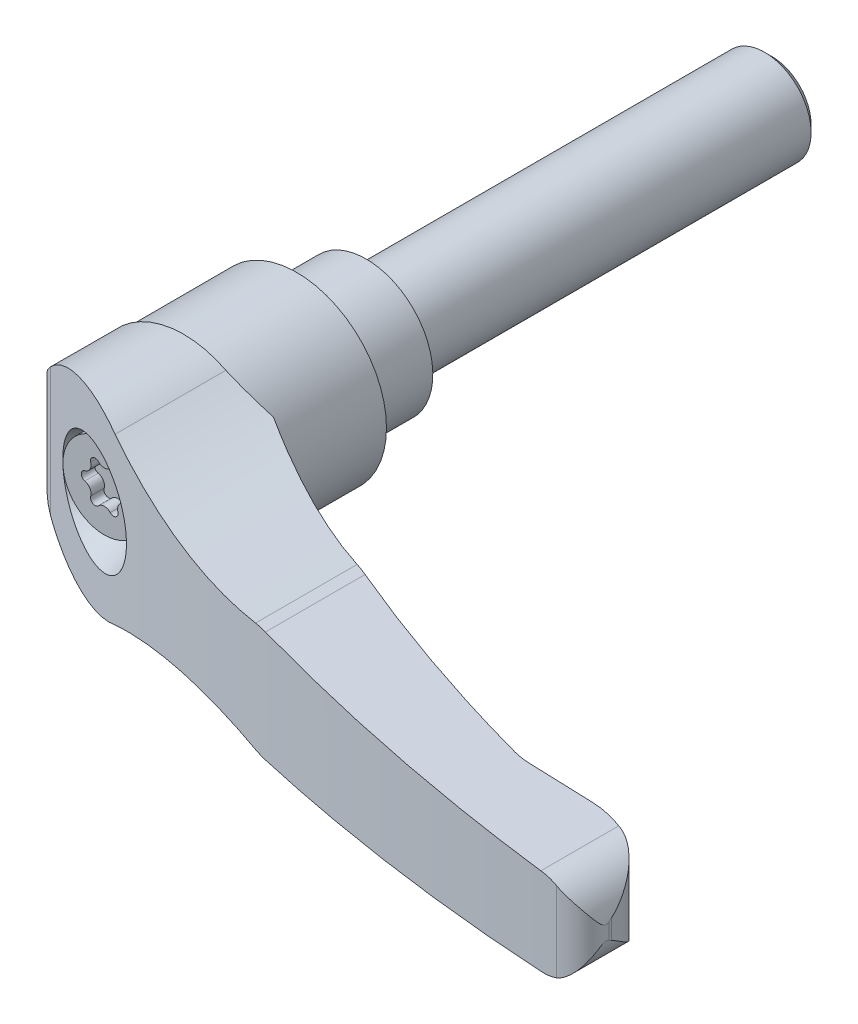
ISO-10303-21;
HEADER;
FILE_DESCRIPTION(('STEP AP214'),'2;1');
FILE_NAME('part.step','',(''),(''),'','','');
FILE_SCHEMA(('AUTOMOTIVE_DESIGN { 1 0 10303 214 1 1 1 1 }'));
ENDSEC;
DATA;
#1=APPLICATION_CONTEXT('core data for automotive mechanical design processes');
#2=APPLICATION_PROTOCOL_DEFINITION('international standard','automotive_design',2000,#1);
#3=PRODUCT_CONTEXT('',#1,'mechanical');
#4=PRODUCT('Part','Part','',(#3));
#5=PRODUCT_RELATED_PRODUCT_CATEGORY('part','',(#4));
#6=PRODUCT_DEFINITION_FORMATION('','',#4);
#7=PRODUCT_DEFINITION_CONTEXT('part definition',#1,'design');
#8=PRODUCT_DEFINITION('design','',#6,#7);
#9=PRODUCT_DEFINITION_SHAPE('','',#8);
#10=(LENGTH_UNIT() NAMED_UNIT(*) SI_UNIT(.MILLI.,.METRE.));
#11=(NAMED_UNIT(*) PLANE_ANGLE_UNIT() SI_UNIT($,.RADIAN.));
#12=(NAMED_UNIT(*) SI_UNIT($,.STERADIAN.) SOLID_ANGLE_UNIT());
#13=UNCERTAINTY_MEASURE_WITH_UNIT(LENGTH_MEASURE(1.E-05),#10,'distance_accuracy_value','');
#14=(GEOMETRIC_REPRESENTATION_CONTEXT(3) GLOBAL_UNCERTAINTY_ASSIGNED_CONTEXT((#13)) GLOBAL_UNIT_ASSIGNED_CONTEXT((#10,
#11,#12)) REPRESENTATION_CONTEXT('',''));
#15=CARTESIAN_POINT('',(0.,0.,0.));
#16=DIRECTION('',(0.,0.,1.));
#17=DIRECTION('',(1.,0.,0.));
#18=AXIS2_PLACEMENT_3D('',#15,#16,#17);
#19=CARTESIAN_POINT('',(0.,0.,12.));
#20=DIRECTION('',(0.,0.,1.));
#21=DIRECTION('',(0.,-1.,0.));
#22=AXIS2_PLACEMENT_3D('',#19,#20,#21);
#23=CYLINDRICAL_SURFACE('',#22,11.5);
#24=CARTESIAN_POINT('',(0.,0.,0.));
#25=DIRECTION('',(0.,0.,1.));
#26=DIRECTION('',(0.,-1.,0.));
#27=AXIS2_PLACEMENT_3D('',#24,#25,#26);
#28=CIRCLE('',#27,11.5);
#29=CARTESIAN_POINT('',(0.,-11.5,0.));
#30=VERTEX_POINT('',#29);
#31=EDGE_CURVE('E630',#30,#30,#28,.T.);
#32=ORIENTED_EDGE('',*,*,#31,.T.);
#33=EDGE_LOOP('',(#32));
#34=FACE_BOUND('',#33,.T.);
#35=CARTESIAN_POINT('',(11.057512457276,3.15933826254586,12.7596148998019));
#36=CARTESIAN_POINT('',(10.9793452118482,3.43293898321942,12.7595468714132));
#37=CARTESIAN_POINT('',(10.89103258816,3.7035655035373,12.7594700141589));
#38=CARTESIAN_POINT('',(10.6945696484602,4.23757900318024,12.7592990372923));
#39=CARTESIAN_POINT('',(10.5864181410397,4.50096554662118,12.7592049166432));
#40=CARTESIAN_POINT('',(10.3508010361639,5.01916329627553,12.7589998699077));
#41=CARTESIAN_POINT('',(10.223322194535,5.27396847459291,12.7588889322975));
#42=CARTESIAN_POINT('',(9.94980531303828,5.77342608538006,12.7586509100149));
#43=CARTESIAN_POINT('',(9.80376629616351,6.01807798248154,12.7585238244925));
#44=CARTESIAN_POINT('',(9.47296532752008,6.52820018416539,12.7582359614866));
#45=CARTESIAN_POINT('',(9.28563751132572,6.79201176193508,12.7580729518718));
#46=CARTESIAN_POINT('',(8.88941417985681,7.30293399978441,12.7577281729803));
#47=CARTESIAN_POINT('',(8.68051666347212,7.55004310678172,12.757546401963));
#48=CARTESIAN_POINT('',(8.24260543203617,8.02583370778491,12.7571653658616));
#49=CARTESIAN_POINT('',(8.01358791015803,8.25451169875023,12.7569660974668));
#50=CARTESIAN_POINT('',(7.53710483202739,8.69175500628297,12.7565515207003));
#51=CARTESIAN_POINT('',(7.28963958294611,8.90032065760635,12.7563362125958));
#52=CARTESIAN_POINT('',(6.77803795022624,9.29584511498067,12.7558911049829));
#53=CARTESIAN_POINT('',(6.51390293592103,9.48280569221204,12.755661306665));
#54=CARTESIAN_POINT('',(5.9708200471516,9.83381130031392,12.7551888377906));
#55=CARTESIAN_POINT('',(5.69187209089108,9.99785620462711,12.7549461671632));
#56=CARTESIAN_POINT('',(5.12116330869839,10.3018547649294,12.7544496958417));
#57=CARTESIAN_POINT('',(4.82940317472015,10.4418097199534,12.7541958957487));
#58=CARTESIAN_POINT('',(4.23513054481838,10.6966440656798,12.7536789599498));
#59=CARTESIAN_POINT('',(3.932618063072,10.8115234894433,12.7534158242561));
#60=CARTESIAN_POINT('',(3.31898423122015,11.0153925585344,12.7528820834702));
#61=CARTESIAN_POINT('',(3.00786269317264,11.1043816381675,12.7526114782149));
#62=CARTESIAN_POINT('',(2.37922884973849,11.2558340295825,12.7520647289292));
#63=CARTESIAN_POINT('',(2.06171654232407,11.3182973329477,12.7517885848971));
#64=CARTESIAN_POINT('',(1.42255543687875,11.4162545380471,12.7512327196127));
#65=CARTESIAN_POINT('',(1.10090659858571,11.4517481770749,12.7509529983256));
#66=CARTESIAN_POINT('',(0.455762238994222,11.4955127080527,12.7503919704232));
#67=CARTESIAN_POINT('',(0.132266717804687,11.5037836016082,12.7501106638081));
#68=CARTESIAN_POINT('',(-0.514269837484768,11.4930438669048,12.7495484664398));
#69=CARTESIAN_POINT('',(-0.83731087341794,11.4740333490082,12.749267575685));
#70=CARTESIAN_POINT('',(-1.48064314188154,11.4088661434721,12.7487082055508));
#71=CARTESIAN_POINT('',(-1.80093437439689,11.3627094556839,12.7484297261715));
#72=CARTESIAN_POINT('',(-2.43648954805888,11.2435781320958,12.7478771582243));
#73=CARTESIAN_POINT('',(-2.75175349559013,11.1706035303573,12.747603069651));
#74=CARTESIAN_POINT('',(-3.375013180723,10.9983551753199,12.7470612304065));
#75=CARTESIAN_POINT('',(-3.68300891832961,10.8990814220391,12.7467934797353));
#76=CARTESIAN_POINT('',(-4.28954272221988,10.6749404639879,12.746266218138));
#77=CARTESIAN_POINT('',(-4.58808078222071,10.550073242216,12.7460067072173));
#78=CARTESIAN_POINT('',(-5.17357658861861,10.2756331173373,12.7454977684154));
#79=CARTESIAN_POINT('',(-5.46053433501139,10.1260602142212,12.7452483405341));
#80=CARTESIAN_POINT('',(-6.02082939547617,9.80327210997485,12.744761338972));
#81=CARTESIAN_POINT('',(-6.29416671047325,9.63005691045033,12.7445237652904));
#82=CARTESIAN_POINT('',(-6.82527766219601,9.26121566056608,12.744062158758));
#83=CARTESIAN_POINT('',(-7.08305129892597,9.06558961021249,12.7438381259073));
#84=CARTESIAN_POINT('',(-7.58120221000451,8.65331749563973,12.7434051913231));
#85=CARTESIAN_POINT('',(-7.8215794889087,8.43667143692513,12.7431962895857));
#86=CARTESIAN_POINT('',(-8.28322881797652,7.98389948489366,12.7427950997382));
#87=CARTESIAN_POINT('',(-8.50450086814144,7.74777359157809,12.7426028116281));
#88=CARTESIAN_POINT('',(-8.92636665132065,7.2577206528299,12.7422362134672));
#89=CARTESIAN_POINT('',(-9.12696038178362,7.00379360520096,12.7420619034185));
#90=CARTESIAN_POINT('',(-9.50604338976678,6.4799436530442,12.7417324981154));
#91=CARTESIAN_POINT('',(-9.6845326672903,6.2100207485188,12.7415774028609));
#92=CARTESIAN_POINT('',(-10.0181377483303,5.6560981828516,12.7412875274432));
#93=CARTESIAN_POINT('',(-10.1732535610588,5.37209852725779,12.7411527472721));
#94=CARTESIAN_POINT('',(-10.4590090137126,4.79204142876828,12.7409044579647));
#95=CARTESIAN_POINT('',(-10.5896486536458,4.49598398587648,12.7407909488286));
#96=CARTESIAN_POINT('',(-10.8255229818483,3.8939161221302,12.7405860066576));
#97=CARTESIAN_POINT('',(-10.9307576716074,3.58790570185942,12.7404945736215));
#98=CARTESIAN_POINT('',(-11.1150739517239,2.96810741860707,12.7403344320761));
#99=CARTESIAN_POINT('',(-11.1941555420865,2.65431955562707,12.7402657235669));
#100=CARTESIAN_POINT('',(-11.3256033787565,2.02119732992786,12.740151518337));
#101=CARTESIAN_POINT('',(-11.3779696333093,1.70186296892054,12.740106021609));
#102=CARTESIAN_POINT('',(-11.4556145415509,1.05991792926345,12.7400385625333));
#103=CARTESIAN_POINT('',(-11.4808931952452,0.737307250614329,12.7400166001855));
#104=CARTESIAN_POINT('',(-11.5041831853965,0.0911031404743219,12.7399963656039));
#105=CARTESIAN_POINT('',(-11.5021945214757,-0.232490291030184,12.7399980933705));
#106=CARTESIAN_POINT('',(-11.4709640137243,-0.87835934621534,12.7400252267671));
#107=CARTESIAN_POINT('',(-11.4417221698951,-1.20063496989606,12.7400506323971));
#108=CARTESIAN_POINT('',(-11.3561932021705,-1.84157716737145,12.7401249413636));
#109=CARTESIAN_POINT('',(-11.2999060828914,-2.16024374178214,12.740173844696));
#110=CARTESIAN_POINT('',(-11.1606867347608,-2.79170236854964,12.7402948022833));
#111=CARTESIAN_POINT('',(-11.0777545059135,-3.10449442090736,12.7403668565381));
#112=CARTESIAN_POINT('',(-10.8858345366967,-3.72198024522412,12.7405336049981));
#113=CARTESIAN_POINT('',(-10.7768467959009,-4.02667401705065,12.7406282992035));
#114=CARTESIAN_POINT('',(-10.5335906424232,-4.62579708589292,12.7408396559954));
#115=CARTESIAN_POINT('',(-10.399322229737,-4.92022638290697,12.7409563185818));
#116=CARTESIAN_POINT('',(-10.1064592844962,-5.49672732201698,12.7412107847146));
#117=CARTESIAN_POINT('',(-9.94786474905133,-5.7787989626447,12.7413485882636));
#118=CARTESIAN_POINT('',(-9.60747708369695,-6.32857919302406,12.741644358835));
#119=CARTESIAN_POINT('',(-9.42568395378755,-6.59628778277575,12.7418023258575));
#120=CARTESIAN_POINT('',(-9.04019155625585,-7.11543864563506,12.7421373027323));
#121=CARTESIAN_POINT('',(-8.83649229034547,-7.36688092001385,12.7423143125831));
#122=CARTESIAN_POINT('',(-8.40863578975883,-7.85171157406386,12.7426861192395));
#123=CARTESIAN_POINT('',(-8.18447855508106,-8.08509995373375,12.742880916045));
#124=CARTESIAN_POINT('',(-7.71729969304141,-8.53216361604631,12.7432869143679));
#125=CARTESIAN_POINT('',(-7.47427806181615,-8.74583889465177,12.7434981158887));
#126=CARTESIAN_POINT('',(-6.97109818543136,-9.15195720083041,12.7439354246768));
#127=CARTESIAN_POINT('',(-6.71093994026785,-9.34440022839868,12.7441615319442));
#128=CARTESIAN_POINT('',(-6.17533633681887,-9.70668592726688,12.7446270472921));
#129=CARTESIAN_POINT('',(-5.89989097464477,-9.87652859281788,12.7448664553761));
#130=CARTESIAN_POINT('',(-5.33567144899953,-10.1924060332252,12.7453568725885));
#131=CARTESIAN_POINT('',(-5.04689728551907,-10.3384408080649,12.7456078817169));
#132=CARTESIAN_POINT('',(-4.45807299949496,-10.6056643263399,12.7461197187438));
#133=CARTESIAN_POINT('',(-4.1580228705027,-10.7268530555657,12.7463805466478));
#134=CARTESIAN_POINT('',(-3.54877998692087,-10.9435227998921,12.746910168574));
#135=CARTESIAN_POINT('',(-3.23958723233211,-11.039003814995,12.7471789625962));
#136=CARTESIAN_POINT('',(-2.61425747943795,-11.2035792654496,12.7477226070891));
#137=CARTESIAN_POINT('',(-2.29812048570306,-11.2726737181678,12.7479974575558));
#138=CARTESIAN_POINT('',(-1.66114959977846,-11.3839849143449,12.7485512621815));
#139=CARTESIAN_POINT('',(-1.34031570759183,-11.4262016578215,12.7488302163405));
#140=CARTESIAN_POINT('',(-0.696231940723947,-11.4834573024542,12.7493902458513));
#141=CARTESIAN_POINT('',(-0.372982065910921,-11.498496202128,12.7496713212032));
#142=CARTESIAN_POINT('',(0.273635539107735,-11.5012892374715,12.750233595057));
#143=CARTESIAN_POINT('',(0.597003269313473,-11.4890433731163,12.7505147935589));
#144=CARTESIAN_POINT('',(1.24155799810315,-11.437353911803,12.7510753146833));
#145=CARTESIAN_POINT('',(1.56274499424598,-11.3979102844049,12.7513546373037));
#146=CARTESIAN_POINT('',(2.20065443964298,-11.2921056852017,12.7519094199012));
#147=CARTESIAN_POINT('',(2.51737688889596,-11.2257447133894,12.7521848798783));
#148=CARTESIAN_POINT('',(3.14410517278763,-11.066577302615,12.7527299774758));
#149=CARTESIAN_POINT('',(3.45411101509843,-10.9737708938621,12.7529996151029));
#150=CARTESIAN_POINT('',(4.06520250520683,-10.7623723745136,12.7535311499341));
#151=CARTESIAN_POINT('',(4.3662881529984,-10.6437802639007,12.7537930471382));
#152=CARTESIAN_POINT('',(4.95739910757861,-10.3816532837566,12.754307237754));
#153=CARTESIAN_POINT('',(5.24742439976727,-10.2381183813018,12.7545595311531));
#154=CARTESIAN_POINT('',(5.81435230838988,-9.92712637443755,12.7550527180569));
#155=CARTESIAN_POINT('',(6.09125492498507,-9.75966927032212,12.7552936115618));
#156=CARTESIAN_POINT('',(6.62997198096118,-9.40202131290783,12.7557622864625));
#157=CARTESIAN_POINT('',(6.89178624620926,-9.2118301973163,12.7559900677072));
#158=CARTESIAN_POINT('',(7.39846178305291,-8.81006790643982,12.7564308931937));
#159=CARTESIAN_POINT('',(7.64332305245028,-8.59849672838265,12.7566439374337));
#160=CARTESIAN_POINT('',(8.11434590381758,-8.15548396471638,12.7570537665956));
#161=CARTESIAN_POINT('',(8.34050794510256,-7.92404286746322,12.7572505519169));
#162=CARTESIAN_POINT('',(8.77253106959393,-7.44293132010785,12.7576264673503));
#163=CARTESIAN_POINT('',(8.9783921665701,-7.19326088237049,12.7578055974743));
#164=CARTESIAN_POINT('',(9.36833693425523,-6.67748283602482,12.7581449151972));
#165=CARTESIAN_POINT('',(9.55242206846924,-6.41137633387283,12.758305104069));
#166=CARTESIAN_POINT('',(9.89752289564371,-5.86460187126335,12.7586054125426));
#167=CARTESIAN_POINT('',(10.0585385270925,-5.58393387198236,12.7587455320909));
#168=CARTESIAN_POINT('',(10.3563791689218,-5.00998586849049,12.7590047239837));
#169=CARTESIAN_POINT('',(10.4932002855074,-4.71670384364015,12.7591237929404));
#170=CARTESIAN_POINT('',(10.7416459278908,-4.11965888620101,12.7593400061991));
#171=CARTESIAN_POINT('',(10.8532707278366,-3.8158960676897,12.7594371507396));
#172=CARTESIAN_POINT('',(11.0505616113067,-3.1999523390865,12.7596088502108));
#173=CARTESIAN_POINT('',(11.1362198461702,-2.88776891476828,12.7596833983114));
#174=CARTESIAN_POINT('',(11.2809236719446,-2.25729439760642,12.7598093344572));
#175=CARTESIAN_POINT('',(11.3399690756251,-1.93900326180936,12.7598607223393));
#176=CARTESIAN_POINT('',(11.4309937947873,-1.2987814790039,12.7599399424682));
#177=CARTESIAN_POINT('',(11.4629912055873,-0.976853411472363,12.7599677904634));
#178=CARTESIAN_POINT('',(11.4997633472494,-0.331543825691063,12.7599997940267));
#179=CARTESIAN_POINT('',(11.5045430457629,-0.00816258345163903,12.7600039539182));
#180=CARTESIAN_POINT('',(11.4825110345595,0.795622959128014,12.7599847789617));
#181=CARTESIAN_POINT('',(11.4391488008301,1.27566218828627,12.7599470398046));
#182=CARTESIAN_POINT('',(11.2926682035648,2.22640801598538,12.7598195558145));
#183=CARTESIAN_POINT('',(11.1895681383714,2.69711742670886,12.7597298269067));
#184=CARTESIAN_POINT('',(11.057512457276,3.15933826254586,12.7596148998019));
#185=B_SPLINE_CURVE_WITH_KNOTS('',3,(#35,#36,#37,#38,#39,#40,#41,#42,#43,#44,#45,#46,#47,#48,
#49,#50,#51,#52,#53,#54,#55,#56,#57,#58,#59,#60,#61,#62,#63,#64,#65,#66,#67,#68,#69,#70,#71,#72,
#73,#74,#75,#76,#77,#78,#79,#80,#81,#82,#83,#84,#85,#86,#87,#88,#89,#90,#91,#92,#93,#94,#95,#96,
#97,#98,#99,#100,#101,#102,#103,#104,#105,#106,#107,#108,#109,#110,#111,#112,#113,#114,#115,
#116,#117,#118,#119,#120,#121,#122,#123,#124,#125,#126,#127,#128,#129,#130,#131,#132,#133,#134,
#135,#136,#137,#138,#139,#140,#141,#142,#143,#144,#145,#146,#147,#148,#149,#150,#151,#152,#153,
#154,#155,#156,#157,#158,#159,#160,#161,#162,#163,#164,#165,#166,#167,#168,#169,#170,#171,#172,
#173,#174,#175,#176,#177,#178,#179,#180,#181,#182,#183,#184),.UNSPECIFIED.,.T.,.F.,(4,2,2,2,2,2,
2,2,2,2,2,2,2,2,2,2,2,2,2,2,2,2,2,2,2,2,2,2,2,2,2,2,2,2,2,2,2,2,2,2,2,2,2,2,2,2,2,2,2,2,2,2,2,2,
2,2,2,2,2,2,2,2,2,2,2,2,2,2,2,2,2,2,2,2,4),(0.,0.853321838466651,1.70669493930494,
2.56065548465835,3.41466100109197,4.38415393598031,5.35373689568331,6.32350370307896,
7.29325436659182,8.26292547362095,9.23260193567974,10.202226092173,11.1718489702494,
12.1414930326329,13.1111374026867,14.0807912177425,15.0504449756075,16.0200948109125,
16.989744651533,17.9593932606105,18.9290418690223,19.8986911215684,20.8683403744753,
21.8379895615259,22.8076387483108,23.7772876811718,24.7469366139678,25.7165856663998,
26.6862347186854,27.6558833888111,28.6255320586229,29.5951806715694,30.5648292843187,
31.5344775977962,32.504125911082,33.4737742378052,34.4434225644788,35.4130707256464,
36.3827188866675,37.3523670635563,38.3220152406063,39.2916635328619,40.261311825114,
41.2309600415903,42.200608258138,43.1702566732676,44.1399050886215,45.1095537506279,
46.0792024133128,47.0488516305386,48.0185008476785,48.9881494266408,49.9577980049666,
50.9274466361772,51.8970952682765,52.8667449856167,53.8363947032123,54.8060433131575,
55.7756919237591,56.7453418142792,57.7149916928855,58.6846527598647,59.6543139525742,
60.6239513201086,61.5935880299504,62.5631595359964,63.5327336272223,64.5024636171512,
65.4721830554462,66.4421953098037,67.4122143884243,68.3815840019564,69.3507766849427,
70.7928193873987,72.2344206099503),.UNSPECIFIED.);
#186=CARTESIAN_POINT('',(0.00500000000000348,11.4999989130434,12.75));
#187=VERTEX_POINT('',#186);
#188=CARTESIAN_POINT('',(0.00500000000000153,-11.4999989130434,12.75));
#189=VERTEX_POINT('',#188);
#190=EDGE_CURVE('E513',#187,#189,#185,.T.);
#191=ORIENTED_EDGE('',*,*,#190,.F.);
#192=CARTESIAN_POINT('',(0.,0.,12.75));
#193=DIRECTION('',(0.,0.,1.));
#194=DIRECTION('',(1.,0.,0.));
#195=AXIS2_PLACEMENT_3D('',#192,#193,#194);
#196=CIRCLE('',#195,11.5);
#197=EDGE_CURVE('E9',#187,#189,#196,.F.);
#198=ORIENTED_EDGE('',*,*,#197,.T.);
#199=EDGE_LOOP('',(#191,#198));
#200=FACE_BOUND('',#199,.T.);
#201=ADVANCED_FACE('F14',(#34,#200),#23,.T.);
#202=CARTESIAN_POINT('',(-1.58999999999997,2.75396078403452,49.24));
#203=DIRECTION('',(0.,0.,-1.));
#204=DIRECTION('',(0.,1.,0.));
#205=AXIS2_PLACEMENT_3D('',#202,#203,#204);
#206=CYLINDRICAL_SURFACE('',#205,0.794999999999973);
#207=CARTESIAN_POINT('',(-1.58999999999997,2.75396078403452,42.87));
#208=DIRECTION('',(0.,0.,-1.));
#209=DIRECTION('',(0.,1.,0.));
#210=AXIS2_PLACEMENT_3D('',#207,#208,#209);
#211=CIRCLE('',#210,0.794999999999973);
#212=CARTESIAN_POINT('',(-1.0118181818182,3.2996079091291,42.87));
#213=VERTEX_POINT('',#212);
#214=CARTESIAN_POINT('',(-2.3516351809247,2.5260642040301,42.87));
#215=VERTEX_POINT('',#214);
#216=EDGE_CURVE('E590',#213,#215,#211,.F.);
#217=ORIENTED_EDGE('',*,*,#216,.F.);
#218=DIRECTION('',(0.,0.,-1.));
#219=VECTOR('',#218,1.);
#220=CARTESIAN_POINT('',(-1.0118181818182,3.2996079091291,49.24));
#221=LINE('',#220,#219);
#222=CARTESIAN_POINT('',(-1.0118181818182,3.2996079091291,45.19));
#223=VERTEX_POINT('',#222);
#224=EDGE_CURVE('E83',#223,#213,#221,.T.);
#225=ORIENTED_EDGE('',*,*,#224,.F.);
#226=CARTESIAN_POINT('',(-1.58999999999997,2.75396078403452,45.19));
#227=DIRECTION('',(0.,0.,1.));
#228=DIRECTION('',(0.,-1.,0.));
#229=AXIS2_PLACEMENT_3D('',#226,#227,#228);
#230=CIRCLE('',#229,0.794999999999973);
#231=CARTESIAN_POINT('',(-2.3516351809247,2.5260642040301,45.19));
#232=VERTEX_POINT('',#231);
#233=EDGE_CURVE('E593',#232,#223,#230,.F.);
#234=ORIENTED_EDGE('',*,*,#233,.F.);
#235=DIRECTION('',(0.,0.,-1.));
#236=VECTOR('',#235,1.);
#237=CARTESIAN_POINT('',(-2.3516351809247,2.5260642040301,49.24));
#238=LINE('',#237,#236);
#239=EDGE_CURVE('E527',#232,#215,#238,.T.);
#240=ORIENTED_EDGE('',*,*,#239,.T.);
#241=EDGE_LOOP('',(#217,#225,#234,#240));
#242=FACE_BOUND('',#241,.T.);
#243=ADVANCED_FACE('F496',(#242),#206,.F.);
#244=CARTESIAN_POINT('',(1.59,2.75396078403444,49.24));
#245=DIRECTION('',(0.,0.,-1.));
#246=DIRECTION('',(0.,1.,0.));
#247=AXIS2_PLACEMENT_3D('',#244,#245,#246);
#248=CYLINDRICAL_SURFACE('',#247,0.795000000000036);
#249=DIRECTION('',(0.,0.,-1.));
#250=VECTOR('',#249,1.);
#251=CARTESIAN_POINT('',(1.0118181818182,3.2996079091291,49.24));
#252=LINE('',#251,#250);
#253=CARTESIAN_POINT('',(1.0118181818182,3.2996079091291,45.19));
#254=VERTEX_POINT('',#253);
#255=CARTESIAN_POINT('',(1.01181818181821,3.29960790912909,42.87));
#256=VERTEX_POINT('',#255);
#257=EDGE_CURVE('E569',#254,#256,#252,.T.);
#258=ORIENTED_EDGE('',*,*,#257,.T.);
#259=CARTESIAN_POINT('',(1.59,2.75396078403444,42.87));
#260=DIRECTION('',(0.,0.,-1.));
#261=DIRECTION('',(0.,1.,0.));
#262=AXIS2_PLACEMENT_3D('',#259,#260,#261);
#263=CIRCLE('',#262,0.795000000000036);
#264=CARTESIAN_POINT('',(2.3516351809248,2.5260642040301,42.87));
#265=VERTEX_POINT('',#264);
#266=EDGE_CURVE('E596',#265,#256,#263,.F.);
#267=ORIENTED_EDGE('',*,*,#266,.F.);
#268=DIRECTION('',(0.,0.,-1.));
#269=VECTOR('',#268,1.);
#270=CARTESIAN_POINT('',(2.3516351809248,2.5260642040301,49.24));
#271=LINE('',#270,#269);
#272=CARTESIAN_POINT('',(2.3516351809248,2.5260642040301,45.19));
#273=VERTEX_POINT('',#272);
#274=EDGE_CURVE('E556',#273,#265,#271,.T.);
#275=ORIENTED_EDGE('',*,*,#274,.F.);
#276=CARTESIAN_POINT('',(1.59,2.75396078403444,45.19));
#277=DIRECTION('',(0.,0.,1.));
#278=DIRECTION('',(0.,-1.,0.));
#279=AXIS2_PLACEMENT_3D('',#276,#277,#278);
#280=CIRCLE('',#279,0.795000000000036);
#281=EDGE_CURVE('E598',#254,#273,#280,.F.);
#282=ORIENTED_EDGE('',*,*,#281,.F.);
#283=EDGE_LOOP('',(#258,#267,#275,#282));
#284=FACE_BOUND('',#283,.T.);
#285=ADVANCED_FACE('F502',(#284),#248,.F.);
#286=CARTESIAN_POINT('',(3.18,0.,49.24));
#287=DIRECTION('',(0.,0.,-1.));
#288=DIRECTION('',(0.,1.,0.));
#289=AXIS2_PLACEMENT_3D('',#286,#287,#288);
#290=CYLINDRICAL_SURFACE('',#289,0.795);
#291=DIRECTION('',(0.,0.,-1.));
#292=VECTOR('',#291,1.);
#293=CARTESIAN_POINT('',(3.3634533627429,0.77354370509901,49.24));
#294=LINE('',#293,#292);
#295=CARTESIAN_POINT('',(3.3634533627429,0.77354370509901,45.19));
#296=VERTEX_POINT('',#295);
#297=CARTESIAN_POINT('',(3.3634533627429,0.77354370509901,42.87));
#298=VERTEX_POINT('',#297);
#299=EDGE_CURVE('E552',#296,#298,#294,.T.);
#300=ORIENTED_EDGE('',*,*,#299,.T.);
#301=CARTESIAN_POINT('',(3.18,0.,42.87));
#302=DIRECTION('',(0.,0.,-1.));
#303=DIRECTION('',(0.,1.,0.));
#304=AXIS2_PLACEMENT_3D('',#301,#302,#303);
#305=CIRCLE('',#304,0.795);
#306=CARTESIAN_POINT('',(3.3634533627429,-0.773543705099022,42.87));
#307=VERTEX_POINT('',#306);
#308=EDGE_CURVE('E29',#307,#298,#305,.F.);
#309=ORIENTED_EDGE('',*,*,#308,.F.);
#310=DIRECTION('',(0.,0.,-1.));
#311=VECTOR('',#310,1.);
#312=CARTESIAN_POINT('',(3.3634533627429,-0.77354370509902,49.24));
#313=LINE('',#312,#311);
#314=CARTESIAN_POINT('',(3.3634533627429,-0.77354370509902,45.19));
#315=VERTEX_POINT('',#314);
#316=EDGE_CURVE('E564',#315,#307,#313,.T.);
#317=ORIENTED_EDGE('',*,*,#316,.F.);
#318=CARTESIAN_POINT('',(3.18,0.,45.19));
#319=DIRECTION('',(0.,0.,1.));
#320=DIRECTION('',(0.,-1.,0.));
#321=AXIS2_PLACEMENT_3D('',#318,#319,#320);
#322=CIRCLE('',#321,0.795);
#323=EDGE_CURVE('E563',#296,#315,#322,.F.);
#324=ORIENTED_EDGE('',*,*,#323,.F.);
#325=EDGE_LOOP('',(#300,#309,#317,#324));
#326=FACE_BOUND('',#325,.T.);
#327=ADVANCED_FACE('F559',(#326),#290,.F.);
#328=CARTESIAN_POINT('',(1.58999999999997,-2.75396078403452,49.24));
#329=DIRECTION('',(0.,0.,-1.));
#330=DIRECTION('',(0.,1.,0.));
#331=AXIS2_PLACEMENT_3D('',#328,#329,#330);
#332=CYLINDRICAL_SURFACE('',#331,0.794999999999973);
#333=DIRECTION('',(0.,0.,-1.));
#334=VECTOR('',#333,1.);
#335=CARTESIAN_POINT('',(2.3516351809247,-2.5260642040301,49.24));
#336=LINE('',#335,#334);
#337=CARTESIAN_POINT('',(2.3516351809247,-2.5260642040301,45.19));
#338=VERTEX_POINT('',#337);
#339=CARTESIAN_POINT('',(2.3516351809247,-2.5260642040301,42.87));
#340=VERTEX_POINT('',#339);
#341=EDGE_CURVE('E567',#338,#340,#336,.T.);
#342=ORIENTED_EDGE('',*,*,#341,.T.);
#343=CARTESIAN_POINT('',(1.58999999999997,-2.75396078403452,42.87));
#344=DIRECTION('',(0.,0.,-1.));
#345=DIRECTION('',(0.,1.,0.));
#346=AXIS2_PLACEMENT_3D('',#343,#344,#345);
#347=CIRCLE('',#346,0.794999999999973);
#348=CARTESIAN_POINT('',(1.0118181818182,-3.2996079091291,42.87));
#349=VERTEX_POINT('',#348);
#350=EDGE_CURVE('E603',#349,#340,#347,.F.);
#351=ORIENTED_EDGE('',*,*,#350,.F.);
#352=DIRECTION('',(0.,0.,-1.));
#353=VECTOR('',#352,1.);
#354=CARTESIAN_POINT('',(1.0118181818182,-3.2996079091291,49.24));
#355=LINE('',#354,#353);
#356=CARTESIAN_POINT('',(1.0118181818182,-3.2996079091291,45.19));
#357=VERTEX_POINT('',#356);
#358=EDGE_CURVE('E575',#357,#349,#355,.T.);
#359=ORIENTED_EDGE('',*,*,#358,.F.);
#360=CARTESIAN_POINT('',(1.58999999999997,-2.75396078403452,45.19));
#361=DIRECTION('',(0.,0.,1.));
#362=DIRECTION('',(0.,-1.,0.));
#363=AXIS2_PLACEMENT_3D('',#360,#361,#362);
#364=CIRCLE('',#363,0.794999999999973);
#365=EDGE_CURVE('E606',#338,#357,#364,.F.);
#366=ORIENTED_EDGE('',*,*,#365,.F.);
#367=EDGE_LOOP('',(#342,#351,#359,#366));
#368=FACE_BOUND('',#367,.T.);
#369=ADVANCED_FACE('F986',(#368),#332,.F.);
#370=CARTESIAN_POINT('',(-1.59,-2.75396078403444,49.24));
#371=DIRECTION('',(0.,0.,-1.));
#372=DIRECTION('',(0.,1.,0.));
#373=AXIS2_PLACEMENT_3D('',#370,#371,#372);
#374=CYLINDRICAL_SURFACE('',#373,0.795000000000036);
#375=DIRECTION('',(0.,0.,-1.));
#376=VECTOR('',#375,1.);
#377=CARTESIAN_POINT('',(-1.0118181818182,-3.2996079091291,49.24));
#378=LINE('',#377,#376);
#379=CARTESIAN_POINT('',(-1.0118181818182,-3.2996079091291,45.19));
#380=VERTEX_POINT('',#379);
#381=CARTESIAN_POINT('',(-1.01181818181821,-3.29960790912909,42.87));
#382=VERTEX_POINT('',#381);
#383=EDGE_CURVE('E578',#380,#382,#378,.T.);
#384=ORIENTED_EDGE('',*,*,#383,.T.);
#385=CARTESIAN_POINT('',(-1.59,-2.75396078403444,42.87));
#386=DIRECTION('',(0.,0.,-1.));
#387=DIRECTION('',(0.,1.,0.));
#388=AXIS2_PLACEMENT_3D('',#385,#386,#387);
#389=CIRCLE('',#388,0.795000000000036);
#390=CARTESIAN_POINT('',(-2.3516351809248,-2.5260642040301,42.87));
#391=VERTEX_POINT('',#390);
#392=EDGE_CURVE('E609',#391,#382,#389,.F.);
#393=ORIENTED_EDGE('',*,*,#392,.F.);
#394=DIRECTION('',(0.,0.,-1.));
#395=VECTOR('',#394,1.);
#396=CARTESIAN_POINT('',(-2.3516351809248,-2.5260642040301,49.24));
#397=LINE('',#396,#395);
#398=CARTESIAN_POINT('',(-2.3516351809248,-2.5260642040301,45.19));
#399=VERTEX_POINT('',#398);
#400=EDGE_CURVE('E581',#399,#391,#397,.T.);
#401=ORIENTED_EDGE('',*,*,#400,.F.);
#402=CARTESIAN_POINT('',(-1.59,-2.75396078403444,45.19));
#403=DIRECTION('',(0.,0.,1.));
#404=DIRECTION('',(0.,-1.,0.));
#405=AXIS2_PLACEMENT_3D('',#402,#403,#404);
#406=CIRCLE('',#405,0.795000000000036);
#407=EDGE_CURVE('E612',#380,#399,#406,.F.);
#408=ORIENTED_EDGE('',*,*,#407,.F.);
#409=EDGE_LOOP('',(#384,#393,#401,#408));
#410=FACE_BOUND('',#409,.T.);
#411=ADVANCED_FACE('F978',(#410),#374,.F.);
#412=CARTESIAN_POINT('',(-3.18,0.,49.24));
#413=DIRECTION('',(0.,0.,-1.));
#414=DIRECTION('',(0.,1.,0.));
#415=AXIS2_PLACEMENT_3D('',#412,#413,#414);
#416=CYLINDRICAL_SURFACE('',#415,0.795);
#417=CARTESIAN_POINT('',(-3.18,0.,42.87));
#418=DIRECTION('',(0.,0.,-1.));
#419=DIRECTION('',(0.,1.,0.));
#420=AXIS2_PLACEMENT_3D('',#417,#418,#419);
#421=CIRCLE('',#420,0.795);
#422=CARTESIAN_POINT('',(-3.3634533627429,0.773543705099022,42.87));
#423=VERTEX_POINT('',#422);
#424=CARTESIAN_POINT('',(-3.3634533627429,-0.773543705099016,42.87));
#425=VERTEX_POINT('',#424);
#426=EDGE_CURVE('E615',#423,#425,#421,.F.);
#427=ORIENTED_EDGE('',*,*,#426,.F.);
#428=DIRECTION('',(0.,0.,-1.));
#429=VECTOR('',#428,1.);
#430=CARTESIAN_POINT('',(-3.3634533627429,0.77354370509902,49.24));
#431=LINE('',#430,#429);
#432=CARTESIAN_POINT('',(-3.3634533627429,0.77354370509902,45.19));
#433=VERTEX_POINT('',#432);
#434=EDGE_CURVE('E587',#433,#423,#431,.T.);
#435=ORIENTED_EDGE('',*,*,#434,.F.);
#436=CARTESIAN_POINT('',(-3.18,0.,45.19));
#437=DIRECTION('',(0.,0.,1.));
#438=DIRECTION('',(0.,-1.,0.));
#439=AXIS2_PLACEMENT_3D('',#436,#437,#438);
#440=CIRCLE('',#439,0.795);
#441=CARTESIAN_POINT('',(-3.3634533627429,-0.77354370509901,45.19));
#442=VERTEX_POINT('',#441);
#443=EDGE_CURVE('E618',#442,#433,#440,.F.);
#444=ORIENTED_EDGE('',*,*,#443,.F.);
#445=DIRECTION('',(0.,0.,-1.));
#446=VECTOR('',#445,1.);
#447=CARTESIAN_POINT('',(-3.3634533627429,-0.77354370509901,49.24));
#448=LINE('',#447,#446);
#449=EDGE_CURVE('E584',#442,#425,#448,.T.);
#450=ORIENTED_EDGE('',*,*,#449,.T.);
#451=EDGE_LOOP('',(#427,#435,#444,#450));
#452=FACE_BOUND('',#451,.T.);
#453=ADVANCED_FACE('F970',(#452),#416,.F.);
#454=CARTESIAN_POINT('',(-3.68449674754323,2.12724518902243,49.24));
#455=DIRECTION('',(0.,0.,-1.));
#456=DIRECTION('',(0.,1.,0.));
#457=AXIS2_PLACEMENT_3D('',#454,#455,#456);
#458=CYLINDRICAL_SURFACE('',#457,1.39125000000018);
#459=ORIENTED_EDGE('',*,*,#434,.T.);
#460=CARTESIAN_POINT('',(-3.68449674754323,2.12724518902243,42.87));
#461=DIRECTION('',(0.,0.,-1.));
#462=DIRECTION('',(-1.,0.,0.));
#463=AXIS2_PLACEMENT_3D('',#460,#461,#462);
#464=CIRCLE('',#463,1.39125000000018);
#465=EDGE_CURVE('E659',#423,#215,#464,.F.);
#466=ORIENTED_EDGE('',*,*,#465,.T.);
#467=ORIENTED_EDGE('',*,*,#239,.F.);
#468=CARTESIAN_POINT('',(-3.68449674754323,2.12724518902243,45.19));
#469=DIRECTION('',(0.,0.,1.));
#470=DIRECTION('',(0.,-1.,0.));
#471=AXIS2_PLACEMENT_3D('',#468,#469,#470);
#472=CIRCLE('',#471,1.39125000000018);
#473=EDGE_CURVE('E546',#433,#232,#472,.T.);
#474=ORIENTED_EDGE('',*,*,#473,.F.);
#475=EDGE_LOOP('',(#459,#466,#467,#474));
#476=FACE_BOUND('',#475,.T.);
#477=ADVANCED_FACE('F687',(#476),#458,.T.);
#478=CARTESIAN_POINT('',(0.,4.25449037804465,49.24));
#479=DIRECTION('',(0.,0.,-1.));
#480=DIRECTION('',(0.,1.,0.));
#481=AXIS2_PLACEMENT_3D('',#478,#479,#480);
#482=CYLINDRICAL_SURFACE('',#481,1.39125000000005);
#483=ORIENTED_EDGE('',*,*,#224,.T.);
#484=CARTESIAN_POINT('',(0.,4.25449037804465,42.87));
#485=DIRECTION('',(0.,0.,-1.));
#486=DIRECTION('',(-1.,0.,0.));
#487=AXIS2_PLACEMENT_3D('',#484,#485,#486);
#488=CIRCLE('',#487,1.39125000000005);
#489=EDGE_CURVE('E671',#213,#256,#488,.F.);
#490=ORIENTED_EDGE('',*,*,#489,.T.);
#491=ORIENTED_EDGE('',*,*,#257,.F.);
#492=CARTESIAN_POINT('',(0.,4.25449037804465,45.19));
#493=DIRECTION('',(0.,0.,1.));
#494=DIRECTION('',(0.,-1.,0.));
#495=AXIS2_PLACEMENT_3D('',#492,#493,#494);
#496=CIRCLE('',#495,1.39125000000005);
#497=EDGE_CURVE('E638',#223,#254,#496,.T.);
#498=ORIENTED_EDGE('',*,*,#497,.F.);
#499=EDGE_LOOP('',(#483,#490,#491,#498));
#500=FACE_BOUND('',#499,.T.);
#501=ADVANCED_FACE('F678',(#500),#482,.T.);
#502=CARTESIAN_POINT('',(-3.68449674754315,-2.12724518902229,49.24));
#503=DIRECTION('',(0.,0.,-1.));
#504=DIRECTION('',(0.,1.,0.));
#505=AXIS2_PLACEMENT_3D('',#502,#503,#504);
#506=CYLINDRICAL_SURFACE('',#505,1.39125000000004);
#507=ORIENTED_EDGE('',*,*,#400,.T.);
#508=CARTESIAN_POINT('',(-3.68449674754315,-2.12724518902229,42.87));
#509=DIRECTION('',(0.,0.,-1.));
#510=DIRECTION('',(-1.,0.,0.));
#511=AXIS2_PLACEMENT_3D('',#508,#509,#510);
#512=CIRCLE('',#511,1.39125000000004);
#513=EDGE_CURVE('E668',#391,#425,#512,.F.);
#514=ORIENTED_EDGE('',*,*,#513,.T.);
#515=ORIENTED_EDGE('',*,*,#449,.F.);
#516=CARTESIAN_POINT('',(-3.68449674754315,-2.12724518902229,45.19));
#517=DIRECTION('',(0.,0.,1.));
#518=DIRECTION('',(0.,-1.,0.));
#519=AXIS2_PLACEMENT_3D('',#516,#517,#518);
#520=CIRCLE('',#519,1.39125000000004);
#521=EDGE_CURVE('E648',#399,#442,#520,.T.);
#522=ORIENTED_EDGE('',*,*,#521,.F.);
#523=EDGE_LOOP('',(#507,#514,#515,#522));
#524=FACE_BOUND('',#523,.T.);
#525=ADVANCED_FACE('F946',(#524),#506,.T.);
#526=CARTESIAN_POINT('',(0.,-4.25449037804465,49.24));
#527=DIRECTION('',(0.,0.,-1.));
#528=DIRECTION('',(0.,1.,0.));
#529=AXIS2_PLACEMENT_3D('',#526,#527,#528);
#530=CYLINDRICAL_SURFACE('',#529,1.39125000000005);
#531=ORIENTED_EDGE('',*,*,#358,.T.);
#532=CARTESIAN_POINT('',(0.,-4.25449037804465,42.87));
#533=DIRECTION('',(0.,0.,-1.));
#534=DIRECTION('',(-1.,0.,0.));
#535=AXIS2_PLACEMENT_3D('',#532,#533,#534);
#536=CIRCLE('',#535,1.39125000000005);
#537=EDGE_CURVE('E665',#349,#382,#536,.F.);
#538=ORIENTED_EDGE('',*,*,#537,.T.);
#539=ORIENTED_EDGE('',*,*,#383,.F.);
#540=CARTESIAN_POINT('',(0.,-4.25449037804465,45.19));
#541=DIRECTION('',(0.,0.,1.));
#542=DIRECTION('',(0.,-1.,0.));
#543=AXIS2_PLACEMENT_3D('',#540,#541,#542);
#544=CIRCLE('',#543,1.39125000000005);
#545=EDGE_CURVE('E646',#357,#380,#544,.T.);
#546=ORIENTED_EDGE('',*,*,#545,.F.);
#547=EDGE_LOOP('',(#531,#538,#539,#546));
#548=FACE_BOUND('',#547,.T.);
#549=ADVANCED_FACE('F937',(#548),#530,.T.);
#550=CARTESIAN_POINT('',(3.68449674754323,-2.12724518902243,49.24));
#551=DIRECTION('',(0.,0.,-1.));
#552=DIRECTION('',(0.,1.,0.));
#553=AXIS2_PLACEMENT_3D('',#550,#551,#552);
#554=CYLINDRICAL_SURFACE('',#553,1.39125000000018);
#555=ORIENTED_EDGE('',*,*,#316,.T.);
#556=CARTESIAN_POINT('',(3.68449674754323,-2.12724518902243,42.87));
#557=DIRECTION('',(0.,0.,-1.));
#558=DIRECTION('',(-1.,0.,0.));
#559=AXIS2_PLACEMENT_3D('',#556,#557,#558);
#560=CIRCLE('',#559,1.39125000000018);
#561=EDGE_CURVE('E662',#307,#340,#560,.F.);
#562=ORIENTED_EDGE('',*,*,#561,.T.);
#563=ORIENTED_EDGE('',*,*,#341,.F.);
#564=CARTESIAN_POINT('',(3.68449674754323,-2.12724518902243,45.19));
#565=DIRECTION('',(0.,0.,1.));
#566=DIRECTION('',(0.,-1.,0.));
#567=AXIS2_PLACEMENT_3D('',#564,#565,#566);
#568=CIRCLE('',#567,1.39125000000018);
#569=EDGE_CURVE('E643',#315,#338,#568,.T.);
#570=ORIENTED_EDGE('',*,*,#569,.F.);
#571=EDGE_LOOP('',(#555,#562,#563,#570));
#572=FACE_BOUND('',#571,.T.);
#573=ADVANCED_FACE('F929',(#572),#554,.T.);
#574=CARTESIAN_POINT('',(3.68449674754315,2.12724518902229,49.24));
#575=DIRECTION('',(0.,0.,-1.));
#576=DIRECTION('',(0.,1.,0.));
#577=AXIS2_PLACEMENT_3D('',#574,#575,#576);
#578=CYLINDRICAL_SURFACE('',#577,1.39125000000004);
#579=ORIENTED_EDGE('',*,*,#274,.T.);
#580=CARTESIAN_POINT('',(3.68449674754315,2.12724518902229,42.87));
#581=DIRECTION('',(0.,0.,-1.));
#582=DIRECTION('',(-1.,0.,0.));
#583=AXIS2_PLACEMENT_3D('',#580,#581,#582);
#584=CIRCLE('',#583,1.39125000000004);
#585=EDGE_CURVE('E22',#265,#298,#584,.F.);
#586=ORIENTED_EDGE('',*,*,#585,.T.);
#587=ORIENTED_EDGE('',*,*,#299,.F.);
#588=CARTESIAN_POINT('',(3.68449674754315,2.12724518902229,45.19));
#589=DIRECTION('',(0.,0.,1.));
#590=DIRECTION('',(0.,-1.,0.));
#591=AXIS2_PLACEMENT_3D('',#588,#589,#590);
#592=CIRCLE('',#591,1.39125000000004);
#593=EDGE_CURVE('E641',#273,#296,#592,.T.);
#594=ORIENTED_EDGE('',*,*,#593,.F.);
#595=EDGE_LOOP('',(#579,#586,#587,#594));
#596=FACE_BOUND('',#595,.T.);
#597=ADVANCED_FACE('F533',(#596),#578,.T.);
#598=CARTESIAN_POINT('',(0.0100000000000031,0.,12.75));
#599=DIRECTION('',(0.,0.,-1.));
#600=DIRECTION('',(0.,1.,0.));
#601=AXIS2_PLACEMENT_3D('',#598,#599,#600);
#602=CONICAL_SURFACE('',#601,11.5,0.78539816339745);
#603=CARTESIAN_POINT('',(0.0100000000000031,0.,12.4));
#604=DIRECTION('',(0.,0.,1.));
#605=DIRECTION('',(0.,-1.,0.));
#606=AXIS2_PLACEMENT_3D('',#603,#604,#605);
#607=CIRCLE('',#606,11.85);
#608=CARTESIAN_POINT('',(0.0100000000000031,-11.85,12.4));
#609=VERTEX_POINT('',#608);
#610=EDGE_CURVE('E652',#609,#609,#607,.T.);
#611=ORIENTED_EDGE('',*,*,#610,.F.);
#612=EDGE_LOOP('',(#611));
#613=FACE_BOUND('',#612,.T.);
#614=CARTESIAN_POINT('',(0.0100000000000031,0.,12.75));
#615=DIRECTION('',(0.,0.,1.));
#616=DIRECTION('',(0.,-1.,0.));
#617=AXIS2_PLACEMENT_3D('',#614,#615,#616);
#618=CIRCLE('',#617,11.5);
#619=EDGE_CURVE('E235',#189,#187,#618,.T.);
#620=ORIENTED_EDGE('',*,*,#619,.T.);
#621=ORIENTED_EDGE('',*,*,#190,.T.);
#622=EDGE_LOOP('',(#620,#621));
#623=FACE_BOUND('',#622,.T.);
#624=ADVANCED_FACE('F529',(#613,#623),#602,.F.);
#625=CARTESIAN_POINT('',(0.0100000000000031,0.,12.));
#626=DIRECTION('',(0.,0.,1.));
#627=DIRECTION('',(0.,-1.,0.));
#628=AXIS2_PLACEMENT_3D('',#625,#626,#627);
#629=CYLINDRICAL_SURFACE('',#628,11.85);
#630=CARTESIAN_POINT('',(0.0100000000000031,0.,12.));
#631=DIRECTION('',(0.,0.,-1.));
#632=DIRECTION('',(1.,0.,0.));
#633=AXIS2_PLACEMENT_3D('',#630,#631,#632);
#634=CIRCLE('',#633,11.85);
#635=CARTESIAN_POINT('',(11.86,0.,12.));
#636=VERTEX_POINT('',#635);
#637=EDGE_CURVE('E749',#636,#636,#634,.T.);
#638=ORIENTED_EDGE('',*,*,#637,.T.);
#639=EDGE_LOOP('',(#638));
#640=FACE_BOUND('',#639,.T.);
#641=ORIENTED_EDGE('',*,*,#610,.T.);
#642=EDGE_LOOP('',(#641));
#643=FACE_BOUND('',#642,.T.);
#644=ADVANCED_FACE('F321',(#640,#643),#629,.F.);
#645=CARTESIAN_POINT('',(0.,0.,12.));
#646=DIRECTION('',(0.,0.,-1.));
#647=DIRECTION('',(1.,0.,0.));
#648=AXIS2_PLACEMENT_3D('',#645,#646,#647);
#649=PLANE('',#648);
#650=ORIENTED_EDGE('',*,*,#637,.F.);
#651=EDGE_LOOP('',(#650));
#652=FACE_BOUND('',#651,.T.);
#653=DIRECTION('',(0.,1.,0.));
#654=VECTOR('',#653,1.);
#655=CARTESIAN_POINT('',(-15.250037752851,-32.,12.));
#656=LINE('',#655,#654);
#657=CARTESIAN_POINT('',(-15.250037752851,-2.77242647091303,12.));
#658=VERTEX_POINT('',#657);
#659=CARTESIAN_POINT('',(-15.250037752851,2.77242647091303,12.));
#660=VERTEX_POINT('',#659);
#661=EDGE_CURVE('E91',#658,#660,#656,.T.);
#662=ORIENTED_EDGE('',*,*,#661,.T.);
#663=CARTESIAN_POINT('',(0.,0.,12.));
#664=DIRECTION('',(0.,0.,-1.));
#665=DIRECTION('',(1.,0.,0.));
#666=AXIS2_PLACEMENT_3D('',#663,#664,#665);
#667=CIRCLE('',#666,15.5);
#668=EDGE_CURVE('E223',#660,#658,#667,.T.);
#669=ORIENTED_EDGE('',*,*,#668,.T.);
#670=EDGE_LOOP('',(#662,#669));
#671=FACE_BOUND('',#670,.T.);
#672=ADVANCED_FACE('F233',(#652,#671),#649,.T.);
#673=CARTESIAN_POINT('',(-15.5,-32.,12.249962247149));
#674=DIRECTION('',(0.707106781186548,0.,0.707106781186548));
#675=DIRECTION('',(-0.707106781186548,0.,0.707106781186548));
#676=AXIS2_PLACEMENT_3D('',#673,#674,#675);
#677=PLANE('',#676);
#678=CARTESIAN_POINT('',(0.,0.,-3.250037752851));
#679=DIRECTION('',(0.707106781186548,0.,0.707106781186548));
#680=DIRECTION('',(0.707106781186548,0.,-0.707106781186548));
#681=AXIS2_PLACEMENT_3D('',#678,#679,#680);
#682=ELLIPSE('',#681,21.920310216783,15.5);
#683=EDGE_CURVE('E225',#658,#660,#682,.F.);
#684=ORIENTED_EDGE('',*,*,#683,.T.);
#685=ORIENTED_EDGE('',*,*,#661,.F.);
#686=EDGE_LOOP('',(#684,#685));
#687=FACE_BOUND('',#686,.T.);
#688=ADVANCED_FACE('F230',(#687),#677,.F.);
#689=CARTESIAN_POINT('',(0.,0.,36.6875));
#690=DIRECTION('',(0.,0.,-1.));
#691=DIRECTION('',(1.,0.,0.));
#692=AXIS2_PLACEMENT_3D('',#689,#690,#691);
#693=CYLINDRICAL_SURFACE('',#692,15.5);
#694=CARTESIAN_POINT('',(0.,0.,31.5));
#695=DIRECTION('',(0.,0.,1.));
#696=DIRECTION('',(0.,-1.,0.));
#697=AXIS2_PLACEMENT_3D('',#694,#695,#696);
#698=CIRCLE('',#697,15.5);
#699=CARTESIAN_POINT('',(-15.5,0.,31.5));
#700=VERTEX_POINT('',#699);
#701=CARTESIAN_POINT('',(15.5,0.,31.5));
#702=VERTEX_POINT('',#701);
#703=EDGE_CURVE('E227',#700,#702,#698,.T.);
#704=ORIENTED_EDGE('',*,*,#703,.F.);
#705=EDGE_CURVE('E821',#702,#700,#698,.T.);
#706=ORIENTED_EDGE('',*,*,#705,.F.);
#707=EDGE_LOOP('',(#704,#706));
#708=FACE_BOUND('',#707,.T.);
#709=ORIENTED_EDGE('',*,*,#683,.F.);
#710=ORIENTED_EDGE('',*,*,#668,.F.);
#711=EDGE_LOOP('',(#709,#710));
#712=FACE_BOUND('',#711,.T.);
#713=ADVANCED_FACE('F224',(#708,#712),#693,.T.);
#714=CARTESIAN_POINT('',(0.0100000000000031,0.,61.));
#715=DIRECTION('',(0.,0.,1.));
#716=DIRECTION('',(0.,-1.,0.));
#717=AXIS2_PLACEMENT_3D('',#714,#715,#716);
#718=CONICAL_SURFACE('',#717,13.748780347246,0.349065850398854);
#719=CARTESIAN_POINT('',(0.0100000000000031,0.,42.87));
#720=DIRECTION('',(0.,0.,1.));
#721=DIRECTION('',(0.,-1.,0.));
#722=AXIS2_PLACEMENT_3D('',#719,#720,#721);
#723=CIRCLE('',#722,7.15);
#724=CARTESIAN_POINT('',(0.00500000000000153,-7.14999825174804,42.87));
#725=VERTEX_POINT('',#724);
#726=CARTESIAN_POINT('',(0.00500000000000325,7.14999825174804,42.87));
#727=VERTEX_POINT('',#726);
#728=EDGE_CURVE('E37',#725,#727,#723,.T.);
#729=ORIENTED_EDGE('',*,*,#728,.F.);
#730=CARTESIAN_POINT('',(7.03183954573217,1.29450090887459,42.8429799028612));
#731=CARTESIAN_POINT('',(6.99069549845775,1.51819635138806,42.8431382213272));
#732=CARTESIAN_POINT('',(6.93880997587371,1.73990977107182,42.84333787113));
#733=CARTESIAN_POINT('',(6.81417682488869,2.17740487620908,42.8438174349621));
#734=CARTESIAN_POINT('',(6.74142826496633,2.39318629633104,42.8440973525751));
#735=CARTESIAN_POINT('',(6.5759091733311,2.81627852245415,42.8447342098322));
#736=CARTESIAN_POINT('',(6.48319120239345,3.02360989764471,42.845090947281));
#737=CARTESIAN_POINT('',(6.27848211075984,3.42849783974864,42.8458785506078));
#738=CARTESIAN_POINT('',(6.16649402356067,3.62605593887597,42.8463094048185));
#739=CARTESIAN_POINT('',(5.93806231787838,3.987772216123,42.8471882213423));
#740=CARTESIAN_POINT('',(5.82357805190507,4.1531720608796,42.84762864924));
#741=CARTESIAN_POINT('',(5.5810849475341,4.47374290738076,42.8485614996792));
#742=CARTESIAN_POINT('',(5.45307647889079,4.62891418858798,42.8490539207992));
#743=CARTESIAN_POINT('',(5.18439686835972,4.92797656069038,42.8500874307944));
#744=CARTESIAN_POINT('',(5.04372112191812,5.07186351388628,42.8506285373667));
#745=CARTESIAN_POINT('',(4.75074933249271,5.34727025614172,42.851755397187));
#746=CARTESIAN_POINT('',(4.59845354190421,5.47879031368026,42.8523411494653));
#747=CARTESIAN_POINT('',(4.28315544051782,5.72866354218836,42.8535537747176));
#748=CARTESIAN_POINT('',(4.12014192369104,5.84700257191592,42.8541806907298));
#749=CARTESIAN_POINT('',(3.78471750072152,6.06950687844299,42.8554705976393));
#750=CARTESIAN_POINT('',(3.61230688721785,6.17367259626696,42.8561335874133));
#751=CARTESIAN_POINT('',(3.25969172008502,6.36688701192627,42.857489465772));
#752=CARTESIAN_POINT('',(3.07950417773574,6.45596679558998,42.8581822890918));
#753=CARTESIAN_POINT('',(2.71234774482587,6.61860590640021,42.8595939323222));
#754=CARTESIAN_POINT('',(2.52538292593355,6.69217437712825,42.8603127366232));
#755=CARTESIAN_POINT('',(2.26625144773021,6.78174103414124,42.8613089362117));
#756=CARTESIAN_POINT('',(2.19642556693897,6.80467590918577,42.8615773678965));
#757=CARTESIAN_POINT('',(2.05609451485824,6.84838502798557,42.8621168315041));
#758=CARTESIAN_POINT('',(1.98558927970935,6.86915906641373,42.8623878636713));
#759=CARTESIAN_POINT('',(1.69614267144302,6.94960898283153,42.8635005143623));
#760=CARTESIAN_POINT('',(1.47452578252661,6.99998359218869,42.8643523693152));
#761=CARTESIAN_POINT('',(1.02737695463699,7.07945115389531,42.866071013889));
#762=CARTESIAN_POINT('',(0.801842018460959,7.10852700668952,42.8669378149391));
#763=CARTESIAN_POINT('',(0.348507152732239,7.1451285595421,42.8686800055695));
#764=CARTESIAN_POINT('',(0.12070326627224,7.15260558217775,42.8695554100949));
#765=CARTESIAN_POINT('',(-0.334671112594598,7.14579355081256,42.8713052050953));
#766=CARTESIAN_POINT('',(-0.562241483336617,7.13149622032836,42.872179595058));
#767=CARTESIAN_POINT('',(-0.988506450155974,7.08419530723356,42.8738173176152));
#768=CARTESIAN_POINT('',(-1.1874689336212,7.05357187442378,42.8745816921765));
#769=CARTESIAN_POINT('',(-1.58210608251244,6.97566382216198,42.8760977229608));
#770=CARTESIAN_POINT('',(-1.77778084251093,6.92837968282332,42.8768493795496));
#771=CARTESIAN_POINT('',(-2.16423124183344,6.8175484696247,42.8783337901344));
#772=CARTESIAN_POINT('',(-2.35501209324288,6.75401956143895,42.8790665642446));
#773=CARTESIAN_POINT('',(-2.73055441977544,6.61112216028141,42.8805089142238));
#774=CARTESIAN_POINT('',(-2.91531569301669,6.53175313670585,42.8812184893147));
#775=CARTESIAN_POINT('',(-3.27783499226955,6.35757906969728,42.8826106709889));
#776=CARTESIAN_POINT('',(-3.45557942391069,6.26274572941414,42.8832932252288));
#777=CARTESIAN_POINT('',(-3.80243195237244,6.05842592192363,42.8846251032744));
#778=CARTESIAN_POINT('',(-3.97154019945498,5.94893970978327,42.8852744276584));
#779=CARTESIAN_POINT('',(-4.30004997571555,5.71599903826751,42.8865357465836));
#780=CARTESIAN_POINT('',(-4.45944371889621,5.59253359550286,42.8871477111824));
#781=CARTESIAN_POINT('',(-4.76718607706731,5.33263471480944,42.8883291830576));
#782=CARTESIAN_POINT('',(-4.91553818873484,5.1962054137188,42.8888987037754));
#783=CARTESIAN_POINT('',(-5.21881270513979,4.89268060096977,42.8900629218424));
#784=CARTESIAN_POINT('',(-5.37206129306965,4.72390730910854,42.8906511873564));
#785=CARTESIAN_POINT('',(-5.6617726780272,4.37249351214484,42.891763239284));
#786=CARTESIAN_POINT('',(-5.79823322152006,4.18985115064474,42.892287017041));
#787=CARTESIAN_POINT('',(-6.05310399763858,3.81238641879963,42.8932652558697));
#788=CARTESIAN_POINT('',(-6.1715147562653,3.6175644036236,42.8937197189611));
#789=CARTESIAN_POINT('',(-6.38919688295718,3.21753055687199,42.894555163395));
#790=CARTESIAN_POINT('',(-6.48847083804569,3.01232013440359,42.8949361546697));
#791=CARTESIAN_POINT('',(-6.65653368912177,2.61791636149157,42.8955811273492));
#792=CARTESIAN_POINT('',(-6.72753074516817,2.42965976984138,42.8958535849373));
#793=CARTESIAN_POINT('',(-6.85343572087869,2.0477669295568,42.8963367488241));
#794=CARTESIAN_POINT('',(-6.90833850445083,1.85412898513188,42.8965474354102));
#795=CARTESIAN_POINT('',(-7.00159360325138,1.46306693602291,42.896905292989));
#796=CARTESIAN_POINT('',(-7.03995857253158,1.26564584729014,42.8970525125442));
#797=CARTESIAN_POINT('',(-7.09993884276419,0.868200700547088,42.8972826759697));
#798=CARTESIAN_POINT('',(-7.12154799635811,0.668175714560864,42.8973655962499));
#799=CARTESIAN_POINT('',(-7.14783671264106,0.26705689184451,42.8974664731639));
#800=CARTESIAN_POINT('',(-7.15251967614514,0.0659632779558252,42.8974844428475));
#801=CARTESIAN_POINT('',(-7.14493086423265,-0.335978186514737,42.8974553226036));
#802=CARTESIAN_POINT('',(-7.13265282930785,-0.53682591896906,42.8974082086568));
#803=CARTESIAN_POINT('',(-7.09122422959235,-0.936714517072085,42.8972492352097));
#804=CARTESIAN_POINT('',(-7.06207856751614,-1.13575589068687,42.8971373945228));
#805=CARTESIAN_POINT('',(-6.98711177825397,-1.53074943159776,42.8968497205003));
#806=CARTESIAN_POINT('',(-6.94128449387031,-1.72670043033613,42.8966738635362));
#807=CARTESIAN_POINT('',(-6.83330403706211,-2.1139649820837,42.8962594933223));
#808=CARTESIAN_POINT('',(-6.77115752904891,-2.30528039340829,42.8960210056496));
#809=CARTESIAN_POINT('',(-6.63094529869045,-2.6820675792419,42.8954829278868));
#810=CARTESIAN_POINT('',(-6.55287362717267,-2.86753713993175,42.8951833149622));
#811=CARTESIAN_POINT('',(-6.38141700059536,-3.23116157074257,42.8945253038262));
#812=CARTESIAN_POINT('',(-6.28803852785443,-3.40931949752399,42.8941669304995));
#813=CARTESIAN_POINT('',(-6.08656287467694,-3.75721663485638,42.8933936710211));
#814=CARTESIAN_POINT('',(-5.97845904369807,-3.92695199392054,42.8929787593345));
#815=CARTESIAN_POINT('',(-5.74833350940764,-4.25671078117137,42.8920954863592));
#816=CARTESIAN_POINT('',(-5.62631175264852,-4.41673417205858,42.8916271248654));
#817=CARTESIAN_POINT('',(-5.36927692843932,-4.72586007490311,42.8906404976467));
#818=CARTESIAN_POINT('',(-5.23426977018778,-4.87496750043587,42.8901222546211));
#819=CARTESIAN_POINT('',(-4.952117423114,-5.16134237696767,42.8890391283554));
#820=CARTESIAN_POINT('',(-4.80496713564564,-5.2986048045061,42.8884742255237));
#821=CARTESIAN_POINT('',(-4.49968173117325,-5.56019390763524,42.8873021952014));
#822=CARTESIAN_POINT('',(-4.34155074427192,-5.68452540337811,42.8866950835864));
#823=CARTESIAN_POINT('',(-4.01531134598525,-5.91947632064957,42.8854424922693));
#824=CARTESIAN_POINT('',(-3.84719884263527,-6.03009006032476,42.8847969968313));
#825=CARTESIAN_POINT('',(-3.50231519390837,-6.236720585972,42.8834726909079));
#826=CARTESIAN_POINT('',(-3.32554726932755,-6.33274274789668,42.8827938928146));
#827=CARTESIAN_POINT('',(-2.96449885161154,-6.5095825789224,42.881407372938));
#828=CARTESIAN_POINT('',(-2.78021617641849,-6.59039579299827,42.8806996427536));
#829=CARTESIAN_POINT('',(-2.40556659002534,-6.73618130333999,42.8792607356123));
#830=CARTESIAN_POINT('',(-2.21520194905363,-6.80115943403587,42.8785295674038));
#831=CARTESIAN_POINT('',(-1.82963729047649,-6.91486315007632,42.8770485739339));
#832=CARTESIAN_POINT('',(-1.63443630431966,-6.9635854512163,42.8762987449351));
#833=CARTESIAN_POINT('',(-1.24069668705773,-7.04439835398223,42.8747861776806));
#834=CARTESIAN_POINT('',(-1.0421593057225,-7.07649504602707,42.8740234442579));
#835=CARTESIAN_POINT('',(-0.642932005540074,-7.12387351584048,42.8724896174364));
#836=CARTESIAN_POINT('',(-0.442240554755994,-7.13914239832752,42.8717185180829));
#837=CARTESIAN_POINT('',(-0.0403562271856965,-7.15271193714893,42.8701743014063));
#838=CARTESIAN_POINT('',(0.160836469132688,-7.15101800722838,42.8694011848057));
#839=CARTESIAN_POINT('',(0.588756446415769,-7.12934628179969,42.8677567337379));
#840=CARTESIAN_POINT('',(0.815367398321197,-7.10699667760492,42.8668858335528));
#841=CARTESIAN_POINT('',(1.26545011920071,-7.04080168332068,42.8651559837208));
#842=CARTESIAN_POINT('',(1.48892146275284,-6.99695340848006,42.8642970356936));
#843=CARTESIAN_POINT('',(1.93066705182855,-6.88816144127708,42.8625990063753));
#844=CARTESIAN_POINT('',(2.14894133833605,-6.82321791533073,42.8617599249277));
#845=CARTESIAN_POINT('',(2.57828599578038,-6.67283045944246,42.860109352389));
#846=CARTESIAN_POINT('',(2.78935732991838,-6.58738928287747,42.8592978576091));
#847=CARTESIAN_POINT('',(3.17840058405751,-6.40786212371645,42.8578020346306));
#848=CARTESIAN_POINT('',(3.35737080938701,-6.31593051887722,42.8571138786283));
#849=CARTESIAN_POINT('',(3.70699248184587,-6.11728190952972,42.8557694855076));
#850=CARTESIAN_POINT('',(3.87764126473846,-6.01056021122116,42.855113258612));
#851=CARTESIAN_POINT('',(4.20923829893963,-5.7831830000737,42.8538380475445));
#852=CARTESIAN_POINT('',(4.37019221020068,-5.66253573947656,42.8532190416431));
#853=CARTESIAN_POINT('',(4.68137022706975,-5.40811091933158,42.8520222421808));
#854=CARTESIAN_POINT('',(4.83159412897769,-5.2743331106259,42.8514444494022));
#855=CARTESIAN_POINT('',(5.12025501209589,-4.99458595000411,42.850334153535));
#856=CARTESIAN_POINT('',(5.25869080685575,-4.84861537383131,42.8498016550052));
#857=CARTESIAN_POINT('',(5.52277431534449,-4.5455322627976,42.8487858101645));
#858=CARTESIAN_POINT('',(5.6484220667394,-4.38841976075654,42.8483024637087));
#859=CARTESIAN_POINT('',(5.88606115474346,-4.06413587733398,42.8473882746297));
#860=CARTESIAN_POINT('',(5.99804968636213,-3.89696244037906,42.8469574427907));
#861=CARTESIAN_POINT('',(6.20754176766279,-3.55377827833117,42.8461514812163));
#862=CARTESIAN_POINT('',(6.30504562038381,-3.37776773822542,42.8457763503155));
#863=CARTESIAN_POINT('',(6.4849218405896,-3.01806937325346,42.8450842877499));
#864=CARTESIAN_POINT('',(6.56728677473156,-2.83437783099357,42.8447673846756));
#865=CARTESIAN_POINT('',(6.71621272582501,-2.46077476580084,42.84419437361));
#866=CARTESIAN_POINT('',(6.7827795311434,-2.27086555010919,42.843938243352));
#867=CARTESIAN_POINT('',(6.8996473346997,-1.88620013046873,42.8434885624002));
#868=CARTESIAN_POINT('',(6.9499557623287,-1.69144618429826,42.8432949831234));
#869=CARTESIAN_POINT('',(7.03397996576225,-1.29846042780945,42.8429716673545));
#870=CARTESIAN_POINT('',(7.06770096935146,-1.1002297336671,42.8428419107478));
#871=CARTESIAN_POINT('',(7.12090422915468,-0.681312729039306,42.8426371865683));
#872=CARTESIAN_POINT('',(7.1385863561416,-0.460395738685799,42.8425691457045));
#873=CARTESIAN_POINT('',(7.15340038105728,-0.0182636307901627,42.8425121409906));
#874=CARTESIAN_POINT('',(7.1505683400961,0.202950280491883,42.842523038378));
#875=CARTESIAN_POINT('',(7.13744408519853,0.423546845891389,42.8425735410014));
#876=B_SPLINE_CURVE_WITH_KNOTS('',3,(#730,#731,#732,#733,#734,#735,#736,#737,#738,#739,#740,
#741,#742,#743,#744,#745,#746,#747,#748,#749,#750,#751,#752,#753,#754,#755,#756,#757,#758,#759,
#760,#761,#762,#763,#764,#765,#766,#767,#768,#769,#770,#771,#772,#773,#774,#775,#776,#777,#778,
#779,#780,#781,#782,#783,#784,#785,#786,#787,#788,#789,#790,#791,#792,#793,#794,#795,#796,#797,
#798,#799,#800,#801,#802,#803,#804,#805,#806,#807,#808,#809,#810,#811,#812,#813,#814,#815,#816,
#817,#818,#819,#820,#821,#822,#823,#824,#825,#826,#827,#828,#829,#830,#831,#832,#833,#834,#835,
#836,#837,#838,#839,#840,#841,#842,#843,#844,#845,#846,#847,#848,#849,#850,#851,#852,#853,#854,
#855,#856,#857,#858,#859,#860,#861,#862,#863,#864,#865,#866,#867,#868,#869,#870,#871,#872,#873,
#874,#875),.UNSPECIFIED.,.F.,.F.,(4,2,2,2,2,2,2,2,2,2,2,2,2,2,2,2,2,2,2,2,2,2,2,2,2,2,2,2,2,2,2,
2,2,2,2,2,2,2,2,2,2,2,2,2,2,2,2,2,2,2,2,2,2,2,2,2,2,2,2,2,2,2,2,2,2,2,2,2,2,2,2,2,4),(0.,
0.682077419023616,1.3641852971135,2.04451929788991,2.72474629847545,3.32751763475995,
3.93027249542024,4.53324734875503,5.13620910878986,5.7398116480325,6.34339540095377,
6.94571987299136,7.54768828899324,7.76815066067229,7.98863396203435,8.66929657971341,
9.35050506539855,10.0332476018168,10.7162497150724,11.3194706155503,11.9226741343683,
12.5252060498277,13.1277581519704,13.7314254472,14.3350822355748,14.9392166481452,
15.5431589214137,16.226005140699,16.9089429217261,17.5918607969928,18.2746862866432,
18.8775864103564,19.4806787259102,20.0833087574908,20.6861597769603,21.2888896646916,
21.8918420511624,22.4946192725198,23.0976192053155,23.7003732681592,24.3033529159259,
24.9060778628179,25.5090759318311,26.1120763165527,26.7148035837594,27.3177852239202,
27.9205412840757,28.5235461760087,29.1263283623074,29.7292868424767,30.3320228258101,
30.93488050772,31.5375171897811,32.1406153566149,32.7435210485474,33.4255997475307,
34.1077699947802,34.789934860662,35.4720081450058,36.0749158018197,36.6780152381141,
37.2807590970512,37.8835143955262,38.4863302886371,39.0891444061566,39.6920821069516,
40.2950071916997,40.8982275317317,41.5012265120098,42.1039495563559,42.7064825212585,
43.3703866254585,44.0331239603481),.UNSPECIFIED.);
#877=EDGE_CURVE('E521',#725,#727,#876,.F.);
#878=ORIENTED_EDGE('',*,*,#877,.T.);
#879=EDGE_LOOP('',(#729,#878));
#880=FACE_BOUND('',#879,.T.);
#881=CARTESIAN_POINT('',(-4.94012970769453,6.55133222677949,45.7856117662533));
#882=CARTESIAN_POINT('',(-4.76003298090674,6.72163604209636,45.8606326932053));
#883=CARTESIAN_POINT('',(-4.57352155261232,6.88402615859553,45.9381560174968));
#884=CARTESIAN_POINT('',(-4.18900534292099,7.19233021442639,46.0975821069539));
#885=CARTESIAN_POINT('',(-3.99099714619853,7.33823921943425,46.1794861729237));
#886=CARTESIAN_POINT('',(-3.5846763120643,7.61310545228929,46.3471158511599));
#887=CARTESIAN_POINT('',(-3.37635073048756,7.74204060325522,46.432846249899));
#888=CARTESIAN_POINT('',(-2.950930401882,7.98229606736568,46.6074355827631));
#889=CARTESIAN_POINT('',(-2.7338323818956,8.09360972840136,46.6962956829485));
#890=CARTESIAN_POINT('',(-2.27549006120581,8.30594801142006,46.8833653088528));
#891=CARTESIAN_POINT('',(-2.03366485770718,8.40554693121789,46.9817720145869));
#892=CARTESIAN_POINT('',(-1.54307377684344,8.58345136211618,47.1807783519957));
#893=CARTESIAN_POINT('',(-1.29430527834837,8.66174870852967,47.2813788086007));
#894=CARTESIAN_POINT('',(-0.791599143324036,8.79667192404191,47.4840110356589));
#895=CARTESIAN_POINT('',(-0.537662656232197,8.85330255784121,47.5860424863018));
#896=CARTESIAN_POINT('',(-0.0261855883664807,8.94467498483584,47.7908755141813));
#897=CARTESIAN_POINT('',(0.231355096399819,8.97941614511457,47.8936771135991));
#898=CARTESIAN_POINT('',(0.762147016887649,9.02809039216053,48.104844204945));
#899=CARTESIAN_POINT('',(1.03550690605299,9.0408218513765,48.2132155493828));
#900=CARTESIAN_POINT('',(1.58240539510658,9.0416880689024,48.4292628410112));
#901=CARTESIAN_POINT('',(1.85594387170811,9.02983315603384,48.536939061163));
#902=CARTESIAN_POINT('',(2.40156086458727,8.98149498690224,48.7509593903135));
#903=CARTESIAN_POINT('',(2.67363838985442,8.94499673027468,48.8573026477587));
#904=CARTESIAN_POINT('',(3.21408650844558,8.84743424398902,49.0678015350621));
#905=CARTESIAN_POINT('',(3.48245857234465,8.78638006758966,49.1719580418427));
#906=CARTESIAN_POINT('',(4.01450607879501,8.63962491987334,49.3777383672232));
#907=CARTESIAN_POINT('',(4.27816236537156,8.55384053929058,49.4793523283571));
#908=CARTESIAN_POINT('',(4.79764433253,8.35805166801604,49.6788889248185));
#909=CARTESIAN_POINT('',(5.05347307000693,8.24805677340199,49.7768130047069));
#910=CARTESIAN_POINT('',(5.55528997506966,8.00428241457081,49.9682708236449));
#911=CARTESIAN_POINT('',(5.80127744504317,7.87050126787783,50.0618042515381));
#912=CARTESIAN_POINT('',(6.28120144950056,7.57981274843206,50.243722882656));
#913=CARTESIAN_POINT('',(6.51513859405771,7.42290654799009,50.3321083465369));
#914=CARTESIAN_POINT('',(6.95850501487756,7.09442937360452,50.4991298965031));
#915=CARTESIAN_POINT('',(7.16856393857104,6.92384039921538,50.5780259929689));
#916=CARTESIAN_POINT('',(7.5737389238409,6.56334167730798,50.7298089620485));
#917=CARTESIAN_POINT('',(7.76885608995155,6.37343336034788,50.8026962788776));
#918=CARTESIAN_POINT('',(8.14218773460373,5.9755399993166,50.9418233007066));
#919=CARTESIAN_POINT('',(8.32040742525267,5.7675605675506,51.0080650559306));
#920=CARTESIAN_POINT('',(8.65814781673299,5.33491059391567,51.13332884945));
#921=CARTESIAN_POINT('',(8.81766975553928,5.11024115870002,51.1923513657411));
#922=CARTESIAN_POINT('',(9.10589785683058,4.66201098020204,51.2987943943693));
#923=CARTESIAN_POINT('',(9.23597384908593,4.43945375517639,51.3467356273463));
#924=CARTESIAN_POINT('',(9.47709882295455,3.98290627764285,51.4354718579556));
#925=CARTESIAN_POINT('',(9.5881492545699,3.74891689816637,51.4762674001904));
#926=CARTESIAN_POINT('',(9.79002949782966,3.27130809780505,51.5503388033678));
#927=CARTESIAN_POINT('',(9.88086559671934,3.02769169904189,51.5836170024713));
#928=CARTESIAN_POINT('',(10.0413665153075,2.53266623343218,51.6423615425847));
#929=CARTESIAN_POINT('',(10.1110322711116,2.28125751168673,51.6678282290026));
#930=CARTESIAN_POINT('',(10.224821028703,1.78825518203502,51.7093972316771));
#931=CARTESIAN_POINT('',(10.270245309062,1.54700128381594,51.7259768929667));
#932=CARTESIAN_POINT('',(10.3412860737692,1.06121455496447,51.7518973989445));
#933=CARTESIAN_POINT('',(10.3669034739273,0.816681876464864,51.7612385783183));
#934=CARTESIAN_POINT('',(10.3980654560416,0.326217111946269,51.7726006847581));
#935=CARTESIAN_POINT('',(10.4036137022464,0.0802852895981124,51.77462294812));
#936=CARTESIAN_POINT('',(10.3945900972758,-0.411159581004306,51.771333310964));
#937=CARTESIAN_POINT('',(10.3800184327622,-0.656672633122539,51.7660214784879));
#938=CARTESIAN_POINT('',(10.331630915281,-1.13822035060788,51.7483743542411));
#939=CARTESIAN_POINT('',(10.2983943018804,-1.37432125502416,51.736250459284));
#940=CARTESIAN_POINT('',(10.2134189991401,-1.84279897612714,51.7052317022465));
#941=CARTESIAN_POINT('',(10.1616741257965,-2.07517452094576,51.6863345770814));
#942=CARTESIAN_POINT('',(10.0401884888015,-2.534467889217,51.6419261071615));
#943=CARTESIAN_POINT('',(9.97045160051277,-2.76138687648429,51.6164161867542));
#944=CARTESIAN_POINT('',(9.8136201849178,-3.20831413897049,51.5589788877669));
#945=CARTESIAN_POINT('',(9.72652490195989,-3.42832211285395,51.5270512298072));
#946=CARTESIAN_POINT('',(9.53478644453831,-3.86221379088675,51.4566641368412));
#947=CARTESIAN_POINT('',(9.42997307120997,-4.07601195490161,51.4181412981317));
#948=CARTESIAN_POINT('',(9.20435973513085,-4.49377717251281,51.3350840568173));
#949=CARTESIAN_POINT('',(9.08355939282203,-4.69774399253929,51.2905495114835));
#950=CARTESIAN_POINT('',(8.82700911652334,-5.094628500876,51.195795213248));
#951=CARTESIAN_POINT('',(8.69126021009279,-5.28754694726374,51.1455758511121));
#952=CARTESIAN_POINT('',(8.40585997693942,-5.6613505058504,51.0397806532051));
#953=CARTESIAN_POINT('',(8.25620373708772,-5.84223132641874,50.984202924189));
#954=CARTESIAN_POINT('',(7.93732871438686,-6.19862026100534,50.8655234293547));
#955=CARTESIAN_POINT('',(7.76753949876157,-6.37354373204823,50.8021984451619));
#956=CARTESIAN_POINT('',(7.41540812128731,-6.7083414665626,50.6705449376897));
#957=CARTESIAN_POINT('',(7.23306136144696,-6.8682101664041,50.6022145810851));
#958=CARTESIAN_POINT('',(6.85724661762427,-7.17207414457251,50.4610213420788));
#959=CARTESIAN_POINT('',(6.66377866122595,-7.31606946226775,50.3881584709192));
#960=CARTESIAN_POINT('',(6.26709263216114,-7.58757780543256,50.2383552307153));
#961=CARTESIAN_POINT('',(6.06387383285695,-7.71508959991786,50.1614145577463));
#962=CARTESIAN_POINT('',(5.63575874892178,-7.9607638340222,49.998869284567));
#963=CARTESIAN_POINT('',(5.41030800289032,-8.07780260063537,49.9130254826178));
#964=CARTESIAN_POINT('',(4.9515510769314,-8.2921913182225,49.7378060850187));
#965=CARTESIAN_POINT('',(4.71824442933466,-8.38954009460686,49.6484302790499));
#966=CARTESIAN_POINT('',(4.24536352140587,-8.56421703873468,49.466704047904));
#967=CARTESIAN_POINT('',(4.00578882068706,-8.64154379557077,49.3743534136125));
#968=CARTESIAN_POINT('',(3.52187326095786,-8.77596329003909,49.1872150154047));
#969=CARTESIAN_POINT('',(3.27753083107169,-8.83304923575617,49.0924264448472));
#970=CARTESIAN_POINT('',(2.77011689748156,-8.92978305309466,48.8949445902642));
#971=CARTESIAN_POINT('',(2.50683803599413,-8.96810009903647,48.7921304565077));
#972=CARTESIAN_POINT('',(1.97848898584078,-9.02160151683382,48.5850880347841));
#973=CARTESIAN_POINT('',(1.71341872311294,-9.03678492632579,48.4808596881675));
#974=CARTESIAN_POINT('',(1.18314501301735,-9.04404089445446,48.2716313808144));
#975=CARTESIAN_POINT('',(0.917941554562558,-9.03610427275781,48.1666311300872));
#976=CARTESIAN_POINT('',(0.389333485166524,-8.9972065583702,47.9566282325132));
#977=CARTESIAN_POINT('',(0.125928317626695,-8.96625294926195,47.8516255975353));
#978=CARTESIAN_POINT('',(-0.407365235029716,-8.8798951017,47.6383224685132));
#979=CARTESIAN_POINT('',(-0.67712170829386,-8.82360984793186,47.5300475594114));
#980=CARTESIAN_POINT('',(-1.21091585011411,-8.68673110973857,47.3150654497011));
#981=CARTESIAN_POINT('',(-1.47495555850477,-8.60614645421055,47.208357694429));
#982=CARTESIAN_POINT('',(-1.99561714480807,-8.42097941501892,46.9972487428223));
#983=CARTESIAN_POINT('',(-2.25223515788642,-8.31638477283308,46.8928487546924));
#984=CARTESIAN_POINT('',(-2.75583531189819,-8.08374106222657,46.6873229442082));
#985=CARTESIAN_POINT('',(-3.00282156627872,-7.95570214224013,46.5861957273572));
#986=CARTESIAN_POINT('',(-3.48270875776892,-7.67821807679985,46.3891201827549));
#987=CARTESIAN_POINT('',(-3.71573132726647,-7.52901444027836,46.2931282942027));
#988=CARTESIAN_POINT('',(-4.16841714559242,-7.20899632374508,46.1061284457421));
#989=CARTESIAN_POINT('',(-4.38808608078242,-7.03819113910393,46.0151183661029));
#990=CARTESIAN_POINT('',(-4.81214839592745,-6.67583020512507,45.8389732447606));
#991=CARTESIAN_POINT('',(-5.01654202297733,-6.48427479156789,45.7538381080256));
#992=CARTESIAN_POINT('',(-5.40800310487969,-6.08154215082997,45.5904002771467));
#993=CARTESIAN_POINT('',(-5.59507183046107,-5.87036636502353,45.5120970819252));
#994=CARTESIAN_POINT('',(-5.93856938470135,-5.44378351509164,45.3680129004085));
#995=CARTESIAN_POINT('',(-6.09618973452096,-5.22949753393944,45.30175241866));
#996=CARTESIAN_POINT('',(-6.39279508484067,-4.78632072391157,45.1768481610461));
#997=CARTESIAN_POINT('',(-6.53178242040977,-4.55743173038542,45.118203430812));
#998=CARTESIAN_POINT('',(-6.78950724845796,-4.08675920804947,45.0092966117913));
#999=CARTESIAN_POINT('',(-6.9082541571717,-3.84498174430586,44.9590306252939));
#1000=CARTESIAN_POINT('',(-7.12412555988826,-3.35031650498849,44.8675406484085));
#1001=CARTESIAN_POINT('',(-7.22125189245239,-3.09742967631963,44.8263158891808));
#1002=CARTESIAN_POINT('',(-7.38518337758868,-2.605040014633,44.7566715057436));
#1003=CARTESIAN_POINT('',(-7.45388895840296,-2.3662814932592,44.7274508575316));
#1004=CARTESIAN_POINT('',(-7.57144454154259,-1.88306363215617,44.6774237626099));
#1005=CARTESIAN_POINT('',(-7.62029577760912,-1.63860464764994,44.656616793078));
#1006=CARTESIAN_POINT('',(-7.69755029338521,-1.14599519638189,44.6237005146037));
#1007=CARTESIAN_POINT('',(-7.72596153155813,-0.897846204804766,44.6115878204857));
#1008=CARTESIAN_POINT('',(-7.76202080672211,-0.399772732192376,44.5962130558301));
#1009=CARTESIAN_POINT('',(-7.76966956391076,-0.149848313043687,44.5929506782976));
#1010=CARTESIAN_POINT('',(-7.76428147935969,0.334667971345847,44.5952484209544));
#1011=CARTESIAN_POINT('',(-7.75246247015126,0.569276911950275,44.6002891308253));
#1012=CARTESIAN_POINT('',(-7.71053887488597,1.03654703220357,44.6181624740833));
#1013=CARTESIAN_POINT('',(-7.68043512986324,1.26920830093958,44.6309947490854));
#1014=CARTESIAN_POINT('',(-7.6022585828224,1.73096830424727,44.6642990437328));
#1015=CARTESIAN_POINT('',(-7.55418305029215,1.96006649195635,44.684772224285));
#1016=CARTESIAN_POINT('',(-7.44056522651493,2.4130867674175,44.7331174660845));
#1017=CARTESIAN_POINT('',(-7.37502291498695,2.63700884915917,44.7609895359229));
#1018=CARTESIAN_POINT('',(-7.22719746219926,3.07800225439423,44.8237883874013));
#1019=CARTESIAN_POINT('',(-7.1449295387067,3.29507959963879,44.8587087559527));
#1020=CARTESIAN_POINT('',(-6.96440040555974,3.72125942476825,44.9352444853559));
#1021=CARTESIAN_POINT('',(-6.86613843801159,3.9303615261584,44.9768601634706));
#1022=CARTESIAN_POINT('',(-6.65459550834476,4.33921098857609,45.0663258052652));
#1023=CARTESIAN_POINT('',(-6.54132646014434,4.53896560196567,45.1141708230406));
#1024=CARTESIAN_POINT('',(-6.30070680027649,4.92817753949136,45.2156474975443));
#1025=CARTESIAN_POINT('',(-6.1733591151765,5.11763699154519,45.2692779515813));
#1026=CARTESIAN_POINT('',(-5.87474348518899,5.52770236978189,45.3948145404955));
#1027=CARTESIAN_POINT('',(-5.70011042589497,5.74545014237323,45.4680870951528));
#1028=CARTESIAN_POINT('',(-5.33300702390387,6.16250690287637,45.6217450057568));
#1029=CARTESIAN_POINT('',(-5.14054005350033,6.36181936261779,45.702129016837));
#1030=CARTESIAN_POINT('',(-4.94012970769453,6.55133222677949,45.7856117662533));
#1031=B_SPLINE_CURVE_WITH_KNOTS('',3,(#881,#882,#883,#884,#885,#886,#887,#888,#889,#890,#891,
#892,#893,#894,#895,#896,#897,#898,#899,#900,#901,#902,#903,#904,#905,#906,#907,#908,#909,#910,
#911,#912,#913,#914,#915,#916,#917,#918,#919,#920,#921,#922,#923,#924,#925,#926,#927,#928,#929,
#930,#931,#932,#933,#934,#935,#936,#937,#938,#939,#940,#941,#942,#943,#944,#945,#946,#947,#948,
#949,#950,#951,#952,#953,#954,#955,#956,#957,#958,#959,#960,#961,#962,#963,#964,#965,#966,#967,
#968,#969,#970,#971,#972,#973,#974,#975,#976,#977,#978,#979,#980,#981,#982,#983,#984,#985,#986,
#987,#988,#989,#990,#991,#992,#993,#994,#995,#996,#997,#998,#999,#1000,#1001,#1002,#1003,#1004,
#1005,#1006,#1007,#1008,#1009,#1010,#1011,#1012,#1013,#1014,#1015,#1016,#1017,#1018,#1019,#1020,
#1021,#1022,#1023,#1024,#1025,#1026,#1027,#1028,#1029,#1030),.UNSPECIFIED.,.T.,.F.,(4,2,2,2,2,2,
2,2,2,2,2,2,2,2,2,2,2,2,2,2,2,2,2,2,2,2,2,2,2,2,2,2,2,2,2,2,2,2,2,2,2,2,2,2,2,2,2,2,2,2,2,2,2,2,
2,2,2,2,2,2,2,2,2,2,2,2,2,2,2,2,2,2,2,2,4),(0.,0.776681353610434,1.55359462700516,
2.33150860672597,3.10971555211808,3.94708874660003,4.78478244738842,5.62229182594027,
6.45982541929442,7.34178972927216,8.22338359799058,9.10551457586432,9.98728477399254,
10.8720644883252,11.756494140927,12.6409863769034,13.5254337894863,14.3699475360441,
15.2143987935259,16.0585887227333,16.9027227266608,17.688319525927,18.4738564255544,
19.2591486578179,20.0444061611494,20.7816524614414,21.5188646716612,22.2559422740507,
22.9930130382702,23.7083821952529,24.4239905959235,25.139444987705,25.8549305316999,
26.577726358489,27.30053934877,28.0233026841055,28.7463223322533,29.501088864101,
30.2561332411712,31.0111757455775,31.7662746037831,32.5697887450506,33.3733508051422,
34.1769694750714,34.980857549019,35.8355749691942,36.6903279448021,37.5454203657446,
38.4002348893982,39.2874004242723,40.1742440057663,41.0615413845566,41.9484555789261,
42.82596052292,43.7030891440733,44.580203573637,45.4572536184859,46.2785860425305,
47.0998154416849,47.9206617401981,48.7414382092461,49.4909515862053,50.2404183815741,
50.9895932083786,51.7387420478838,52.4427815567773,53.1467886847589,53.8509028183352,
54.5550177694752,55.2584949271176,55.9620054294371,56.6649607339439,57.367770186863,
58.2322187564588,59.0965041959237),.UNSPECIFIED.);
#1032=CARTESIAN_POINT('',(-4.94012970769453,6.55133222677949,45.7856117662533));
#1033=VERTEX_POINT('',#1032);
#1034=EDGE_CURVE('E522',#1033,#1033,#1031,.T.);
#1035=ORIENTED_EDGE('',*,*,#1034,.F.);
#1036=EDGE_LOOP('',(#1035));
#1037=FACE_BOUND('',#1036,.T.);
#1038=ADVANCED_FACE('F325',(#880,#1037),#718,.F.);
#1039=CARTESIAN_POINT('',(135.425120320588,-17.,-291.178032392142));
#1040=DIRECTION('',(0.,1.,0.));
#1041=DIRECTION('',(-1.,0.,0.));
#1042=AXIS2_PLACEMENT_3D('',#1039,#1040,#1041);
#1043=CYLINDRICAL_SURFACE('',#1042,365.030000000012);
#1044=ORIENTED_EDGE('',*,*,#1034,.T.);
#1045=EDGE_LOOP('',(#1044));
#1046=FACE_BOUND('',#1045,.T.);
#1047=CARTESIAN_POINT('',(102.51,7.5,72.3649440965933));
#1048=CARTESIAN_POINT('',(102.72307532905,7.50002439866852,72.3842378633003));
#1049=CARTESIAN_POINT('',(102.936171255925,7.49092107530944,72.4033407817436));
#1050=CARTESIAN_POINT('',(103.360937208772,7.4546131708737,72.4410459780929));
#1051=CARTESIAN_POINT('',(103.572606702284,7.42740217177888,72.4596480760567));
#1052=CARTESIAN_POINT('',(103.989409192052,7.35563427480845,72.4959151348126));
#1053=CARTESIAN_POINT('',(104.194592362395,7.31137296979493,72.5135905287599));
#1054=CARTESIAN_POINT('',(104.600521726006,7.20580697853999,72.5482196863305));
#1055=CARTESIAN_POINT('',(104.801269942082,7.14451024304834,72.5651737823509));
#1056=CARTESIAN_POINT('',(105.075474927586,7.04804280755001,72.5881092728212));
#1057=CARTESIAN_POINT('',(105.151440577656,7.01992565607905,72.5944390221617));
#1058=CARTESIAN_POINT('',(105.302401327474,6.96125319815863,72.6069706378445));
#1059=CARTESIAN_POINT('',(105.377396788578,6.93069883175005,72.6131725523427));
#1060=CARTESIAN_POINT('',(105.45189108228,6.8989330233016,72.6193101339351));
#1061=B_SPLINE_CURVE_WITH_KNOTS('',3,(#1047,#1048,#1049,#1050,#1051,#1052,#1053,#1054,#1055,
#1056,#1057,#1058,#1059,#1060),.UNSPECIFIED.,.F.,.F.,(4,2,2,2,2,2,4),(0.,0.64165565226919,
1.28353885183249,1.91476142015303,2.54568987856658,2.78940407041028,3.03302471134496),.UNSPECIFIED.);
#1062=CARTESIAN_POINT('',(102.51,7.5,72.3649440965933));
#1063=VERTEX_POINT('',#1062);
#1064=CARTESIAN_POINT('',(105.45189108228,6.8989330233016,72.619310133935));
#1065=VERTEX_POINT('',#1064);
#1066=EDGE_CURVE('E430',#1063,#1065,#1061,.T.);
#1067=ORIENTED_EDGE('',*,*,#1066,.F.);
#1068=CARTESIAN_POINT('',(135.425120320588,6.31606672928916,-291.178032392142));
#1069=DIRECTION('',(0.0359460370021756,0.999353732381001,0.));
#1070=DIRECTION('',(-0.999353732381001,0.0359460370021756,0.));
#1071=AXIS2_PLACEMENT_3D('',#1068,#1069,#1070);
#1072=ELLIPSE('',#1071,365.266059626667,365.030000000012);
#1073=CARTESIAN_POINT('',(45.123926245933,9.5641359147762,62.5062834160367));
#1074=VERTEX_POINT('',#1073);
#1075=EDGE_CURVE('E753',#1074,#1063,#1072,.T.);
#1076=ORIENTED_EDGE('',*,*,#1075,.F.);
#1077=CARTESIAN_POINT('',(42.81375735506,9.4501272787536,61.9084107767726));
#1078=CARTESIAN_POINT('',(43.1961619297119,9.50191796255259,62.0087163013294));
#1079=CARTESIAN_POINT('',(43.5806779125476,9.5373621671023,62.1089023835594));
#1080=CARTESIAN_POINT('',(44.1586504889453,9.56589602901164,62.2584848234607));
#1081=CARTESIAN_POINT('',(44.3514460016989,9.57130411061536,62.3082137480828));
#1082=CARTESIAN_POINT('',(44.7374987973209,9.57390643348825,62.4074539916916));
#1083=CARTESIAN_POINT('',(44.93075630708,9.57108665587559,62.4569647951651));
#1084=CARTESIAN_POINT('',(45.123926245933,9.5641359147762,62.5062834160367));
#1085=B_SPLINE_CURVE_WITH_KNOTS('',3,(#1077,#1078,#1079,#1080,#1081,#1082,#1083,#1084),
.UNSPECIFIED.,.F.,.F.,(4,2,2,4),(0.,1.19552001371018,1.79289847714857,2.39129536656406),.UNSPECIFIED.);
#1086=CARTESIAN_POINT('',(42.81375735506,9.4501272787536,61.9084107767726));
#1087=VERTEX_POINT('',#1086);
#1088=EDGE_CURVE('E336',#1087,#1074,#1085,.T.);
#1089=ORIENTED_EDGE('',*,*,#1088,.F.);
#1090=CARTESIAN_POINT('',(7.28419369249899,14.250828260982,50.6213295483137));
#1091=CARTESIAN_POINT('',(8.18742064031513,13.8655490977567,50.9599588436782));
#1092=CARTESIAN_POINT('',(9.09932715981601,13.4998803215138,51.297741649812));
#1093=CARTESIAN_POINT('',(10.9390936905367,12.8084085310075,51.9707516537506));
#1094=CARTESIAN_POINT('',(11.8669541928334,12.4826067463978,52.3059787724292));
#1095=CARTESIAN_POINT('',(13.7376669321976,11.8713744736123,52.9731720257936));
#1096=CARTESIAN_POINT('',(14.6805269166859,11.5859656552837,53.3051363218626));
#1097=CARTESIAN_POINT('',(16.5791550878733,11.0563769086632,53.9647611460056));
#1098=CARTESIAN_POINT('',(17.5349230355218,10.8121962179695,54.2924217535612));
#1099=CARTESIAN_POINT('',(20.3778843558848,10.152041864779,55.2537425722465));
#1100=CARTESIAN_POINT('',(22.2815601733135,9.79514766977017,55.8803167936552));
#1101=CARTESIAN_POINT('',(26.1195882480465,9.24593348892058,57.1081409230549));
#1102=CARTESIAN_POINT('',(28.0539252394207,9.05353407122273,57.7094029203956));
#1103=CARTESIAN_POINT('',(31.0541018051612,8.88595811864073,58.6144957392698));
#1104=CARTESIAN_POINT('',(32.1137446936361,8.85173409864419,58.9289274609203));
#1105=CARTESIAN_POINT('',(34.2361079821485,8.83333877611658,59.5482225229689));
#1106=CARTESIAN_POINT('',(35.2988277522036,8.84915786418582,59.8530876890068));
#1107=CARTESIAN_POINT('',(37.4378676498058,8.93170137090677,60.4562209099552));
#1108=CARTESIAN_POINT('',(38.5141988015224,8.99903073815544,60.7543668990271));
#1109=CARTESIAN_POINT('',(40.6656005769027,9.18558380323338,61.3397408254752));
#1110=CARTESIAN_POINT('',(41.7406708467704,9.30481963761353,61.6269661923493));
#1111=CARTESIAN_POINT('',(42.81375735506,9.45012727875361,61.9084107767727));
#1112=B_SPLINE_CURVE_WITH_KNOTS('',3,(#1090,#1091,#1092,#1093,#1094,#1095,#1096,#1097,#1098,
#1099,#1100,#1101,#1102,#1103,#1104,#1105,#1106,#1107,#1108,#1109,#1110,#1111),.UNSPECIFIED.,
.F.,.F.,(4,2,2,2,2,2,2,2,2,2,4),(0.,3.11591611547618,6.23192831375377,9.34960589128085,
12.4672258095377,18.5668536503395,24.6635344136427,27.9800388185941,31.2959064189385,
34.651325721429,38.0075299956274),.UNSPECIFIED.);
#1113=CARTESIAN_POINT('',(7.284193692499,14.250828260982,50.6213295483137));
#1114=VERTEX_POINT('',#1113);
#1115=EDGE_CURVE('E413',#1114,#1087,#1112,.T.);
#1116=ORIENTED_EDGE('',*,*,#1115,.F.);
#1117=CARTESIAN_POINT('',(-11.435814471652,11.180041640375,43.005699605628));
#1118=CARTESIAN_POINT('',(-11.1011882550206,11.522671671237,43.152760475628));
#1119=CARTESIAN_POINT('',(-10.7524074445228,11.8489256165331,43.3054315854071));
#1120=CARTESIAN_POINT('',(-10.0298362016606,12.4670497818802,43.6202811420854));
#1121=CARTESIAN_POINT('',(-9.6560559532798,12.7589338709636,43.7824557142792));
#1122=CARTESIAN_POINT('',(-8.88739682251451,13.3063346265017,44.11433761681));
#1123=CARTESIAN_POINT('',(-8.49256859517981,13.5619336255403,44.2840267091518));
#1124=CARTESIAN_POINT('',(-7.68404485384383,14.0364306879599,44.6297414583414));
#1125=CARTESIAN_POINT('',(-7.27034759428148,14.2553253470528,44.8057677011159));
#1126=CARTESIAN_POINT('',(-6.42771694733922,14.6551347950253,45.1623940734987));
#1127=CARTESIAN_POINT('',(-5.99880574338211,14.8361024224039,45.3429874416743));
#1128=CARTESIAN_POINT('',(-5.1281284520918,15.15966157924,45.7075682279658));
#1129=CARTESIAN_POINT('',(-4.68636177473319,15.3022513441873,45.8915558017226));
#1130=CARTESIAN_POINT('',(-3.79256511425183,15.5484900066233,46.2616971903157));
#1131=CARTESIAN_POINT('',(-3.34052735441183,15.6521082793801,46.447852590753));
#1132=CARTESIAN_POINT('',(-2.42945411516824,15.819722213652,46.8208722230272));
#1133=CARTESIAN_POINT('',(-1.97041855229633,15.8837174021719,47.007736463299));
#1134=CARTESIAN_POINT('',(-1.02937227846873,15.9734830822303,47.3885642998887));
#1135=CARTESIAN_POINT('',(-0.547191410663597,15.9975782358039,47.5825047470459));
#1136=CARTESIAN_POINT('',(0.418160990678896,16.002074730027,47.9683844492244));
#1137=CARTESIAN_POINT('',(0.90133250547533,15.9824768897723,48.1603237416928));
#1138=CARTESIAN_POINT('',(1.86476176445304,15.8994767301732,48.5406739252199));
#1139=CARTESIAN_POINT('',(2.34502192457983,15.8361179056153,48.7290881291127));
#1140=CARTESIAN_POINT('',(3.29936345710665,15.6657278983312,49.1011876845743));
#1141=CARTESIAN_POINT('',(3.77344690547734,15.5587118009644,49.2848746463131));
#1142=CARTESIAN_POINT('',(4.76535611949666,15.2865957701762,49.666859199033));
#1143=CARTESIAN_POINT('',(5.28204677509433,15.116285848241,49.8644519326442));
#1144=CARTESIAN_POINT('',(6.04377309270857,14.8211919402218,50.1538322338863));
#1145=CARTESIAN_POINT('',(6.29535417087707,14.7162781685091,50.2490832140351));
#1146=CARTESIAN_POINT('',(6.79360425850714,14.4933491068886,50.4371091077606));
#1147=CARTESIAN_POINT('',(7.04027302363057,14.37533316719,50.5298838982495));
#1148=CARTESIAN_POINT('',(7.284193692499,14.250828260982,50.6213295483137));
#1149=B_SPLINE_CURVE_WITH_KNOTS('',3,(#1117,#1118,#1119,#1120,#1121,#1122,#1123,#1124,#1125,
#1126,#1127,#1128,#1129,#1130,#1131,#1132,#1133,#1134,#1135,#1136,#1137,#1138,#1139,#1140,#1141,
#1142,#1143,#1144,#1145,#1146,#1147,#1148),.UNSPECIFIED.,.F.,.F.,(4,2,2,2,2,2,2,2,2,2,2,2,2,2,2,
4),(0.,1.50235080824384,3.00409329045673,4.50237183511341,6.00078926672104,7.49710507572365,
8.99348966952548,10.4910477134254,11.9886236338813,13.5476190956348,15.1065853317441,
16.6640043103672,18.2208855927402,19.9542924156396,20.8202225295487,21.6861956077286),.UNSPECIFIED.);
#1150=CARTESIAN_POINT('',(-11.435814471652,11.1800416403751,43.005699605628));
#1151=VERTEX_POINT('',#1150);
#1152=EDGE_CURVE('E260',#1151,#1114,#1149,.T.);
#1153=ORIENTED_EDGE('',*,*,#1152,.F.);
#1154=DIRECTION('',(0.,1.,0.));
#1155=VECTOR('',#1154,1.);
#1156=CARTESIAN_POINT('',(-11.435814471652,-17.,43.005699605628));
#1157=LINE('',#1156,#1155);
#1158=CARTESIAN_POINT('',(-11.435814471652,-11.1800416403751,43.005699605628));
#1159=VERTEX_POINT('',#1158);
#1160=EDGE_CURVE('E777',#1159,#1151,#1157,.T.);
#1161=ORIENTED_EDGE('',*,*,#1160,.F.);
#1162=CARTESIAN_POINT('',(7.284193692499,-14.250828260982,50.6213295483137));
#1163=CARTESIAN_POINT('',(6.85442052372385,-14.4702471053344,50.4602172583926));
#1164=CARTESIAN_POINT('',(6.41599828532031,-14.6694847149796,50.2949182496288));
#1165=CARTESIAN_POINT('',(5.52555316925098,-15.0269226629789,49.9571726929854));
#1166=CARTESIAN_POINT('',(5.07353438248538,-15.1851352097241,49.7847282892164));
#1167=CARTESIAN_POINT('',(4.16021692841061,-15.4597140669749,49.4341595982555));
#1168=CARTESIAN_POINT('',(3.69893788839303,-15.5761606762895,49.2560469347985));
#1169=CARTESIAN_POINT('',(2.76964764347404,-15.7673513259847,48.8950109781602));
#1170=CARTESIAN_POINT('',(2.30163603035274,-15.8420928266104,48.7120873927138));
#1171=CARTESIAN_POINT('',(1.36265912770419,-15.9497160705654,48.342823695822));
#1172=CARTESIAN_POINT('',(0.891696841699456,-15.9826350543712,48.1564867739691));
#1173=CARTESIAN_POINT('',(-0.0503797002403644,-16.0068231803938,47.7814737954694));
#1174=CARTESIAN_POINT('',(-0.521493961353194,-15.9980907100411,47.5927976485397));
#1175=CARTESIAN_POINT('',(-1.46104452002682,-15.9391890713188,47.2142480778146));
#1176=CARTESIAN_POINT('',(-1.92947858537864,-15.8889893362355,47.0243738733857));
#1177=CARTESIAN_POINT('',(-2.86020055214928,-15.7474925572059,46.6448849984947));
#1178=CARTESIAN_POINT('',(-3.32248845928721,-15.656195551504,46.4552703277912));
#1179=CARTESIAN_POINT('',(-4.25075856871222,-15.4298588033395,46.0723328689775));
#1180=CARTESIAN_POINT('',(-4.71647741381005,-15.2936582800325,45.8790562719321));
#1181=CARTESIAN_POINT('',(-5.63480056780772,-14.979045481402,45.4957670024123));
#1182=CARTESIAN_POINT('',(-6.08740533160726,-14.8006346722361,45.3057542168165));
#1183=CARTESIAN_POINT('',(-6.97562326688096,-14.4026932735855,44.9308208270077));
#1184=CARTESIAN_POINT('',(-7.41125646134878,-14.1832130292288,44.7458943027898));
#1185=CARTESIAN_POINT('',(-8.26251986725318,-13.7041565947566,44.3826582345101));
#1186=CARTESIAN_POINT('',(-8.67815789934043,-13.4445962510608,44.204346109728));
#1187=CARTESIAN_POINT('',(-9.50249616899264,-12.8752929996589,43.848975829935));
#1188=CARTESIAN_POINT('',(-9.91024614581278,-12.563952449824,43.6722561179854));
#1189=CARTESIAN_POINT('',(-10.4996785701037,-12.0670084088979,43.4156016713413));
#1190=CARTESIAN_POINT('',(-10.6923829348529,-11.8964474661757,43.3314870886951));
#1191=CARTESIAN_POINT('',(-11.070031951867,-11.5455320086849,43.1662717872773));
#1192=CARTESIAN_POINT('',(-11.2549761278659,-11.3651768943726,43.0851712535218));
#1193=CARTESIAN_POINT('',(-11.435814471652,-11.180041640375,43.005699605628));
#1194=B_SPLINE_CURVE_WITH_KNOTS('',3,(#1162,#1163,#1164,#1165,#1166,#1167,#1168,#1169,#1170,
#1171,#1172,#1173,#1174,#1175,#1176,#1177,#1178,#1179,#1180,#1181,#1182,#1183,#1184,#1185,#1186,
#1187,#1188,#1189,#1190,#1191,#1192,#1193),.UNSPECIFIED.,.F.,.F.,(4,2,2,2,2,2,2,2,2,2,2,2,2,2,2,
4),(0.,1.52560199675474,3.05074947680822,4.57294880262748,6.0952408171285,7.61617636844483,
9.13717080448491,10.6592874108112,12.1814026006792,13.7464350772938,15.3114132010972,
16.8744853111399,18.4369410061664,20.0621947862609,20.8741571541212,21.6861692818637),.UNSPECIFIED.);
#1195=CARTESIAN_POINT('',(7.284193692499,-14.250828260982,50.6213295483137));
#1196=VERTEX_POINT('',#1195);
#1197=EDGE_CURVE('E829',#1196,#1159,#1194,.T.);
#1198=ORIENTED_EDGE('',*,*,#1197,.F.);
#1199=CARTESIAN_POINT('',(42.81375735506,-9.45012727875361,61.9084107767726));
#1200=CARTESIAN_POINT('',(41.8175903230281,-9.31523906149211,61.6471371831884));
#1201=CARTESIAN_POINT('',(40.819712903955,-9.2028140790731,61.3808856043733));
#1202=CARTESIAN_POINT('',(38.8225294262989,-9.02270440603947,60.8388829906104));
#1203=CARTESIAN_POINT('',(37.8232234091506,-8.9550184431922,60.5631322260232));
#1204=CARTESIAN_POINT('',(35.8251063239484,-8.86419245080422,60.0025695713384));
#1205=CARTESIAN_POINT('',(34.8262952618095,-8.8410529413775,59.7177575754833));
#1206=CARTESIAN_POINT('',(32.8311671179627,-8.83901706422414,59.1396247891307));
#1207=CARTESIAN_POINT('',(31.8348500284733,-8.86012055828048,58.8463040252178));
#1208=CARTESIAN_POINT('',(28.8944515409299,-8.98746722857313,57.9669792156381));
#1209=CARTESIAN_POINT('',(26.9561213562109,-9.15587478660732,57.3695948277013));
#1210=CARTESIAN_POINT('',(23.1098678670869,-9.65752431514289,56.149270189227));
#1211=CARTESIAN_POINT('',(21.2019349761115,-9.99071321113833,55.5263382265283));
#1212=CARTESIAN_POINT('',(18.2884478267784,-10.6291535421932,54.5488486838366));
#1213=CARTESIAN_POINT('',(17.2678384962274,-10.8779608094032,54.2013355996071));
#1214=CARTESIAN_POINT('',(15.2411147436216,-11.422374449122,53.5013176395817));
#1215=CARTESIAN_POINT('',(14.2349971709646,-11.717970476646,53.1488138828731));
#1216=CARTESIAN_POINT('',(12.227183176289,-12.3589819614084,52.4355836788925));
#1217=CARTESIAN_POINT('',(11.2256781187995,-12.7049427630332,52.0748092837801));
#1218=CARTESIAN_POINT('',(9.2408163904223,-13.4432819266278,51.3501283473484));
#1219=CARTESIAN_POINT('',(8.25746350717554,-13.8356698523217,50.9862211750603));
#1220=CARTESIAN_POINT('',(7.28419369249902,-14.250828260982,50.6213295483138));
#1221=B_SPLINE_CURVE_WITH_KNOTS('',3,(#1199,#1200,#1201,#1202,#1203,#1204,#1205,#1206,#1207,
#1208,#1209,#1210,#1211,#1212,#1213,#1214,#1215,#1216,#1217,#1218,#1219,#1220),.UNSPECIFIED.,
.F.,.F.,(4,2,2,2,2,2,2,2,2,2,4),(0.,3.11567410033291,6.23125959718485,9.34688147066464,
12.4624936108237,18.5606741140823,24.6568917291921,27.9754071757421,31.2931899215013,
34.6500167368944,38.0075362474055),.UNSPECIFIED.);
#1222=CARTESIAN_POINT('',(42.81375735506,-9.45012727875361,61.9084107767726));
#1223=VERTEX_POINT('',#1222);
#1224=EDGE_CURVE('E308',#1223,#1196,#1221,.T.);
#1225=ORIENTED_EDGE('',*,*,#1224,.F.);
#1226=CARTESIAN_POINT('',(45.123926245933,-9.5641359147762,62.5062834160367));
#1227=CARTESIAN_POINT('',(44.93075630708,-9.57108665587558,62.456964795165));
#1228=CARTESIAN_POINT('',(44.7374987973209,-9.57390643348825,62.4074539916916));
#1229=CARTESIAN_POINT('',(44.3514460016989,-9.57130411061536,62.3082137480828));
#1230=CARTESIAN_POINT('',(44.1586504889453,-9.56589602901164,62.2584848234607));
#1231=CARTESIAN_POINT('',(43.5806779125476,-9.5373621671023,62.1089023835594));
#1232=CARTESIAN_POINT('',(43.196161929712,-9.50191796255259,62.0087163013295));
#1233=CARTESIAN_POINT('',(42.81375735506,-9.4501272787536,61.9084107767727));
#1234=B_SPLINE_CURVE_WITH_KNOTS('',3,(#1226,#1227,#1228,#1229,#1230,#1231,#1232,#1233),
.UNSPECIFIED.,.F.,.F.,(4,2,2,4),(0.,0.598396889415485,1.19577535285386,2.39129536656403),.UNSPECIFIED.);
#1235=CARTESIAN_POINT('',(45.123926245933,-9.5641359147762,62.5062834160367));
#1236=VERTEX_POINT('',#1235);
#1237=EDGE_CURVE('E400',#1236,#1223,#1234,.T.);
#1238=ORIENTED_EDGE('',*,*,#1237,.F.);
#1239=CARTESIAN_POINT('',(135.425120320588,-6.31606672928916,-291.178032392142));
#1240=DIRECTION('',(0.0359460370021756,-0.999353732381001,0.));
#1241=DIRECTION('',(0.999353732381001,0.0359460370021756,0.));
#1242=AXIS2_PLACEMENT_3D('',#1239,#1240,#1241);
#1243=ELLIPSE('',#1242,365.266059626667,365.030000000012);
#1244=CARTESIAN_POINT('',(102.51,-7.5,72.3649440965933));
#1245=VERTEX_POINT('',#1244);
#1246=EDGE_CURVE('E406',#1245,#1236,#1243,.T.);
#1247=ORIENTED_EDGE('',*,*,#1246,.F.);
#1248=CARTESIAN_POINT('',(105.45189108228,-6.8989330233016,72.619310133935));
#1249=CARTESIAN_POINT('',(105.255659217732,-6.98263840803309,72.6031442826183));
#1250=CARTESIAN_POINT('',(105.055869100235,-7.05791318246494,72.586522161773));
#1251=CARTESIAN_POINT('',(104.650604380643,-7.19119086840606,72.5524600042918));
#1252=CARTESIAN_POINT('',(104.445127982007,-7.24918825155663,72.5350197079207));
#1253=CARTESIAN_POINT('',(104.033490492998,-7.34663202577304,72.4997213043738));
#1254=CARTESIAN_POINT('',(103.827397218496,-7.38637000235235,72.4818749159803));
#1255=CARTESIAN_POINT('',(103.412716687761,-7.44842336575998,72.4456056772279));
#1256=CARTESIAN_POINT('',(103.20413060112,-7.47074662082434,72.4271830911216));
#1257=CARTESIAN_POINT('',(102.91430094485,-7.48953260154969,72.401331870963));
#1258=CARTESIAN_POINT('',(102.833470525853,-7.49345833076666,72.3940950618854));
#1259=CARTESIAN_POINT('',(102.67176229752,-7.49869125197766,72.3795627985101));
#1260=CARTESIAN_POINT('',(102.590884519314,-7.49999947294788,72.3722673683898));
#1261=CARTESIAN_POINT('',(102.51,-7.5,72.3649440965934));
#1262=B_SPLINE_CURVE_WITH_KNOTS('',3,(#1248,#1249,#1250,#1251,#1252,#1253,#1254,#1255,#1256,
#1257,#1258,#1259,#1260,#1261),.UNSPECIFIED.,.F.,.F.,(4,2,2,2,2,2,4),(0.,0.641661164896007,
1.28352742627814,1.91475334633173,2.54569390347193,2.78940683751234,3.03302394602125),.UNSPECIFIED.);
#1263=CARTESIAN_POINT('',(105.45189108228,-6.8989330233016,72.619310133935));
#1264=VERTEX_POINT('',#1263);
#1265=EDGE_CURVE('E408',#1264,#1245,#1262,.T.);
#1266=ORIENTED_EDGE('',*,*,#1265,.F.);
#1267=DIRECTION('',(0.,1.,0.));
#1268=VECTOR('',#1267,1.);
#1269=CARTESIAN_POINT('',(105.45189108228,-17.,72.619310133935));
#1270=LINE('',#1269,#1268);
#1271=EDGE_CURVE('E773',#1264,#1065,#1270,.T.);
#1272=ORIENTED_EDGE('',*,*,#1271,.T.);
#1273=EDGE_LOOP('',(#1067,#1076,#1089,#1116,#1153,#1161,#1198,#1225,#1238,#1247,#1266,#1272));
#1274=FACE_BOUND('',#1273,.T.);
#1275=ADVANCED_FACE('F272',(#1046,#1274),#1043,.T.);
#1276=CARTESIAN_POINT('',(102.51,0.,0.));
#1277=DIRECTION('',(0.,0.,1.));
#1278=DIRECTION('',(0.,-1.,0.));
#1279=AXIS2_PLACEMENT_3D('',#1276,#1277,#1278);
#1280=CYLINDRICAL_SURFACE('',#1279,7.5);
#1281=CARTESIAN_POINT('',(102.51,0.,58.9341357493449));
#1282=DIRECTION('',(-0.317801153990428,0.,0.948157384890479));
#1283=DIRECTION('',(0.948157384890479,0.,0.317801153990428));
#1284=AXIS2_PLACEMENT_3D('',#1281,#1282,#1283);
#1285=ELLIPSE('',#1284,7.91007919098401,7.5);
#1286=CARTESIAN_POINT('',(102.91614426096,7.48899504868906,59.070266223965));
#1287=VERTEX_POINT('',#1286);
#1288=CARTESIAN_POINT('',(102.51,7.5,58.9341357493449));
#1289=VERTEX_POINT('',#1288);
#1290=EDGE_CURVE('E460',#1287,#1289,#1285,.T.);
#1291=ORIENTED_EDGE('',*,*,#1290,.T.);
#1292=DIRECTION('',(0.,0.,1.));
#1293=VECTOR('',#1292,1.);
#1294=CARTESIAN_POINT('',(102.51,7.5,0.));
#1295=LINE('',#1294,#1293);
#1296=EDGE_CURVE('E253',#1289,#1063,#1295,.T.);
#1297=ORIENTED_EDGE('',*,*,#1296,.T.);
#1298=ORIENTED_EDGE('',*,*,#1066,.T.);
#1299=CARTESIAN_POINT('',(105.45189108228,6.89893302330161,72.619310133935));
#1300=CARTESIAN_POINT('',(105.573463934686,6.84712593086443,72.6293426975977));
#1301=CARTESIAN_POINT('',(105.693961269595,6.79191223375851,72.6338206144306));
#1302=CARTESIAN_POINT('',(105.931654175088,6.67530147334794,72.6325008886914));
#1303=CARTESIAN_POINT('',(106.048854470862,6.61391390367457,72.6267188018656));
#1304=CARTESIAN_POINT('',(106.277990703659,6.48608665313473,72.6058461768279));
#1305=CARTESIAN_POINT('',(106.389968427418,6.41970551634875,72.5908521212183));
#1306=CARTESIAN_POINT('',(106.609338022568,6.28189550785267,72.5525051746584));
#1307=CARTESIAN_POINT('',(106.71672770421,6.21046426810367,72.5291483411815));
#1308=CARTESIAN_POINT('',(106.952017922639,6.04515383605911,72.4683096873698));
#1309=CARTESIAN_POINT('',(107.078528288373,5.95005056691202,72.4287718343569));
#1310=CARTESIAN_POINT('',(107.323212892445,5.75392023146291,72.3396073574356));
#1311=CARTESIAN_POINT('',(107.441381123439,5.65288899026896,72.2899735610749));
#1312=CARTESIAN_POINT('',(107.669603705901,5.44540032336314,72.1817690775));
#1313=CARTESIAN_POINT('',(107.779617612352,5.33891977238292,72.1231577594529));
#1314=CARTESIAN_POINT('',(107.990845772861,5.12184200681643,71.998414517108));
#1315=CARTESIAN_POINT('',(108.09206256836,5.01124599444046,71.9322847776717));
#1316=CARTESIAN_POINT('',(108.322909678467,4.74364115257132,71.7669732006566));
#1317=CARTESIAN_POINT('',(108.448601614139,4.58505867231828,71.6648233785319));
#1318=CARTESIAN_POINT('',(108.683907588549,4.26294227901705,71.450258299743));
#1319=CARTESIAN_POINT('',(108.793513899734,4.09940603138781,71.3378381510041));
#1320=CARTESIAN_POINT('',(108.997028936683,3.7690903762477,71.1044646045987));
#1321=CARTESIAN_POINT('',(109.090955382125,3.60231487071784,70.9835210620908));
#1322=CARTESIAN_POINT('',(109.26375581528,3.26685373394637,70.7339873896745));
#1323=CARTESIAN_POINT('',(109.342637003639,3.0981690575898,70.6054009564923));
#1324=CARTESIAN_POINT('',(109.462155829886,2.81648626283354,70.3843750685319));
#1325=CARTESIAN_POINT('',(109.506814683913,2.70351749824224,70.2940418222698));
#1326=CARTESIAN_POINT('',(109.589657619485,2.47846355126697,70.1096798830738));
#1327=CARTESIAN_POINT('',(109.627850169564,2.36637739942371,70.0156562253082));
#1328=CARTESIAN_POINT('',(109.687290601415,2.17786904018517,69.8519299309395));
#1329=CARTESIAN_POINT('',(109.71017338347,2.10089419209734,69.7834527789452));
#1330=CARTESIAN_POINT('',(109.752835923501,1.94873321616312,69.643366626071));
#1331=CARTESIAN_POINT('',(109.772611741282,1.87354946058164,69.5717537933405));
#1332=CARTESIAN_POINT('',(109.808422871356,1.72871025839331,69.4262823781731));
#1333=CARTESIAN_POINT('',(109.824546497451,1.65895942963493,69.3525406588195));
#1334=CARTESIAN_POINT('',(109.85348775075,1.52569632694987,69.1989084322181));
#1335=CARTESIAN_POINT('',(109.866311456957,1.46217271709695,69.1190295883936));
#1336=CARTESIAN_POINT('',(109.882452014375,1.3776023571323,68.9923466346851));
#1337=CARTESIAN_POINT('',(109.887293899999,1.35133986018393,68.9492874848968));
#1338=CARTESIAN_POINT('',(109.89579768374,1.3040559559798,68.8602055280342));
#1339=CARTESIAN_POINT('',(109.899460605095,1.28303000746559,68.8141853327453));
#1340=CARTESIAN_POINT('',(109.904762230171,1.25207617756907,68.7281414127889));
#1341=CARTESIAN_POINT('',(109.906652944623,1.24080046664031,68.6886331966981));
#1342=CARTESIAN_POINT('',(109.909287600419,1.22499420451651,68.6083364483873));
#1343=CARTESIAN_POINT('',(109.91003571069,1.22043913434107,68.567553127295));
#1344=CARTESIAN_POINT('',(109.910302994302,1.21881776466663,68.4857481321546));
#1345=CARTESIAN_POINT('',(109.909819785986,1.2217659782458,68.4447261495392));
#1346=CARTESIAN_POINT('',(109.907674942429,1.23468465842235,68.3635870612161));
#1347=CARTESIAN_POINT('',(109.906004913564,1.24470513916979,68.3234785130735));
#1348=CARTESIAN_POINT('',(109.901039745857,1.27388916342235,68.2341842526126));
#1349=CARTESIAN_POINT('',(109.897419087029,1.29483441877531,68.1856292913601));
#1350=CARTESIAN_POINT('',(109.888910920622,1.34249321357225,68.0924674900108));
#1351=CARTESIAN_POINT('',(109.884044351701,1.36911029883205,68.0478103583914));
#1352=CARTESIAN_POINT('',(109.87868763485,1.39729830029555,68.004698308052));
#1353=B_SPLINE_CURVE_WITH_KNOTS('',3,(#1299,#1300,#1301,#1302,#1303,#1304,#1305,#1306,#1307,
#1308,#1309,#1310,#1311,#1312,#1313,#1314,#1315,#1316,#1317,#1318,#1319,#1320,#1321,#1322,#1323,
#1324,#1325,#1326,#1327,#1328,#1329,#1330,#1331,#1332,#1333,#1334,#1335,#1336,#1337,#1338,#1339,
#1340,#1341,#1342,#1343,#1344,#1345,#1346,#1347,#1348,#1349,#1350,#1351,#1352),.UNSPECIFIED.,
.F.,.F.,(4,2,2,2,2,2,2,2,2,2,2,2,2,2,2,2,2,2,2,2,2,2,2,2,2,2,4),(0.,0.397322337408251,
0.794042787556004,1.18667734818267,1.57949725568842,2.06818083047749,2.55721280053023,
3.04852728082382,3.5396993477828,4.21872368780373,4.89807317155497,5.57664965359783,
6.25490055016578,6.70888880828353,7.16227782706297,7.47881182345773,7.79574405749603,
8.10391217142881,8.41150845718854,8.5632749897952,8.71490944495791,8.83781920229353,
8.96027942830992,9.08297670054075,9.20655048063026,9.36498045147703,9.52090509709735),.UNSPECIFIED.);
#1354=CARTESIAN_POINT('',(109.87868763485,1.39729830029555,68.004698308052));
#1355=VERTEX_POINT('',#1354);
#1356=EDGE_CURVE('E438',#1065,#1355,#1353,.T.);
#1357=ORIENTED_EDGE('',*,*,#1356,.T.);
#1358=CARTESIAN_POINT('',(102.51,0.,8.76103944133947));
#1359=DIRECTION('',(-0.992353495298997,0.,0.123428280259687));
#1360=DIRECTION('',(0.123428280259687,0.,0.992353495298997));
#1361=AXIS2_PLACEMENT_3D('',#1358,#1359,#1360);
#1362=ELLIPSE('',#1361,60.7640322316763,7.5);
#1363=CARTESIAN_POINT('',(109.81681471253,1.6912890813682,67.507244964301));
#1364=VERTEX_POINT('',#1363);
#1365=EDGE_CURVE('E859',#1355,#1364,#1362,.T.);
#1366=ORIENTED_EDGE('',*,*,#1365,.T.);
#1367=CARTESIAN_POINT('',(109.81681471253,1.69128908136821,67.507244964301));
#1368=CARTESIAN_POINT('',(109.808165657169,1.72867546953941,67.4377352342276));
#1369=CARTESIAN_POINT('',(109.798899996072,1.7673792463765,67.3690391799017));
#1370=CARTESIAN_POINT('',(109.779170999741,1.84683835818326,67.2330500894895));
#1371=CARTESIAN_POINT('',(109.768708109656,1.88759292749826,67.1657565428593));
#1372=CARTESIAN_POINT('',(109.735588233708,2.01202050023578,66.965698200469));
#1373=CARTESIAN_POINT('',(109.711182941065,2.0979329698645,66.83462027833));
#1374=CARTESIAN_POINT('',(109.657858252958,2.27299562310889,66.5758647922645));
#1375=CARTESIAN_POINT('',(109.628944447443,2.36214169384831,66.448183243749));
#1376=CARTESIAN_POINT('',(109.566599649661,2.54234090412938,66.1952410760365));
#1377=CARTESIAN_POINT('',(109.533167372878,2.6333945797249,66.0699811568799));
#1378=CARTESIAN_POINT('',(109.461507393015,2.81715271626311,65.8204981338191));
#1379=CARTESIAN_POINT('',(109.423244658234,2.90986449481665,65.6962905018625));
#1380=CARTESIAN_POINT('',(109.34210229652,3.09558612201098,65.4496482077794));
#1381=CARTESIAN_POINT('',(109.299223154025,3.18859593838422,65.3272133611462));
#1382=CARTESIAN_POINT('',(109.163546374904,3.46742452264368,64.9621995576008));
#1383=CARTESIAN_POINT('',(109.063731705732,3.65298438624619,64.7219889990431));
#1384=CARTESIAN_POINT('',(108.831592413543,4.04290534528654,64.218762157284));
#1385=CARTESIAN_POINT('',(108.696789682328,4.24680627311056,63.9565281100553));
#1386=CARTESIAN_POINT('',(108.402131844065,4.64699239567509,63.4403383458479));
#1387=CARTESIAN_POINT('',(108.242274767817,4.84327699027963,63.1863832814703));
#1388=CARTESIAN_POINT('',(107.89697087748,5.22461139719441,62.6888255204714));
#1389=CARTESIAN_POINT('',(107.711588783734,5.40968797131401,62.445198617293));
#1390=CARTESIAN_POINT('',(107.314014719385,5.76563746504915,61.9697703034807));
#1391=CARTESIAN_POINT('',(107.101836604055,5.93651764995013,61.7379628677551));
#1392=CARTESIAN_POINT('',(106.730813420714,6.20214298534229,61.3692694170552));
#1393=CARTESIAN_POINT('',(106.580038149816,6.30225811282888,61.228088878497));
#1394=CARTESIAN_POINT('',(106.267027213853,6.49371968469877,60.9526218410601));
#1395=CARTESIAN_POINT('',(106.104792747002,6.58506704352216,60.8183346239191));
#1396=CARTESIAN_POINT('',(105.769399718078,6.75734825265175,60.5580587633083));
#1397=CARTESIAN_POINT('',(105.596273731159,6.83831114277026,60.432047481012));
#1398=CARTESIAN_POINT('',(105.23897638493,6.9885780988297,60.189079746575));
#1399=CARTESIAN_POINT('',(105.054808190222,7.05788548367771,60.0721207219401));
#1400=CARTESIAN_POINT('',(104.71526092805,7.17020476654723,59.8716827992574));
#1401=CARTESIAN_POINT('',(104.561826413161,7.21568944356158,59.7862890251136));
#1402=CARTESIAN_POINT('',(104.248859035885,7.2974323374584,59.6226400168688));
#1403=CARTESIAN_POINT('',(104.089328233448,7.33369363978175,59.5443824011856));
#1404=CARTESIAN_POINT('',(103.763644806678,7.39635268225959,59.395131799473));
#1405=CARTESIAN_POINT('',(103.597454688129,7.42268203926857,59.3241915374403));
#1406=CARTESIAN_POINT('',(103.2601990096,7.46432669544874,59.1907313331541));
#1407=CARTESIAN_POINT('',(103.089128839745,7.4796311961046,59.1282196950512));
#1408=CARTESIAN_POINT('',(102.91614426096,7.48899504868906,59.070266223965));
#1409=B_SPLINE_CURVE_WITH_KNOTS('',3,(#1367,#1368,#1369,#1370,#1371,#1372,#1373,#1374,#1375,
#1376,#1377,#1378,#1379,#1380,#1381,#1382,#1383,#1384,#1385,#1386,#1387,#1388,#1389,#1390,#1391,
#1392,#1393,#1394,#1395,#1396,#1397,#1398,#1399,#1400,#1401,#1402,#1403,#1404,#1405,#1406,#1407,
#1408),.UNSPECIFIED.,.F.,.F.,(4,2,2,2,2,2,2,2,2,2,2,2,2,2,2,2,2,2,2,2,4),(0.,0.238141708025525,
0.476195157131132,0.951834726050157,1.42688918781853,1.90207898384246,2.38093763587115,
2.85974608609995,3.81766094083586,4.89215297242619,5.96672949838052,7.03862989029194,
8.1099782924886,8.7981163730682,9.4861826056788,10.172280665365,10.8581830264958,
11.401923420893,11.945481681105,12.4927169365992,13.040487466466),.UNSPECIFIED.);
#1410=EDGE_CURVE('E446',#1364,#1287,#1409,.T.);
#1411=ORIENTED_EDGE('',*,*,#1410,.T.);
#1412=EDGE_LOOP('',(#1291,#1297,#1298,#1357,#1366,#1411));
#1413=FACE_BOUND('',#1412,.T.);
#1414=ADVANCED_FACE('F423',(#1413),#1280,.T.);
#1415=CARTESIAN_POINT('',(102.51,7.5,0.));
#1416=DIRECTION('',(0.0359460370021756,0.999353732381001,0.));
#1417=DIRECTION('',(-0.999353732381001,0.0359460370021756,0.));
#1418=AXIS2_PLACEMENT_3D('',#1415,#1416,#1417);
#1419=PLANE('',#1418);
#1420=CARTESIAN_POINT('',(152.326929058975,5.70812079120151,-223.238880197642));
#1421=DIRECTION('',(0.0359460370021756,0.999353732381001,0.));
#1422=DIRECTION('',(-0.999353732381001,0.0359460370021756,0.));
#1423=AXIS2_PLACEMENT_3D('',#1420,#1421,#1422);
#1424=ELLIPSE('',#1423,289.346995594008,289.160000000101);
#1425=CARTESIAN_POINT('',(83.219258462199,8.19387413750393,57.541524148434));
#1426=VERTEX_POINT('',#1425);
#1427=CARTESIAN_POINT('',(45.123926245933,9.5641359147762,45.3146932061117));
#1428=VERTEX_POINT('',#1427);
#1429=EDGE_CURVE('E353',#1426,#1428,#1424,.F.);
#1430=ORIENTED_EDGE('',*,*,#1429,.T.);
#1431=DIRECTION('',(0.,0.,1.));
#1432=VECTOR('',#1431,1.);
#1433=CARTESIAN_POINT('',(45.123926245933,9.5641359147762,0.));
#1434=LINE('',#1433,#1432);
#1435=EDGE_CURVE('E256',#1428,#1074,#1434,.T.);
#1436=ORIENTED_EDGE('',*,*,#1435,.T.);
#1437=ORIENTED_EDGE('',*,*,#1075,.T.);
#1438=ORIENTED_EDGE('',*,*,#1296,.F.);
#1439=DIRECTION('',(-0.94760645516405,0.0340847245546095,-0.317616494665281));
#1440=VECTOR('',#1439,1.);
#1441=CARTESIAN_POINT('',(102.554602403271,7.49839568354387,58.9490854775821));
#1442=LINE('',#1441,#1440);
#1443=CARTESIAN_POINT('',(101.76241070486,7.52689025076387,58.683560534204));
#1444=VERTEX_POINT('',#1443);
#1445=EDGE_CURVE('E874',#1289,#1444,#1442,.T.);
#1446=ORIENTED_EDGE('',*,*,#1445,.T.);
#1447=CARTESIAN_POINT('',(96.836492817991,7.70407198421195,73.3799999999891));
#1448=DIRECTION('',(0.0359460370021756,0.999353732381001,0.));
#1449=DIRECTION('',(-0.999353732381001,0.0359460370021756,0.));
#1450=AXIS2_PLACEMENT_3D('',#1447,#1448,#1449);
#1451=ELLIPSE('',#1450,15.5100236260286,15.4999999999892);
#1452=CARTESIAN_POINT('',(96.83649281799,7.70407198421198,57.88));
#1453=VERTEX_POINT('',#1452);
#1454=EDGE_CURVE('E875',#1444,#1453,#1451,.T.);
#1455=ORIENTED_EDGE('',*,*,#1454,.T.);
#1456=DIRECTION('',(-0.999353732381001,0.0359460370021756,0.));
#1457=VECTOR('',#1456,1.);
#1458=CARTESIAN_POINT('',(86.9121428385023,8.06104373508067,57.88));
#1459=LINE('',#1458,#1457);
#1460=CARTESIAN_POINT('',(86.01071506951,8.09346744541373,57.88));
#1461=VERTEX_POINT('',#1460);
#1462=EDGE_CURVE('E1496',#1453,#1461,#1459,.T.);
#1463=ORIENTED_EDGE('',*,*,#1462,.T.);
#1464=CARTESIAN_POINT('',(86.010715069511,8.0934674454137,46.1999999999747));
#1465=DIRECTION('',(0.0359460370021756,0.999353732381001,0.));
#1466=DIRECTION('',(-0.999353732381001,0.0359460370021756,0.));
#1467=AXIS2_PLACEMENT_3D('',#1464,#1465,#1466);
#1468=ELLIPSE('',#1467,11.6875532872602,11.6800000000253);
#1469=EDGE_CURVE('E1495',#1461,#1426,#1468,.F.);
#1470=ORIENTED_EDGE('',*,*,#1469,.T.);
#1471=EDGE_LOOP('',(#1430,#1436,#1437,#1438,#1446,#1455,#1463,#1470));
#1472=FACE_BOUND('',#1471,.T.);
#1473=ADVANCED_FACE('F331',(#1472),#1419,.T.);
#1474=CARTESIAN_POINT('',(44.6357790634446,-4.00708777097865,0.));
#1475=DIRECTION('',(0.,0.,1.));
#1476=DIRECTION('',(0.,-1.,0.));
#1477=AXIS2_PLACEMENT_3D('',#1474,#1475,#1476);
#1478=CYLINDRICAL_SURFACE('',#1477,13.5800000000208);
#1479=CARTESIAN_POINT('',(45.123926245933,9.5641359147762,45.3146932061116));
#1480=CARTESIAN_POINT('',(44.9306245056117,9.57108993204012,45.2375306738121));
#1481=CARTESIAN_POINT('',(44.7372891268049,9.57390798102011,45.160111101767));
#1482=CARTESIAN_POINT('',(44.3511357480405,9.57129906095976,45.0049952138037));
#1483=CARTESIAN_POINT('',(44.1583174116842,9.56588496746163,44.9272995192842));
#1484=CARTESIAN_POINT('',(43.5803810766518,9.5373367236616,44.6936993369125));
#1485=CARTESIAN_POINT('',(43.1960085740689,9.50188854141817,44.5373723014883));
#1486=CARTESIAN_POINT('',(42.81375735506,9.4501272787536,44.3809449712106));
#1487=B_SPLINE_CURVE_WITH_KNOTS('',3,(#1479,#1480,#1481,#1482,#1483,#1484,#1485,#1486),
.UNSPECIFIED.,.F.,.F.,(4,2,2,4),(0.,0.624685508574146,1.24839497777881,2.49654479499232),.UNSPECIFIED.);
#1488=CARTESIAN_POINT('',(42.81375735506,9.4501272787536,44.3809449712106));
#1489=VERTEX_POINT('',#1488);
#1490=EDGE_CURVE('E344',#1428,#1489,#1487,.T.);
#1491=ORIENTED_EDGE('',*,*,#1490,.T.);
#1492=DIRECTION('',(0.,0.,1.));
#1493=VECTOR('',#1492,1.);
#1494=CARTESIAN_POINT('',(42.81375735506,9.4501272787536,0.));
#1495=LINE('',#1494,#1493);
#1496=EDGE_CURVE('E257',#1489,#1087,#1495,.T.);
#1497=ORIENTED_EDGE('',*,*,#1496,.T.);
#1498=ORIENTED_EDGE('',*,*,#1088,.T.);
#1499=ORIENTED_EDGE('',*,*,#1435,.F.);
#1500=EDGE_LOOP('',(#1491,#1497,#1498,#1499));
#1501=FACE_BOUND('',#1500,.T.);
#1502=ADVANCED_FACE('F327',(#1501),#1478,.T.);
#1503=CARTESIAN_POINT('',(33.7599999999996,76.32,0.));
#1504=DIRECTION('',(0.,0.,1.));
#1505=DIRECTION('',(0.,-1.,0.));
#1506=AXIS2_PLACEMENT_3D('',#1503,#1504,#1505);
#1507=CYLINDRICAL_SURFACE('',#1506,67.48);
#1508=CARTESIAN_POINT('',(33.7599999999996,76.32,31.5));
#1509=DIRECTION('',(0.,0.,1.));
#1510=DIRECTION('',(0.,-1.,0.));
#1511=AXIS2_PLACEMENT_3D('',#1508,#1509,#1510);
#1512=CIRCLE('',#1511,67.48);
#1513=CARTESIAN_POINT('',(15.5,11.3575277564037,31.5));
#1514=VERTEX_POINT('',#1513);
#1515=CARTESIAN_POINT('',(7.284193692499,14.250828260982,31.5));
#1516=VERTEX_POINT('',#1515);
#1517=EDGE_CURVE('E228',#1514,#1516,#1512,.F.);
#1518=ORIENTED_EDGE('',*,*,#1517,.T.);
#1519=DIRECTION('',(0.,0.,1.));
#1520=VECTOR('',#1519,1.);
#1521=CARTESIAN_POINT('',(7.284193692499,14.250828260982,0.));
#1522=LINE('',#1521,#1520);
#1523=EDGE_CURVE('E231',#1516,#1114,#1522,.T.);
#1524=ORIENTED_EDGE('',*,*,#1523,.T.);
#1525=ORIENTED_EDGE('',*,*,#1115,.T.);
#1526=ORIENTED_EDGE('',*,*,#1496,.F.);
#1527=CARTESIAN_POINT('',(42.81375735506,9.45012727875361,44.3809449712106));
#1528=CARTESIAN_POINT('',(41.6433904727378,9.29164636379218,43.9020487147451));
#1529=CARTESIAN_POINT('',(40.4726149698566,9.16443896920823,43.4139603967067));
#1530=CARTESIAN_POINT('',(38.1334274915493,8.97165304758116,42.4206005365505));
#1531=CARTESIAN_POINT('',(36.9650152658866,8.90606761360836,41.9153309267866));
#1532=CARTESIAN_POINT('',(34.6439429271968,8.83588893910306,40.8933123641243));
#1533=CARTESIAN_POINT('',(33.4912355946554,8.83075312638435,40.376707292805));
#1534=CARTESIAN_POINT('',(31.1936960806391,8.87902791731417,39.3289002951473));
#1535=CARTESIAN_POINT('',(30.0488640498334,8.93243963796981,38.797698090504));
#1536=CARTESIAN_POINT('',(27.7698406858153,9.09668981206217,37.7220840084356));
#1537=CARTESIAN_POINT('',(26.6356474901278,9.20751801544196,37.1776745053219));
#1538=CARTESIAN_POINT('',(24.3800239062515,9.48544492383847,36.0768929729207));
#1539=CARTESIAN_POINT('',(23.2585937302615,9.65254456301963,35.520520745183));
#1540=CARTESIAN_POINT('',(21.0205613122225,10.043614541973,34.3921104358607));
#1541=CARTESIAN_POINT('',(19.9040958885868,10.2680886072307,33.8199758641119));
#1542=CARTESIAN_POINT('',(17.6885318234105,10.7719342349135,32.66651358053));
#1543=CARTESIAN_POINT('',(16.5894319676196,11.0513019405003,32.0851865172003));
#1544=CARTESIAN_POINT('',(15.5,11.3575277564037,31.5));
#1545=B_SPLINE_CURVE_WITH_KNOTS('',3,(#1527,#1528,#1529,#1530,#1531,#1532,#1533,#1534,#1535,
#1536,#1537,#1538,#1539,#1540,#1541,#1542,#1543,#1544),.UNSPECIFIED.,.F.,.F.,(4,2,2,2,2,2,2,2,
4),(0.,3.82284108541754,7.64525363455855,11.4333312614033,15.2214811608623,19.0089550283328,
22.7964917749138,26.6184978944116,30.4402355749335),.UNSPECIFIED.);
#1546=EDGE_CURVE('E352',#1489,#1514,#1545,.T.);
#1547=ORIENTED_EDGE('',*,*,#1546,.T.);
#1548=EDGE_LOOP('',(#1518,#1524,#1525,#1526,#1547));
#1549=FACE_BOUND('',#1548,.T.);
#1550=ADVANCED_FACE('F285',(#1549),#1507,.F.);
#1551=CARTESIAN_POINT('',(0.00999999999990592,0.,0.));
#1552=DIRECTION('',(0.,0.,1.));
#1553=DIRECTION('',(0.,-1.,0.));
#1554=AXIS2_PLACEMENT_3D('',#1551,#1552,#1553);
#1555=CYLINDRICAL_SURFACE('',#1554,16.);
#1556=CARTESIAN_POINT('',(0.00999999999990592,0.,31.5));
#1557=DIRECTION('',(0.,0.,1.));
#1558=DIRECTION('',(0.,-1.,0.));
#1559=AXIS2_PLACEMENT_3D('',#1556,#1557,#1558);
#1560=CIRCLE('',#1559,16.);
#1561=CARTESIAN_POINT('',(-15.5,3.92936381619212,31.5));
#1562=VERTEX_POINT('',#1561);
#1563=EDGE_CURVE('E818',#1516,#1562,#1560,.T.);
#1564=ORIENTED_EDGE('',*,*,#1563,.T.);
#1565=DIRECTION('',(0.,0.,1.));
#1566=VECTOR('',#1565,1.);
#1567=CARTESIAN_POINT('',(-15.5,3.92936381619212,0.));
#1568=LINE('',#1567,#1566);
#1569=CARTESIAN_POINT('',(-15.5,3.92936381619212,36.780322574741));
#1570=VERTEX_POINT('',#1569);
#1571=EDGE_CURVE('E270',#1562,#1570,#1568,.T.);
#1572=ORIENTED_EDGE('',*,*,#1571,.T.);
#1573=CARTESIAN_POINT('',(-15.5,3.92936381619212,36.780322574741));
#1574=CARTESIAN_POINT('',(-15.5000054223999,3.92933380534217,36.8341937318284));
#1575=CARTESIAN_POINT('',(-15.4993594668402,3.93189273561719,36.8880282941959));
#1576=CARTESIAN_POINT('',(-15.4968164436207,3.94191396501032,36.9951082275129));
#1577=CARTESIAN_POINT('',(-15.4949217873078,3.94936681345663,37.0483545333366));
#1578=CARTESIAN_POINT('',(-15.4875300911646,3.97831122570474,37.2048039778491));
#1579=CARTESIAN_POINT('',(-15.4803210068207,4.00641049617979,37.3067306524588));
#1580=CARTESIAN_POINT('',(-15.4578599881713,4.09243189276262,37.5499632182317));
#1581=CARTESIAN_POINT('',(-15.4404448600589,4.158095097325,37.6882212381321));
#1582=CARTESIAN_POINT('',(-15.3992666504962,4.30820314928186,37.9542878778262));
#1583=CARTESIAN_POINT('',(-15.3754432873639,4.39282500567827,38.0819813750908));
#1584=CARTESIAN_POINT('',(-15.3300028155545,4.54851692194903,38.2940373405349));
#1585=CARTESIAN_POINT('',(-15.3095773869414,4.61692401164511,38.3806670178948));
#1586=CARTESIAN_POINT('',(-15.2663359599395,4.75804726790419,38.5497418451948));
#1587=CARTESIAN_POINT('',(-15.2435191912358,4.83076481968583,38.632185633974));
#1588=CARTESIAN_POINT('',(-15.1716863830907,5.05378309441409,38.8745517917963));
#1589=CARTESIAN_POINT('',(-15.1193539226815,5.20871880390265,39.0292119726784));
#1590=CARTESIAN_POINT('',(-15.0064127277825,5.52593324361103,39.328814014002));
#1591=CARTESIAN_POINT('',(-14.9457708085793,5.68823957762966,39.4737132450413));
#1592=CARTESIAN_POINT('',(-14.8167097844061,6.01662478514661,39.755183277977));
#1593=CARTESIAN_POINT('',(-14.7482978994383,6.18270004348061,39.8917616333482));
#1594=CARTESIAN_POINT('',(-14.606851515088,6.50984325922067,40.1522812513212));
#1595=CARTESIAN_POINT('',(-14.5341407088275,6.67082084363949,40.2765132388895));
#1596=CARTESIAN_POINT('',(-14.3816339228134,6.99376647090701,40.5192500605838));
#1597=CARTESIAN_POINT('',(-14.3018370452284,7.15573463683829,40.63775416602));
#1598=CARTESIAN_POINT('',(-14.1350417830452,7.48004506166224,40.8694188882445));
#1599=CARTESIAN_POINT('',(-14.0480370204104,7.64238752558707,40.982574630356));
#1600=CARTESIAN_POINT('',(-13.8668120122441,7.96671909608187,41.20349513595));
#1601=CARTESIAN_POINT('',(-13.7725911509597,8.12870817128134,41.3112594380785));
#1602=CARTESIAN_POINT('',(-13.4799858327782,8.61170455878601,41.6252585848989));
#1603=CARTESIAN_POINT('',(-13.2707633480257,8.931496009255,41.8234458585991));
#1604=CARTESIAN_POINT('',(-12.8228436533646,9.56389610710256,42.1957459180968));
#1605=CARTESIAN_POINT('',(-12.5841784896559,9.87651213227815,42.3698844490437));
#1606=CARTESIAN_POINT('',(-12.1905816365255,10.3534605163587,42.618404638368));
#1607=CARTESIAN_POINT('',(-12.0461008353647,10.5214174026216,42.7025000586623));
#1608=CARTESIAN_POINT('',(-11.7478910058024,10.8536566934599,42.8613475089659));
#1609=CARTESIAN_POINT('',(-11.5941573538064,11.0179372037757,42.9360948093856));
#1610=CARTESIAN_POINT('',(-11.435814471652,11.1800416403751,43.005699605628));
#1611=B_SPLINE_CURVE_WITH_KNOTS('',3,(#1573,#1574,#1575,#1576,#1577,#1578,#1579,#1580,#1581,
#1582,#1583,#1584,#1585,#1586,#1587,#1588,#1589,#1590,#1591,#1592,#1593,#1594,#1595,#1596,#1597,
#1598,#1599,#1600,#1601,#1602,#1603,#1604,#1605,#1606,#1607,#1608,#1609,#1610),.UNSPECIFIED.,
.F.,.F.,(4,2,2,2,2,2,2,2,2,2,2,2,2,2,2,2,2,2,4),(0.,0.161484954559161,0.322658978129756,
0.639061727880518,1.09861782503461,1.56265801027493,1.89922528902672,2.23590132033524,
2.91039362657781,3.58766267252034,4.26430745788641,4.9119579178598,5.55969055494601,
6.20800260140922,6.85637003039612,8.14613342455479,9.43450519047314,10.1450687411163,
10.8559903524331),.UNSPECIFIED.);
#1612=EDGE_CURVE('E293',#1570,#1151,#1611,.T.);
#1613=ORIENTED_EDGE('',*,*,#1612,.T.);
#1614=ORIENTED_EDGE('',*,*,#1152,.T.);
#1615=ORIENTED_EDGE('',*,*,#1523,.F.);
#1616=EDGE_LOOP('',(#1564,#1572,#1613,#1614,#1615));
#1617=FACE_BOUND('',#1616,.T.);
#1618=ADVANCED_FACE('F284',(#1617),#1555,.T.);
#1619=CARTESIAN_POINT('',(-8.69999999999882,-17.,36.7803225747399));
#1620=DIRECTION('',(0.,1.,0.));
#1621=DIRECTION('',(-1.,0.,0.));
#1622=AXIS2_PLACEMENT_3D('',#1619,#1620,#1621);
#1623=CYLINDRICAL_SURFACE('',#1622,6.80000000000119);
#1624=CARTESIAN_POINT('',(-11.435814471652,-11.1800416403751,43.005699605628));
#1625=CARTESIAN_POINT('',(-11.5589234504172,-11.0540065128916,42.9515910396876));
#1626=CARTESIAN_POINT('',(-11.6792519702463,-10.9266521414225,42.8943617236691));
#1627=CARTESIAN_POINT('',(-11.9143341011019,-10.6696103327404,42.7741111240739));
#1628=CARTESIAN_POINT('',(-12.0290889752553,-10.5399234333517,42.7110911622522));
#1629=CARTESIAN_POINT('',(-12.3648945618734,-10.1479212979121,42.5140738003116));
#1630=CARTESIAN_POINT('',(-12.5776617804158,-9.88248407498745,42.3720405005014));
#1631=CARTESIAN_POINT('',(-12.9858510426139,-9.3394807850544,42.0659707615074));
#1632=CARTESIAN_POINT('',(-13.1807609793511,-9.06177617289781,41.901503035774));
#1633=CARTESIAN_POINT('',(-13.5480347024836,-8.50244682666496,41.5552813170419));
#1634=CARTESIAN_POINT('',(-13.7204040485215,-8.22082307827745,41.3735316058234));
#1635=CARTESIAN_POINT('',(-14.0469845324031,-7.6493089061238,40.989232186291));
#1636=CARTESIAN_POINT('',(-14.2006720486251,-7.35938006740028,40.786293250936));
#1637=CARTESIAN_POINT('',(-14.4143587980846,-6.92560303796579,40.468465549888));
#1638=CARTESIAN_POINT('',(-14.4828459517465,-6.78103922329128,40.3601605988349));
#1639=CARTESIAN_POINT('',(-14.6141585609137,-6.49299739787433,40.1387902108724));
#1640=CARTESIAN_POINT('',(-14.6769846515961,-6.34951926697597,40.025725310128));
#1641=CARTESIAN_POINT('',(-14.7962828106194,-6.06608291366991,39.7956078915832));
#1642=CARTESIAN_POINT('',(-14.8528187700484,-5.92610323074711,39.6786150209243));
#1643=CARTESIAN_POINT('',(-14.960254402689,-5.64920433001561,39.4386131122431));
#1644=CARTESIAN_POINT('',(-15.0111555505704,-5.51228431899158,39.315605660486));
#1645=CARTESIAN_POINT('',(-15.1069791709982,-5.24377610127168,39.0626166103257));
#1646=CARTESIAN_POINT('',(-15.1519215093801,-5.11217125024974,38.9326603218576));
#1647=CARTESIAN_POINT('',(-15.2355997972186,-4.85691337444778,38.6633646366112));
#1648=CARTESIAN_POINT('',(-15.2743433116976,-4.73325076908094,38.5240369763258));
#1649=CARTESIAN_POINT('',(-15.3230499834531,-4.57162942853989,38.3225544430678));
#1650=CARTESIAN_POINT('',(-15.3360257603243,-4.52785303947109,38.2658027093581));
#1651=CARTESIAN_POINT('',(-15.3608538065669,-4.4428386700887,38.1501872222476));
#1652=CARTESIAN_POINT('',(-15.3727058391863,-4.40160122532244,38.0913230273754));
#1653=CARTESIAN_POINT('',(-15.4063947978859,-4.2826964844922,37.9113280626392));
#1654=CARTESIAN_POINT('',(-15.4264127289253,-4.20967521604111,37.7866004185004));
#1655=CARTESIAN_POINT('',(-15.4561608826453,-4.09882437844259,37.5576384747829));
#1656=CARTESIAN_POINT('',(-15.4672070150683,-4.05675485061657,37.4556638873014));
#1657=CARTESIAN_POINT('',(-15.4848338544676,-3.98890759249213,37.2461162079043));
#1658=CARTESIAN_POINT('',(-15.4914295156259,-3.96307532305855,37.1385631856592));
#1659=CARTESIAN_POINT('',(-15.4969440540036,-3.94141043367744,36.9883384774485));
#1660=CARTESIAN_POINT('',(-15.498086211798,-3.9369118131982,36.9469111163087));
#1661=CARTESIAN_POINT('',(-15.4996151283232,-3.930883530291,36.863770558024));
#1662=CARTESIAN_POINT('',(-15.500000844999,-3.92935796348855,36.8220570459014));
#1663=CARTESIAN_POINT('',(-15.5,-3.92936381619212,36.780322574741));
#1664=B_SPLINE_CURVE_WITH_KNOTS('',3,(#1624,#1625,#1626,#1627,#1628,#1629,#1630,#1631,#1632,
#1633,#1634,#1635,#1636,#1637,#1638,#1639,#1640,#1641,#1642,#1643,#1644,#1645,#1646,#1647,#1648,
#1649,#1650,#1651,#1652,#1653,#1654,#1655,#1656,#1657,#1658,#1659,#1660,#1661,#1662,#1663),
.UNSPECIFIED.,.F.,.F.,(4,2,2,2,2,2,2,2,2,2,2,2,2,2,2,2,2,2,2,4),(0.,0.552796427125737,
1.10546698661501,2.21001967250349,3.34000206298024,4.46970521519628,5.62603004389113,
6.20546140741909,6.78482767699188,7.35763384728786,7.93028975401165,8.5009857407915,
9.07097985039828,9.28941852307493,9.50790311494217,9.94410324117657,10.2756840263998,
10.6061450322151,10.7311073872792,10.8562417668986),.UNSPECIFIED.);
#1665=CARTESIAN_POINT('',(-15.5,-3.92936381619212,36.780322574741));
#1666=VERTEX_POINT('',#1665);
#1667=EDGE_CURVE('E302',#1159,#1666,#1664,.T.);
#1668=ORIENTED_EDGE('',*,*,#1667,.F.);
#1669=ORIENTED_EDGE('',*,*,#1160,.T.);
#1670=ORIENTED_EDGE('',*,*,#1612,.F.);
#1671=DIRECTION('',(0.,1.,0.));
#1672=VECTOR('',#1671,1.);
#1673=CARTESIAN_POINT('',(-15.5,-17.,36.780322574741));
#1674=LINE('',#1673,#1672);
#1675=EDGE_CURVE('E783',#1666,#1570,#1674,.T.);
#1676=ORIENTED_EDGE('',*,*,#1675,.F.);
#1677=EDGE_LOOP('',(#1668,#1669,#1670,#1676));
#1678=FACE_BOUND('',#1677,.T.);
#1679=ADVANCED_FACE('F282',(#1678),#1623,.T.);
#1680=CARTESIAN_POINT('',(0.00999999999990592,0.,31.5));
#1681=DIRECTION('',(0.,0.,1.));
#1682=DIRECTION('',(0.,-1.,0.));
#1683=AXIS2_PLACEMENT_3D('',#1680,#1681,#1682);
#1684=CIRCLE('',#1683,16.);
#1685=CARTESIAN_POINT('',(-15.5,-3.92936381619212,31.5));
#1686=VERTEX_POINT('',#1685);
#1687=CARTESIAN_POINT('',(7.284193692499,-14.250828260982,31.5));
#1688=VERTEX_POINT('',#1687);
#1689=EDGE_CURVE('E836',#1686,#1688,#1684,.T.);
#1690=ORIENTED_EDGE('',*,*,#1689,.T.);
#1691=DIRECTION('',(0.,0.,1.));
#1692=VECTOR('',#1691,1.);
#1693=CARTESIAN_POINT('',(7.284193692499,-14.250828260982,0.));
#1694=LINE('',#1693,#1692);
#1695=EDGE_CURVE('E241',#1688,#1196,#1694,.T.);
#1696=ORIENTED_EDGE('',*,*,#1695,.T.);
#1697=ORIENTED_EDGE('',*,*,#1197,.T.);
#1698=ORIENTED_EDGE('',*,*,#1667,.T.);
#1699=DIRECTION('',(0.,0.,1.));
#1700=VECTOR('',#1699,1.);
#1701=CARTESIAN_POINT('',(-15.5,-3.92936381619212,0.));
#1702=LINE('',#1701,#1700);
#1703=EDGE_CURVE('E830',#1666,#1686,#1702,.F.);
#1704=ORIENTED_EDGE('',*,*,#1703,.T.);
#1705=EDGE_LOOP('',(#1690,#1696,#1697,#1698,#1704));
#1706=FACE_BOUND('',#1705,.T.);
#1707=ADVANCED_FACE('F276',(#1706),#1555,.T.);
#1708=CARTESIAN_POINT('',(33.7599999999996,-76.32,0.));
#1709=DIRECTION('',(0.,0.,1.));
#1710=DIRECTION('',(0.,-1.,0.));
#1711=AXIS2_PLACEMENT_3D('',#1708,#1709,#1710);
#1712=CYLINDRICAL_SURFACE('',#1711,67.48);
#1713=CARTESIAN_POINT('',(33.7599999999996,-76.32,31.5));
#1714=DIRECTION('',(0.,0.,1.));
#1715=DIRECTION('',(0.,-1.,0.));
#1716=AXIS2_PLACEMENT_3D('',#1713,#1714,#1715);
#1717=CIRCLE('',#1716,67.48);
#1718=CARTESIAN_POINT('',(15.5,-11.3575277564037,31.5));
#1719=VERTEX_POINT('',#1718);
#1720=EDGE_CURVE('E391',#1688,#1719,#1717,.F.);
#1721=ORIENTED_EDGE('',*,*,#1720,.T.);
#1722=CARTESIAN_POINT('',(15.5,-11.3575277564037,31.5));
#1723=CARTESIAN_POINT('',(16.5894319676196,-11.0513019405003,32.0851865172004));
#1724=CARTESIAN_POINT('',(17.6885318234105,-10.7719342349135,32.66651358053));
#1725=CARTESIAN_POINT('',(19.9040958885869,-10.2680886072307,33.8199758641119));
#1726=CARTESIAN_POINT('',(21.0205613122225,-10.043614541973,34.3921104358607));
#1727=CARTESIAN_POINT('',(23.2585937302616,-9.65254456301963,35.520520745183));
#1728=CARTESIAN_POINT('',(24.3800239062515,-9.48544492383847,36.0768929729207));
#1729=CARTESIAN_POINT('',(26.6356474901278,-9.20751801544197,37.1776745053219));
#1730=CARTESIAN_POINT('',(27.7698406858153,-9.09668981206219,37.7220840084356));
#1731=CARTESIAN_POINT('',(30.0488640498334,-8.93243963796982,38.797698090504));
#1732=CARTESIAN_POINT('',(31.193696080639,-8.87902791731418,39.3289002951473));
#1733=CARTESIAN_POINT('',(33.4912355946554,-8.83075312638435,40.376707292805));
#1734=CARTESIAN_POINT('',(34.6439429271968,-8.83588893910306,40.8933123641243));
#1735=CARTESIAN_POINT('',(36.9650152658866,-8.90606761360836,41.9153309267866));
#1736=CARTESIAN_POINT('',(38.1334274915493,-8.97165304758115,42.4206005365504));
#1737=CARTESIAN_POINT('',(40.4726149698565,-9.16443896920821,43.4139603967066));
#1738=CARTESIAN_POINT('',(41.6433904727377,-9.29164636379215,43.9020487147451));
#1739=CARTESIAN_POINT('',(42.8137573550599,-9.45012727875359,44.3809449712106));
#1740=B_SPLINE_CURVE_WITH_KNOTS('',3,(#1722,#1723,#1724,#1725,#1726,#1727,#1728,#1729,#1730,
#1731,#1732,#1733,#1734,#1735,#1736,#1737,#1738,#1739),.UNSPECIFIED.,.F.,.F.,(4,2,2,2,2,2,2,2,
4),(0.,3.82173768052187,7.64374380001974,11.4312805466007,15.2187544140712,19.0069043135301,
22.7949819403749,26.6173944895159,30.4402355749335),.UNSPECIFIED.);
#1741=CARTESIAN_POINT('',(42.81375735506,-9.45012727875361,44.3809449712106));
#1742=VERTEX_POINT('',#1741);
#1743=EDGE_CURVE('E375',#1719,#1742,#1740,.T.);
#1744=ORIENTED_EDGE('',*,*,#1743,.T.);
#1745=DIRECTION('',(0.,0.,1.));
#1746=VECTOR('',#1745,1.);
#1747=CARTESIAN_POINT('',(42.81375735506,-9.45012727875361,0.));
#1748=LINE('',#1747,#1746);
#1749=EDGE_CURVE('E244',#1742,#1223,#1748,.T.);
#1750=ORIENTED_EDGE('',*,*,#1749,.T.);
#1751=ORIENTED_EDGE('',*,*,#1224,.T.);
#1752=ORIENTED_EDGE('',*,*,#1695,.F.);
#1753=EDGE_LOOP('',(#1721,#1744,#1750,#1751,#1752));
#1754=FACE_BOUND('',#1753,.T.);
#1755=ADVANCED_FACE('F281',(#1754),#1712,.F.);
#1756=CARTESIAN_POINT('',(44.6357790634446,4.00708777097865,0.));
#1757=DIRECTION('',(0.,0.,1.));
#1758=DIRECTION('',(0.,-1.,0.));
#1759=AXIS2_PLACEMENT_3D('',#1756,#1757,#1758);
#1760=CYLINDRICAL_SURFACE('',#1759,13.5800000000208);
#1761=CARTESIAN_POINT('',(42.81375735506,-9.4501272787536,44.3809449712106));
#1762=CARTESIAN_POINT('',(43.1960085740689,-9.50188854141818,44.5373723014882));
#1763=CARTESIAN_POINT('',(43.5803810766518,-9.5373367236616,44.6936993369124));
#1764=CARTESIAN_POINT('',(44.1583174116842,-9.56588496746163,44.9272995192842));
#1765=CARTESIAN_POINT('',(44.3511357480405,-9.57129906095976,45.0049952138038));
#1766=CARTESIAN_POINT('',(44.7372891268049,-9.57390798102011,45.160111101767));
#1767=CARTESIAN_POINT('',(44.9306245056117,-9.57108993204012,45.2375306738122));
#1768=CARTESIAN_POINT('',(45.123926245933,-9.5641359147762,45.3146932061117));
#1769=B_SPLINE_CURVE_WITH_KNOTS('',3,(#1761,#1762,#1763,#1764,#1765,#1766,#1767,#1768),
.UNSPECIFIED.,.F.,.F.,(4,2,2,4),(0.,1.24814981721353,1.87185928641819,2.49654479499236),.UNSPECIFIED.);
#1770=CARTESIAN_POINT('',(45.123926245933,-9.5641359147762,45.3146932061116));
#1771=VERTEX_POINT('',#1770);
#1772=EDGE_CURVE('E384',#1742,#1771,#1769,.T.);
#1773=ORIENTED_EDGE('',*,*,#1772,.T.);
#1774=DIRECTION('',(0.,0.,1.));
#1775=VECTOR('',#1774,1.);
#1776=CARTESIAN_POINT('',(45.123926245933,-9.5641359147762,0.));
#1777=LINE('',#1776,#1775);
#1778=EDGE_CURVE('E247',#1771,#1236,#1777,.T.);
#1779=ORIENTED_EDGE('',*,*,#1778,.T.);
#1780=ORIENTED_EDGE('',*,*,#1237,.T.);
#1781=ORIENTED_EDGE('',*,*,#1749,.F.);
#1782=EDGE_LOOP('',(#1773,#1779,#1780,#1781));
#1783=FACE_BOUND('',#1782,.T.);
#1784=ADVANCED_FACE('F393',(#1783),#1760,.T.);
#1785=CARTESIAN_POINT('',(45.123926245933,-9.5641359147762,0.));
#1786=DIRECTION('',(0.0359460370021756,-0.999353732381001,0.));
#1787=DIRECTION('',(0.999353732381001,0.0359460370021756,0.));
#1788=AXIS2_PLACEMENT_3D('',#1785,#1786,#1787);
#1789=PLANE('',#1788);
#1790=CARTESIAN_POINT('',(152.326929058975,-5.70812079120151,-223.238880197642));
#1791=DIRECTION('',(0.0359460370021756,-0.999353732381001,0.));
#1792=DIRECTION('',(0.999353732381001,0.0359460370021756,0.));
#1793=AXIS2_PLACEMENT_3D('',#1790,#1791,#1792);
#1794=ELLIPSE('',#1793,289.346995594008,289.160000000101);
#1795=CARTESIAN_POINT('',(83.219258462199,-8.19387413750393,57.541524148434));
#1796=VERTEX_POINT('',#1795);
#1797=EDGE_CURVE('E855',#1771,#1796,#1794,.F.);
#1798=ORIENTED_EDGE('',*,*,#1797,.T.);
#1799=CARTESIAN_POINT('',(86.010715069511,-8.0934674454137,46.1999999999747));
#1800=DIRECTION('',(0.0359460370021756,-0.999353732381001,0.));
#1801=DIRECTION('',(0.999353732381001,0.0359460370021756,0.));
#1802=AXIS2_PLACEMENT_3D('',#1799,#1800,#1801);
#1803=ELLIPSE('',#1802,11.6875532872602,11.6800000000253);
#1804=CARTESIAN_POINT('',(86.01071506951,-8.09346744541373,57.88));
#1805=VERTEX_POINT('',#1804);
#1806=EDGE_CURVE('E858',#1796,#1805,#1803,.F.);
#1807=ORIENTED_EDGE('',*,*,#1806,.T.);
#1808=DIRECTION('',(0.999353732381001,0.0359460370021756,0.));
#1809=VECTOR('',#1808,1.);
#1810=CARTESIAN_POINT('',(85.6907674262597,-8.10497573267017,57.88));
#1811=LINE('',#1810,#1809);
#1812=CARTESIAN_POINT('',(96.83649281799,-7.70407198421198,57.88));
#1813=VERTEX_POINT('',#1812);
#1814=EDGE_CURVE('E860',#1805,#1813,#1811,.T.);
#1815=ORIENTED_EDGE('',*,*,#1814,.T.);
#1816=CARTESIAN_POINT('',(96.836492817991,-7.70407198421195,73.3799999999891));
#1817=DIRECTION('',(0.0359460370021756,-0.999353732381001,0.));
#1818=DIRECTION('',(0.999353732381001,0.0359460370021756,0.));
#1819=AXIS2_PLACEMENT_3D('',#1816,#1817,#1818);
#1820=ELLIPSE('',#1819,15.5100236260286,15.4999999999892);
#1821=CARTESIAN_POINT('',(101.76241070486,-7.52689025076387,58.683560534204));
#1822=VERTEX_POINT('',#1821);
#1823=EDGE_CURVE('E863',#1813,#1822,#1820,.T.);
#1824=ORIENTED_EDGE('',*,*,#1823,.T.);
#1825=DIRECTION('',(0.94760645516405,0.0340847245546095,0.317616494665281));
#1826=VECTOR('',#1825,1.);
#1827=CARTESIAN_POINT('',(101.456439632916,-7.53789581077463,58.5810058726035));
#1828=LINE('',#1827,#1826);
#1829=CARTESIAN_POINT('',(102.51,-7.5,58.9341357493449));
#1830=VERTEX_POINT('',#1829);
#1831=EDGE_CURVE('E390',#1822,#1830,#1828,.T.);
#1832=ORIENTED_EDGE('',*,*,#1831,.T.);
#1833=DIRECTION('',(0.,0.,1.));
#1834=VECTOR('',#1833,1.);
#1835=CARTESIAN_POINT('',(102.51,-7.5,0.));
#1836=LINE('',#1835,#1834);
#1837=EDGE_CURVE('E250',#1830,#1245,#1836,.T.);
#1838=ORIENTED_EDGE('',*,*,#1837,.T.);
#1839=ORIENTED_EDGE('',*,*,#1246,.T.);
#1840=ORIENTED_EDGE('',*,*,#1778,.F.);
#1841=EDGE_LOOP('',(#1798,#1807,#1815,#1824,#1832,#1838,#1839,#1840));
#1842=FACE_BOUND('',#1841,.T.);
#1843=ADVANCED_FACE('F397',(#1842),#1789,.T.);
#1844=CARTESIAN_POINT('',(102.91614426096,-7.48899504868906,59.070266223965));
#1845=VERTEX_POINT('',#1844);
#1846=EDGE_CURVE('E869',#1830,#1845,#1285,.T.);
#1847=ORIENTED_EDGE('',*,*,#1846,.T.);
#1848=CARTESIAN_POINT('',(102.91614426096,-7.48899504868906,59.070266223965));
#1849=CARTESIAN_POINT('',(103.019882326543,-7.48337012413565,59.105034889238));
#1850=CARTESIAN_POINT('',(103.122936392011,-7.47561812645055,59.1414299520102));
#1851=CARTESIAN_POINT('',(103.327468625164,-7.45602416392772,59.2173565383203));
#1852=CARTESIAN_POINT('',(103.428947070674,-7.44418292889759,59.2568875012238));
#1853=CARTESIAN_POINT('',(103.730398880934,-7.40281724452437,59.3798809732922));
#1854=CARTESIAN_POINT('',(103.927764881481,-7.36742929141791,59.4678704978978));
#1855=CARTESIAN_POINT('',(104.312016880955,-7.2829293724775,59.6537980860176));
#1856=CARTESIAN_POINT('',(104.498990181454,-7.23396318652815,59.7516238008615));
#1857=CARTESIAN_POINT('',(104.863846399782,-7.12360521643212,59.9569066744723));
#1858=CARTESIAN_POINT('',(105.041724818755,-7.0622073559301,60.0643685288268));
#1859=CARTESIAN_POINT('',(105.427232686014,-6.91315154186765,60.3133211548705));
#1860=CARTESIAN_POINT('',(105.632382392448,-6.82269854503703,60.4569795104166));
#1861=CARTESIAN_POINT('',(106.027387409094,-6.62770877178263,60.7552606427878));
#1862=CARTESIAN_POINT('',(106.217240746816,-6.52317018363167,60.9098848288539));
#1863=CARTESIAN_POINT('',(106.582347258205,-6.30172791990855,61.2291726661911));
#1864=CARTESIAN_POINT('',(106.757531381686,-6.1847710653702,61.3938781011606));
#1865=CARTESIAN_POINT('',(107.092495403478,-5.94084755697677,61.7312863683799));
#1866=CARTESIAN_POINT('',(107.252274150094,-5.81388015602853,61.9039897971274));
#1867=CARTESIAN_POINT('',(107.615853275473,-5.50073308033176,62.3246159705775));
#1868=CARTESIAN_POINT('',(107.812672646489,-5.31069699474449,62.5757187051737));
#1869=CARTESIAN_POINT('',(108.178307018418,-4.91855543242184,63.0886803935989));
#1870=CARTESIAN_POINT('',(108.347111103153,-4.71644529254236,63.3505434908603));
#1871=CARTESIAN_POINT('',(108.657747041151,-4.30370854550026,63.883285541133));
#1872=CARTESIAN_POINT('',(108.799580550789,-4.09308246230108,64.1541639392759));
#1873=CARTESIAN_POINT('',(109.057275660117,-3.66675791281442,64.704076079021));
#1874=CARTESIAN_POINT('',(109.173140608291,-3.45106010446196,64.9831087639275));
#1875=CARTESIAN_POINT('',(109.341034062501,-3.09991188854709,65.4437222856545));
#1876=CARTESIAN_POINT('',(109.400725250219,-2.9646391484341,65.6226937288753));
#1877=CARTESIAN_POINT('',(109.510361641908,-2.69554680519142,65.9845467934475));
#1878=CARTESIAN_POINT('',(109.560312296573,-2.56172642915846,66.1674261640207));
#1879=CARTESIAN_POINT('',(109.627898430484,-2.36439249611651,66.4454051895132));
#1880=CARTESIAN_POINT('',(109.649172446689,-2.29929351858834,66.5385058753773));
#1881=CARTESIAN_POINT('',(109.689302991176,-2.17074687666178,66.7263309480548));
#1882=CARTESIAN_POINT('',(109.708160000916,-2.10729888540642,66.8210550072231));
#1883=CARTESIAN_POINT('',(109.743459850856,-1.98273147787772,67.0126866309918));
#1884=CARTESIAN_POINT('',(109.759899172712,-1.92161554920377,67.1095971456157));
#1885=CARTESIAN_POINT('',(109.790265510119,-1.80320852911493,67.306191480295));
#1886=CARTESIAN_POINT('',(109.804190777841,-1.74592011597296,67.4058771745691));
#1887=CARTESIAN_POINT('',(109.81681471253,-1.69128908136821,67.507244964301));
#1888=B_SPLINE_CURVE_WITH_KNOTS('',3,(#1848,#1849,#1850,#1851,#1852,#1853,#1854,#1855,#1856,
#1857,#1858,#1859,#1860,#1861,#1862,#1863,#1864,#1865,#1866,#1867,#1868,#1869,#1870,#1871,#1872,
#1873,#1874,#1875,#1876,#1877,#1878,#1879,#1880,#1881,#1882,#1883,#1884,#1885,#1886,#1887),
.UNSPECIFIED.,.F.,.F.,(4,2,2,2,2,2,2,2,2,2,2,2,2,2,2,2,2,2,2,4),(0.,0.328586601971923,
0.657114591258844,1.31298339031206,1.9620664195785,2.61146747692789,3.40913588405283,
4.2069069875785,5.00824383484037,5.80964054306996,6.92205601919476,8.03490393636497,
9.14768348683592,10.2603194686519,10.9565656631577,11.6524211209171,11.9991165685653,
12.3457428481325,12.6928686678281,13.0402348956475),.UNSPECIFIED.);
#1889=CARTESIAN_POINT('',(109.81681471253,-1.69128908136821,67.507244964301));
#1890=VERTEX_POINT('',#1889);
#1891=EDGE_CURVE('E461',#1845,#1890,#1888,.T.);
#1892=ORIENTED_EDGE('',*,*,#1891,.T.);
#1893=CARTESIAN_POINT('',(109.87868763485,-1.39729830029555,68.004698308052));
#1894=VERTEX_POINT('',#1893);
#1895=EDGE_CURVE('E459',#1890,#1894,#1362,.T.);
#1896=ORIENTED_EDGE('',*,*,#1895,.T.);
#1897=CARTESIAN_POINT('',(109.87868763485,-1.39729830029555,68.004698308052));
#1898=CARTESIAN_POINT('',(109.884648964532,-1.36594639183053,68.0526318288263));
#1899=CARTESIAN_POINT('',(109.890012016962,-1.33646781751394,68.1026333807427));
#1900=CARTESIAN_POINT('',(109.899158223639,-1.28490760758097,68.2072900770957));
#1901=CARTESIAN_POINT('',(109.902916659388,-1.262942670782,68.2620034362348));
#1902=CARTESIAN_POINT('',(109.907400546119,-1.23636376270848,68.3568661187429));
#1903=CARTESIAN_POINT('',(109.908713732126,-1.22843599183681,68.3960047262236));
#1904=CARTESIAN_POINT('',(109.910199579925,-1.21945386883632,68.474846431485));
#1905=CARTESIAN_POINT('',(109.910379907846,-1.21835331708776,68.5145439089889));
#1906=CARTESIAN_POINT('',(109.909598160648,-1.22309075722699,68.5935372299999));
#1907=CARTESIAN_POINT('',(109.908634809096,-1.22893650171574,68.6328325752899));
#1908=CARTESIAN_POINT('',(109.905668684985,-1.24666123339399,68.7100693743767));
#1909=CARTESIAN_POINT('',(109.903662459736,-1.25856025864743,68.7480058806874));
#1910=CARTESIAN_POINT('',(109.89701166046,-1.29717139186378,68.8486386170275));
#1911=CARTESIAN_POINT('',(109.89150739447,-1.32838146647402,68.9095084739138));
#1912=CARTESIAN_POINT('',(109.878535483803,-1.39856467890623,69.0263669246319));
#1913=CARTESIAN_POINT('',(109.871059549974,-1.43757041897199,69.0823335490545));
#1914=CARTESIAN_POINT('',(109.847691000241,-1.55372557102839,69.2350935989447));
#1915=CARTESIAN_POINT('',(109.829926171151,-1.63590754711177,69.3276979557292));
#1916=CARTESIAN_POINT('',(109.789775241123,-1.80628934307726,69.506218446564));
#1917=CARTESIAN_POINT('',(109.767376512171,-1.8945051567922,69.5921154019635));
#1918=CARTESIAN_POINT('',(109.718034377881,-2.07435965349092,69.7598679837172));
#1919=CARTESIAN_POINT('',(109.691068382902,-2.16601349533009,69.8417007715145));
#1920=CARTESIAN_POINT('',(109.632762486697,-2.35066918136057,70.001943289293));
#1921=CARTESIAN_POINT('',(109.601427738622,-2.4436693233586,70.0803569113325));
#1922=CARTESIAN_POINT('',(109.500719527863,-2.72381904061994,70.3117714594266));
#1923=CARTESIAN_POINT('',(109.424692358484,-2.91193058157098,70.4607783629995));
#1924=CARTESIAN_POINT('',(109.254401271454,-3.2871952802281,70.749672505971));
#1925=CARTESIAN_POINT('',(109.160119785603,-3.47434733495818,70.8895507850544));
#1926=CARTESIAN_POINT('',(108.953067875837,-3.84469888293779,71.1588523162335));
#1927=CARTESIAN_POINT('',(108.840367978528,-4.02791054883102,71.2883127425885));
#1928=CARTESIAN_POINT('',(108.595557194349,-4.38902488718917,71.5355650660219));
#1929=CARTESIAN_POINT('',(108.463461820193,-4.56693166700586,71.6533661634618));
#1930=CARTESIAN_POINT('',(108.230398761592,-4.8525988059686,71.8348263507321));
#1931=CARTESIAN_POINT('',(108.135363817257,-4.9625378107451,71.9027003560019));
#1932=CARTESIAN_POINT('',(107.936970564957,-5.17875918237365,72.0317093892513));
#1933=CARTESIAN_POINT('',(107.83361246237,-5.28504163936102,72.0928445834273));
#1934=CARTESIAN_POINT('',(107.510972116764,-5.59728911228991,72.2645755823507));
#1935=CARTESIAN_POINT('',(107.278914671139,-5.7969144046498,72.3636646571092));
#1936=CARTESIAN_POINT('',(106.831366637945,-6.13499812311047,72.5049655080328));
#1937=CARTESIAN_POINT('',(106.621519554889,-6.27778197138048,72.5545127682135));
#1938=CARTESIAN_POINT('',(106.294170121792,-6.47660268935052,72.6037689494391));
#1939=CARTESIAN_POINT('',(106.183080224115,-6.54025835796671,72.6160104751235));
#1940=CARTESIAN_POINT('',(105.957317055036,-6.66201200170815,72.6313830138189));
#1941=CARTESIAN_POINT('',(105.842646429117,-6.72011395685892,72.6345205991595));
#1942=CARTESIAN_POINT('',(105.681226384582,-6.79675372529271,72.6320327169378));
#1943=CARTESIAN_POINT('',(105.635592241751,-6.81785887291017,72.6305768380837));
#1944=CARTESIAN_POINT('',(105.543985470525,-6.85911456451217,72.6261151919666));
#1945=CARTESIAN_POINT('',(105.498012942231,-6.87926537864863,72.6231098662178));
#1946=CARTESIAN_POINT('',(105.45189108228,-6.89893302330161,72.619310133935));
#1947=B_SPLINE_CURVE_WITH_KNOTS('',3,(#1897,#1898,#1899,#1900,#1901,#1902,#1903,#1904,#1905,
#1906,#1907,#1908,#1909,#1910,#1911,#1912,#1913,#1914,#1915,#1916,#1917,#1918,#1919,#1920,#1921,
#1922,#1923,#1924,#1925,#1926,#1927,#1928,#1929,#1930,#1931,#1932,#1933,#1934,#1935,#1936,#1937,
#1938,#1939,#1940,#1941,#1942,#1943,#1944,#1945,#1946),.UNSPECIFIED.,.F.,.F.,(4,2,2,2,2,2,2,2,2,
2,2,2,2,2,2,2,2,2,2,2,2,2,2,2,4),(0.,0.173732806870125,0.350052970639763,0.469364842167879,
0.587868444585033,0.706504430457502,0.825535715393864,1.03021804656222,1.23577499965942,
1.61003008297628,1.98531882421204,2.3625210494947,2.73928205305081,3.49357086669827,
4.24858925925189,5.00078155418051,5.75237548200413,6.23317080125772,6.7139542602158,
7.67441063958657,8.44692913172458,8.83238090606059,9.21755434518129,9.36842515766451,
9.51925300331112),.UNSPECIFIED.);
#1948=EDGE_CURVE('E454',#1894,#1264,#1947,.T.);
#1949=ORIENTED_EDGE('',*,*,#1948,.T.);
#1950=ORIENTED_EDGE('',*,*,#1265,.T.);
#1951=ORIENTED_EDGE('',*,*,#1837,.F.);
#1952=EDGE_LOOP('',(#1847,#1892,#1896,#1949,#1950,#1951));
#1953=FACE_BOUND('',#1952,.T.);
#1954=ADVANCED_FACE('F418',(#1953),#1280,.T.);
#1955=CARTESIAN_POINT('',(105.790191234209,-17.,68.513222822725));
#1956=DIRECTION('',(0.,1.,0.));
#1957=DIRECTION('',(-1.,0.,0.));
#1958=AXIS2_PLACEMENT_3D('',#1955,#1956,#1957);
#1959=CYLINDRICAL_SURFACE('',#1958,4.12000000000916);
#1960=ORIENTED_EDGE('',*,*,#1948,.F.);
#1961=DIRECTION('',(0.,1.,0.));
#1962=VECTOR('',#1961,1.);
#1963=CARTESIAN_POINT('',(109.87868763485,-17.,68.004698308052));
#1964=LINE('',#1963,#1962);
#1965=EDGE_CURVE('E776',#1894,#1355,#1964,.T.);
#1966=ORIENTED_EDGE('',*,*,#1965,.T.);
#1967=ORIENTED_EDGE('',*,*,#1356,.F.);
#1968=ORIENTED_EDGE('',*,*,#1271,.F.);
#1969=EDGE_LOOP('',(#1960,#1966,#1967,#1968));
#1970=FACE_BOUND('',#1969,.T.);
#1971=ADVANCED_FACE('F421',(#1970),#1959,.T.);
#1972=CARTESIAN_POINT('',(101.76241070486,-17.,58.683560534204));
#1973=DIRECTION('',(-0.317801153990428,0.,0.948157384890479));
#1974=DIRECTION('',(-0.948157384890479,0.,-0.317801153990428));
#1975=AXIS2_PLACEMENT_3D('',#1972,#1973,#1974);
#1976=PLANE('',#1975);
#1977=ORIENTED_EDGE('',*,*,#1445,.F.);
#1978=ORIENTED_EDGE('',*,*,#1290,.F.);
#1979=DIRECTION('',(0.,1.,0.));
#1980=VECTOR('',#1979,1.);
#1981=CARTESIAN_POINT('',(102.91614426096,-17.,59.070266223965));
#1982=LINE('',#1981,#1980);
#1983=EDGE_CURVE('E789',#1845,#1287,#1982,.T.);
#1984=ORIENTED_EDGE('',*,*,#1983,.F.);
#1985=ORIENTED_EDGE('',*,*,#1846,.F.);
#1986=ORIENTED_EDGE('',*,*,#1831,.F.);
#1987=DIRECTION('',(0.,1.,0.));
#1988=VECTOR('',#1987,1.);
#1989=CARTESIAN_POINT('',(101.76241070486,-17.,58.683560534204));
#1990=LINE('',#1989,#1988);
#1991=EDGE_CURVE('E792',#1822,#1444,#1990,.T.);
#1992=ORIENTED_EDGE('',*,*,#1991,.T.);
#1993=EDGE_LOOP('',(#1977,#1978,#1984,#1985,#1986,#1992));
#1994=FACE_BOUND('',#1993,.T.);
#1995=ADVANCED_FACE('F470',(#1994),#1976,.F.);
#1996=CARTESIAN_POINT('',(109.81681471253,-17.,67.507244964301));
#1997=DIRECTION('',(-0.992353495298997,0.,0.123428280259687));
#1998=DIRECTION('',(-0.123428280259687,0.,-0.992353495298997));
#1999=AXIS2_PLACEMENT_3D('',#1996,#1997,#1998);
#2000=PLANE('',#1999);
#2001=ORIENTED_EDGE('',*,*,#1365,.F.);
#2002=ORIENTED_EDGE('',*,*,#1965,.F.);
#2003=ORIENTED_EDGE('',*,*,#1895,.F.);
#2004=DIRECTION('',(0.,1.,0.));
#2005=VECTOR('',#2004,1.);
#2006=CARTESIAN_POINT('',(109.81681471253,-17.,67.507244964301));
#2007=LINE('',#2006,#2005);
#2008=EDGE_CURVE('E780',#1890,#1364,#2007,.T.);
#2009=ORIENTED_EDGE('',*,*,#2008,.T.);
#2010=EDGE_LOOP('',(#2001,#2002,#2003,#2009));
#2011=FACE_BOUND('',#2010,.T.);
#2012=ADVANCED_FACE('F472',(#2011),#2000,.F.);
#2013=CARTESIAN_POINT('',(99.665038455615,-17.,68.7699162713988));
#2014=DIRECTION('',(0.,1.,0.));
#2015=DIRECTION('',(-1.,0.,0.));
#2016=AXIS2_PLACEMENT_3D('',#2013,#2014,#2015);
#2017=CYLINDRICAL_SURFACE('',#2016,10.2300000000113);
#2018=ORIENTED_EDGE('',*,*,#1891,.F.);
#2019=ORIENTED_EDGE('',*,*,#1983,.T.);
#2020=ORIENTED_EDGE('',*,*,#1410,.F.);
#2021=ORIENTED_EDGE('',*,*,#2008,.F.);
#2022=EDGE_LOOP('',(#2018,#2019,#2020,#2021));
#2023=FACE_BOUND('',#2022,.T.);
#2024=ADVANCED_FACE('F366',(#2023),#2017,.T.);
#2025=CARTESIAN_POINT('',(152.326929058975,-17.,-223.238880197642));
#2026=DIRECTION('',(0.,1.,0.));
#2027=DIRECTION('',(-1.,0.,0.));
#2028=AXIS2_PLACEMENT_3D('',#2025,#2026,#2027);
#2029=CYLINDRICAL_SURFACE('',#2028,289.160000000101);
#2030=ORIENTED_EDGE('',*,*,#1772,.F.);
#2031=ORIENTED_EDGE('',*,*,#1743,.F.);
#2032=DIRECTION('',(0.,1.,0.));
#2033=VECTOR('',#2032,1.);
#2034=CARTESIAN_POINT('',(15.5,-17.,31.5));
#2035=LINE('',#2034,#2033);
#2036=EDGE_CURVE('E805',#1719,#702,#2035,.T.);
#2037=ORIENTED_EDGE('',*,*,#2036,.T.);
#2038=EDGE_CURVE('E804',#702,#1514,#2035,.T.);
#2039=ORIENTED_EDGE('',*,*,#2038,.T.);
#2040=ORIENTED_EDGE('',*,*,#1546,.F.);
#2041=ORIENTED_EDGE('',*,*,#1490,.F.);
#2042=ORIENTED_EDGE('',*,*,#1429,.F.);
#2043=DIRECTION('',(0.,1.,0.));
#2044=VECTOR('',#2043,1.);
#2045=CARTESIAN_POINT('',(83.219258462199,-17.,57.541524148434));
#2046=LINE('',#2045,#2044);
#2047=EDGE_CURVE('E801',#1796,#1426,#2046,.T.);
#2048=ORIENTED_EDGE('',*,*,#2047,.F.);
#2049=ORIENTED_EDGE('',*,*,#1797,.F.);
#2050=EDGE_LOOP('',(#2030,#2031,#2037,#2039,#2040,#2041,#2042,#2048,#2049));
#2051=FACE_BOUND('',#2050,.T.);
#2052=ADVANCED_FACE('F360',(#2051),#2029,.F.);
#2053=CARTESIAN_POINT('',(96.836492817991,-17.,73.3799999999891));
#2054=DIRECTION('',(0.,1.,0.));
#2055=DIRECTION('',(-1.,0.,0.));
#2056=AXIS2_PLACEMENT_3D('',#2053,#2054,#2055);
#2057=CYLINDRICAL_SURFACE('',#2056,15.4999999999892);
#2058=ORIENTED_EDGE('',*,*,#1454,.F.);
#2059=ORIENTED_EDGE('',*,*,#1991,.F.);
#2060=ORIENTED_EDGE('',*,*,#1823,.F.);
#2061=DIRECTION('',(0.,1.,0.));
#2062=VECTOR('',#2061,1.);
#2063=CARTESIAN_POINT('',(96.83649281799,-17.,57.88));
#2064=LINE('',#2063,#2062);
#2065=EDGE_CURVE('E795',#1813,#1453,#2064,.T.);
#2066=ORIENTED_EDGE('',*,*,#2065,.T.);
#2067=EDGE_LOOP('',(#2058,#2059,#2060,#2066));
#2068=FACE_BOUND('',#2067,.T.);
#2069=ADVANCED_FACE('F365',(#2068),#2057,.T.);
#2070=CARTESIAN_POINT('',(86.01071506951,-17.,57.88));
#2071=DIRECTION('',(0.,0.,1.));
#2072=DIRECTION('',(0.,-1.,0.));
#2073=AXIS2_PLACEMENT_3D('',#2070,#2071,#2072);
#2074=PLANE('',#2073);
#2075=ORIENTED_EDGE('',*,*,#1462,.F.);
#2076=ORIENTED_EDGE('',*,*,#2065,.F.);
#2077=ORIENTED_EDGE('',*,*,#1814,.F.);
#2078=DIRECTION('',(0.,1.,0.));
#2079=VECTOR('',#2078,1.);
#2080=CARTESIAN_POINT('',(86.01071506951,-17.,57.88));
#2081=LINE('',#2080,#2079);
#2082=EDGE_CURVE('E798',#1805,#1461,#2081,.T.);
#2083=ORIENTED_EDGE('',*,*,#2082,.T.);
#2084=EDGE_LOOP('',(#2075,#2076,#2077,#2083));
#2085=FACE_BOUND('',#2084,.T.);
#2086=ADVANCED_FACE('F485',(#2085),#2074,.F.);
#2087=CARTESIAN_POINT('',(86.010715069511,-17.,46.1999999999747));
#2088=DIRECTION('',(0.,1.,0.));
#2089=DIRECTION('',(-1.,0.,0.));
#2090=AXIS2_PLACEMENT_3D('',#2087,#2088,#2089);
#2091=CYLINDRICAL_SURFACE('',#2090,11.6800000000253);
#2092=ORIENTED_EDGE('',*,*,#1469,.F.);
#2093=ORIENTED_EDGE('',*,*,#2082,.F.);
#2094=ORIENTED_EDGE('',*,*,#1806,.F.);
#2095=ORIENTED_EDGE('',*,*,#2047,.T.);
#2096=EDGE_LOOP('',(#2092,#2093,#2094,#2095));
#2097=FACE_BOUND('',#2096,.T.);
#2098=ADVANCED_FACE('F368',(#2097),#2091,.F.);
#2099=CARTESIAN_POINT('',(-15.5,-17.,31.5));
#2100=DIRECTION('',(0.,0.,1.));
#2101=DIRECTION('',(0.,-1.,0.));
#2102=AXIS2_PLACEMENT_3D('',#2099,#2100,#2101);
#2103=PLANE('',#2102);
#2104=ORIENTED_EDGE('',*,*,#1517,.F.);
#2105=ORIENTED_EDGE('',*,*,#2038,.F.);
#2106=ORIENTED_EDGE('',*,*,#705,.T.);
#2107=DIRECTION('',(0.,1.,0.));
#2108=VECTOR('',#2107,1.);
#2109=CARTESIAN_POINT('',(-15.5,-17.,31.5));
#2110=LINE('',#2109,#2108);
#2111=EDGE_CURVE('E806',#700,#1562,#2110,.T.);
#2112=ORIENTED_EDGE('',*,*,#2111,.T.);
#2113=ORIENTED_EDGE('',*,*,#1563,.F.);
#2114=EDGE_LOOP('',(#2104,#2105,#2106,#2112,#2113));
#2115=FACE_BOUND('',#2114,.T.);
#2116=ADVANCED_FACE('F370',(#2115),#2103,.F.);
#2117=CARTESIAN_POINT('',(-15.5,-17.,36.780322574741));
#2118=DIRECTION('',(1.,0.,0.));
#2119=DIRECTION('',(0.,1.,0.));
#2120=AXIS2_PLACEMENT_3D('',#2117,#2118,#2119);
#2121=PLANE('',#2120);
#2122=ORIENTED_EDGE('',*,*,#1571,.F.);
#2123=ORIENTED_EDGE('',*,*,#2111,.F.);
#2124=EDGE_CURVE('E807',#1686,#700,#2110,.T.);
#2125=ORIENTED_EDGE('',*,*,#2124,.F.);
#2126=ORIENTED_EDGE('',*,*,#1703,.F.);
#2127=ORIENTED_EDGE('',*,*,#1675,.T.);
#2128=EDGE_LOOP('',(#2122,#2123,#2125,#2126,#2127));
#2129=FACE_BOUND('',#2128,.T.);
#2130=ADVANCED_FACE('F740',(#2129),#2121,.F.);
#2131=ORIENTED_EDGE('',*,*,#1720,.F.);
#2132=ORIENTED_EDGE('',*,*,#1689,.F.);
#2133=ORIENTED_EDGE('',*,*,#2124,.T.);
#2134=ORIENTED_EDGE('',*,*,#703,.T.);
#2135=ORIENTED_EDGE('',*,*,#2036,.F.);
#2136=EDGE_LOOP('',(#2131,#2132,#2133,#2134,#2135));
#2137=FACE_BOUND('',#2136,.T.);
#2138=ADVANCED_FACE('F733',(#2137),#2103,.F.);
#2139=CARTESIAN_POINT('',(0.,0.,12.));
#2140=DIRECTION('',(0.,0.,1.));
#2141=DIRECTION('',(0.,-1.,0.));
#2142=AXIS2_PLACEMENT_3D('',#2139,#2140,#2141);
#2143=CYLINDRICAL_SURFACE('',#2142,7.15);
#2144=CARTESIAN_POINT('',(0.,0.,45.19));
#2145=DIRECTION('',(0.,0.,1.));
#2146=DIRECTION('',(0.,-1.,0.));
#2147=AXIS2_PLACEMENT_3D('',#2144,#2145,#2146);
#2148=CIRCLE('',#2147,7.15);
#2149=CARTESIAN_POINT('',(0.,-7.15,45.19));
#2150=VERTEX_POINT('',#2149);
#2151=EDGE_CURVE('E635',#2150,#2150,#2148,.T.);
#2152=ORIENTED_EDGE('',*,*,#2151,.F.);
#2153=EDGE_LOOP('',(#2152));
#2154=FACE_BOUND('',#2153,.T.);
#2155=ORIENTED_EDGE('',*,*,#877,.F.);
#2156=CARTESIAN_POINT('',(0.,0.,42.87));
#2157=DIRECTION('',(0.,0.,1.));
#2158=DIRECTION('',(0.,-1.,0.));
#2159=AXIS2_PLACEMENT_3D('',#2156,#2157,#2158);
#2160=CIRCLE('',#2159,7.15);
#2161=EDGE_CURVE('E632',#725,#727,#2160,.T.);
#2162=ORIENTED_EDGE('',*,*,#2161,.T.);
#2163=EDGE_LOOP('',(#2155,#2162));
#2164=FACE_BOUND('',#2163,.T.);
#2165=ADVANCED_FACE('F510',(#2154,#2164),#2143,.T.);
#2166=CARTESIAN_POINT('',(0.,0.,45.19));
#2167=DIRECTION('',(0.,0.,1.));
#2168=DIRECTION('',(0.,-1.,0.));
#2169=AXIS2_PLACEMENT_3D('',#2166,#2167,#2168);
#2170=PLANE('',#2169);
#2171=ORIENTED_EDGE('',*,*,#2151,.T.);
#2172=EDGE_LOOP('',(#2171));
#2173=FACE_BOUND('',#2172,.T.);
#2174=ORIENTED_EDGE('',*,*,#443,.T.);
#2175=ORIENTED_EDGE('',*,*,#473,.T.);
#2176=ORIENTED_EDGE('',*,*,#233,.T.);
#2177=ORIENTED_EDGE('',*,*,#497,.T.);
#2178=ORIENTED_EDGE('',*,*,#281,.T.);
#2179=ORIENTED_EDGE('',*,*,#593,.T.);
#2180=ORIENTED_EDGE('',*,*,#323,.T.);
#2181=ORIENTED_EDGE('',*,*,#569,.T.);
#2182=ORIENTED_EDGE('',*,*,#365,.T.);
#2183=ORIENTED_EDGE('',*,*,#545,.T.);
#2184=ORIENTED_EDGE('',*,*,#407,.T.);
#2185=ORIENTED_EDGE('',*,*,#521,.T.);
#2186=EDGE_LOOP('',(#2174,#2175,#2176,#2177,#2178,#2179,#2180,#2181,#2182,#2183,#2184,#2185));
#2187=FACE_BOUND('',#2186,.T.);
#2188=ADVANCED_FACE('F16',(#2173,#2187),#2170,.T.);
#2189=CARTESIAN_POINT('',(11.5,0.,0.));
#2190=DIRECTION('',(0.,0.,-1.));
#2191=DIRECTION('',(0.,1.,0.));
#2192=AXIS2_PLACEMENT_3D('',#2189,#2190,#2191);
#2193=PLANE('',#2192);
#2194=CARTESIAN_POINT('',(0.,0.,0.));
#2195=DIRECTION('',(0.,0.,1.));
#2196=DIRECTION('',(0.,-1.,0.));
#2197=AXIS2_PLACEMENT_3D('',#2194,#2195,#2196);
#2198=CIRCLE('',#2197,8.);
#2199=CARTESIAN_POINT('',(0.,-8.,0.));
#2200=VERTEX_POINT('',#2199);
#2201=EDGE_CURVE('E627',#2200,#2200,#2198,.T.);
#2202=ORIENTED_EDGE('',*,*,#2201,.T.);
#2203=EDGE_LOOP('',(#2202));
#2204=FACE_BOUND('',#2203,.T.);
#2205=ORIENTED_EDGE('',*,*,#31,.F.);
#2206=EDGE_LOOP('',(#2205));
#2207=FACE_BOUND('',#2206,.T.);
#2208=ADVANCED_FACE('F508',(#2204,#2207),#2193,.T.);
#2209=CARTESIAN_POINT('',(0.,0.,12.));
#2210=DIRECTION('',(0.,0.,1.));
#2211=DIRECTION('',(0.,-1.,0.));
#2212=AXIS2_PLACEMENT_3D('',#2209,#2210,#2211);
#2213=CYLINDRICAL_SURFACE('',#2212,8.);
#2214=CARTESIAN_POINT('',(0.,0.,-68.77133));
#2215=DIRECTION('',(0.,0.,1.));
#2216=DIRECTION('',(0.,-1.,0.));
#2217=AXIS2_PLACEMENT_3D('',#2214,#2215,#2216);
#2218=CIRCLE('',#2217,8.);
#2219=CARTESIAN_POINT('',(0.,-8.,-68.77133));
#2220=VERTEX_POINT('',#2219);
#2221=EDGE_CURVE('E624',#2220,#2220,#2218,.T.);
#2222=ORIENTED_EDGE('',*,*,#2221,.T.);
#2223=EDGE_LOOP('',(#2222));
#2224=FACE_BOUND('',#2223,.T.);
#2225=ORIENTED_EDGE('',*,*,#2201,.F.);
#2226=EDGE_LOOP('',(#2225));
#2227=FACE_BOUND('',#2226,.T.);
#2228=ADVANCED_FACE('F1207',(#2224,#2227),#2213,.T.);
#2229=CARTESIAN_POINT('',(0.,0.,-68.77133));
#2230=DIRECTION('',(0.,0.,1.));
#2231=DIRECTION('',(0.,-1.,0.));
#2232=AXIS2_PLACEMENT_3D('',#2229,#2230,#2231);
#2233=CONICAL_SURFACE('',#2232,8.,0.785398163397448);
#2234=CARTESIAN_POINT('',(0.,0.,-70.));
#2235=DIRECTION('',(0.,0.,1.));
#2236=DIRECTION('',(0.,-1.,0.));
#2237=AXIS2_PLACEMENT_3D('',#2234,#2235,#2236);
#2238=CIRCLE('',#2237,6.77133);
#2239=CARTESIAN_POINT('',(0.,-6.77133,-70.));
#2240=VERTEX_POINT('',#2239);
#2241=EDGE_CURVE('E621',#2240,#2240,#2238,.T.);
#2242=ORIENTED_EDGE('',*,*,#2241,.T.);
#2243=EDGE_LOOP('',(#2242));
#2244=FACE_BOUND('',#2243,.T.);
#2245=ORIENTED_EDGE('',*,*,#2221,.F.);
#2246=EDGE_LOOP('',(#2245));
#2247=FACE_BOUND('',#2246,.T.);
#2248=ADVANCED_FACE('F729',(#2244,#2247),#2233,.T.);
#2249=CARTESIAN_POINT('',(6.77133,0.,-70.));
#2250=DIRECTION('',(0.,0.,-1.));
#2251=DIRECTION('',(0.,1.,0.));
#2252=AXIS2_PLACEMENT_3D('',#2249,#2250,#2251);
#2253=PLANE('',#2252);
#2254=ORIENTED_EDGE('',*,*,#2241,.F.);
#2255=EDGE_LOOP('',(#2254));
#2256=FACE_BOUND('',#2255,.T.);
#2257=ADVANCED_FACE('F725',(#2256),#2253,.T.);
#2258=CARTESIAN_POINT('',(7.15,0.,42.87));
#2259=DIRECTION('',(0.,0.,-1.));
#2260=DIRECTION('',(0.,1.,0.));
#2261=AXIS2_PLACEMENT_3D('',#2258,#2259,#2260);
#2262=PLANE('',#2261);
#2263=ORIENTED_EDGE('',*,*,#216,.T.);
#2264=ORIENTED_EDGE('',*,*,#465,.F.);
#2265=ORIENTED_EDGE('',*,*,#426,.T.);
#2266=ORIENTED_EDGE('',*,*,#513,.F.);
#2267=ORIENTED_EDGE('',*,*,#392,.T.);
#2268=ORIENTED_EDGE('',*,*,#537,.F.);
#2269=ORIENTED_EDGE('',*,*,#350,.T.);
#2270=ORIENTED_EDGE('',*,*,#561,.F.);
#2271=ORIENTED_EDGE('',*,*,#308,.T.);
#2272=ORIENTED_EDGE('',*,*,#585,.F.);
#2273=ORIENTED_EDGE('',*,*,#266,.T.);
#2274=ORIENTED_EDGE('',*,*,#489,.F.);
#2275=EDGE_LOOP('',(#2263,#2264,#2265,#2266,#2267,#2268,#2269,#2270,#2271,#2272,#2273,#2274));
#2276=FACE_BOUND('',#2275,.T.);
#2277=ADVANCED_FACE('F690',(#2276),#2262,.F.);
#2278=ORIENTED_EDGE('',*,*,#2161,.F.);
#2279=ORIENTED_EDGE('',*,*,#728,.T.);
#2280=EDGE_LOOP('',(#2278,#2279));
#2281=FACE_BOUND('',#2280,.T.);
#2282=ADVANCED_FACE('F719',(#2281),#2262,.F.);
#2283=CARTESIAN_POINT('',(11.51,0.,12.75));
#2284=DIRECTION('',(0.,0.,1.));
#2285=DIRECTION('',(1.,0.,0.));
#2286=AXIS2_PLACEMENT_3D('',#2283,#2284,#2285);
#2287=PLANE('',#2286);
#2288=ORIENTED_EDGE('',*,*,#197,.F.);
#2289=ORIENTED_EDGE('',*,*,#619,.F.);
#2290=EDGE_LOOP('',(#2288,#2289));
#2291=FACE_BOUND('',#2290,.T.);
#2292=ADVANCED_FACE('F717',(#2291),#2287,.F.);
#2293=CLOSED_SHELL('',(#201,#243,#285,#327,#369,#411,#453,#477,#501,#525,#549,#573,#597,#624,
#644,#672,#688,#713,#1038,#1275,#1414,#1473,#1502,#1550,#1618,#1679,#1707,#1755,#1784,#1843,
#1954,#1971,#1995,#2012,#2024,#2052,#2069,#2086,#2098,#2116,#2130,#2138,#2165,#2188,#2208,#2228,
#2248,#2257,#2277,#2282,#2292));
#2294=MANIFOLD_SOLID_BREP('B1',#2293);
#2295=ADVANCED_BREP_SHAPE_REPRESENTATION('',(#18,#2294),#14);
#2296=SHAPE_DEFINITION_REPRESENTATION(#9,#2295);
ENDSEC;
END-ISO-10303-21;
